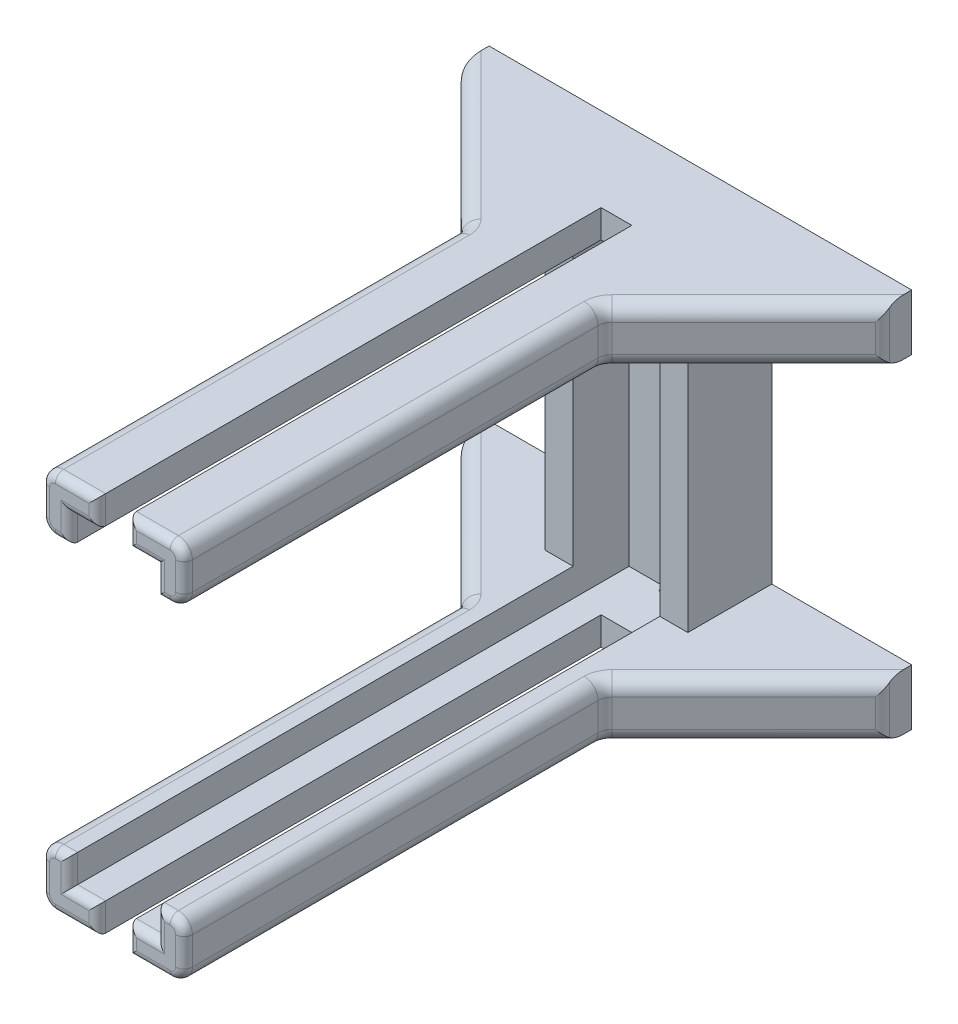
ISO-10303-21;
HEADER;
FILE_DESCRIPTION(('STEP AP214'),'2;1');
FILE_NAME('part.step','',(''),(''),'','','');
FILE_SCHEMA(('AUTOMOTIVE_DESIGN { 1 0 10303 214 1 1 1 1 }'));
ENDSEC;
DATA;
#1=APPLICATION_CONTEXT('core data for automotive mechanical design processes');
#2=APPLICATION_PROTOCOL_DEFINITION('international standard','automotive_design',2000,#1);
#3=PRODUCT_CONTEXT('',#1,'mechanical');
#4=PRODUCT('Part','Part','',(#3));
#5=PRODUCT_RELATED_PRODUCT_CATEGORY('part','',(#4));
#6=PRODUCT_DEFINITION_FORMATION('','',#4);
#7=PRODUCT_DEFINITION_CONTEXT('part definition',#1,'design');
#8=PRODUCT_DEFINITION('design','',#6,#7);
#9=PRODUCT_DEFINITION_SHAPE('','',#8);
#10=(LENGTH_UNIT() NAMED_UNIT(*) SI_UNIT(.MILLI.,.METRE.));
#11=(NAMED_UNIT(*) PLANE_ANGLE_UNIT() SI_UNIT($,.RADIAN.));
#12=(NAMED_UNIT(*) SI_UNIT($,.STERADIAN.) SOLID_ANGLE_UNIT());
#13=UNCERTAINTY_MEASURE_WITH_UNIT(LENGTH_MEASURE(1.E-05),#10,'distance_accuracy_value','');
#14=(GEOMETRIC_REPRESENTATION_CONTEXT(3) GLOBAL_UNCERTAINTY_ASSIGNED_CONTEXT((#13)) GLOBAL_UNIT_ASSIGNED_CONTEXT((#10,
#11,#12)) REPRESENTATION_CONTEXT('',''));
#15=CARTESIAN_POINT('',(0.,0.,0.));
#16=DIRECTION('',(0.,0.,1.));
#17=DIRECTION('',(1.,0.,0.));
#18=AXIS2_PLACEMENT_3D('',#15,#16,#17);
#19=CARTESIAN_POINT('',(-25.5,-68.,30.));
#20=DIRECTION('',(1.,0.,0.));
#21=DIRECTION('',(0.,0.,-1.));
#22=AXIS2_PLACEMENT_3D('',#19,#20,#21);
#23=PLANE('',#22);
#24=DIRECTION('',(0.,-1.,0.));
#25=VECTOR('',#24,1.);
#26=CARTESIAN_POINT('',(-25.5,-68.,0.));
#27=LINE('',#26,#25);
#28=CARTESIAN_POINT('',(-25.5,48.,0.));
#29=VERTEX_POINT('',#28);
#30=CARTESIAN_POINT('',(-25.5,-48.,0.));
#31=VERTEX_POINT('',#30);
#32=EDGE_CURVE('E889',#29,#31,#27,.T.);
#33=ORIENTED_EDGE('',*,*,#32,.T.);
#34=DIRECTION('',(0.,0.,1.));
#35=VECTOR('',#34,1.);
#36=CARTESIAN_POINT('',(-25.5,-48.,0.));
#37=LINE('',#36,#35);
#38=CARTESIAN_POINT('',(-25.5,-48.,30.));
#39=VERTEX_POINT('',#38);
#40=EDGE_CURVE('E687',#31,#39,#37,.T.);
#41=ORIENTED_EDGE('',*,*,#40,.T.);
#42=DIRECTION('',(0.,-1.,0.));
#43=VECTOR('',#42,1.);
#44=CARTESIAN_POINT('',(-25.5,-68.,30.));
#45=LINE('',#44,#43);
#46=CARTESIAN_POINT('',(-25.5,48.,30.));
#47=VERTEX_POINT('',#46);
#48=EDGE_CURVE('E875',#47,#39,#45,.T.);
#49=ORIENTED_EDGE('',*,*,#48,.F.);
#50=DIRECTION('',(0.,0.,-1.));
#51=VECTOR('',#50,1.);
#52=CARTESIAN_POINT('',(-25.5,48.,30.));
#53=LINE('',#52,#51);
#54=EDGE_CURVE('E714',#47,#29,#53,.T.);
#55=ORIENTED_EDGE('',*,*,#54,.T.);
#56=EDGE_LOOP('',(#33,#41,#49,#55));
#57=FACE_BOUND('',#56,.T.);
#58=ADVANCED_FACE('F49',(#57),#23,.F.);
#59=DIRECTION('',(0.,0.,-1.));
#60=VECTOR('',#59,1.);
#61=CARTESIAN_POINT('',(-25.5,53.,30.));
#62=LINE('',#61,#60);
#63=CARTESIAN_POINT('',(-25.5,53.,62.0710678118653));
#64=VERTEX_POINT('',#63);
#65=CARTESIAN_POINT('',(-25.5,53.,207.));
#66=VERTEX_POINT('',#65);
#67=EDGE_CURVE('E1259',#64,#66,#62,.F.);
#68=ORIENTED_EDGE('',*,*,#67,.T.);
#69=DIRECTION('',(0.,-1.,0.));
#70=VECTOR('',#69,1.);
#71=CARTESIAN_POINT('',(-25.5,-68.,207.));
#72=LINE('',#71,#70);
#73=CARTESIAN_POINT('',(-25.5,63.,207.));
#74=VERTEX_POINT('',#73);
#75=EDGE_CURVE('E1438',#66,#74,#72,.F.);
#76=ORIENTED_EDGE('',*,*,#75,.T.);
#77=DIRECTION('',(0.,0.,-1.));
#78=VECTOR('',#77,1.);
#79=CARTESIAN_POINT('',(-25.5,63.,30.));
#80=LINE('',#79,#78);
#81=CARTESIAN_POINT('',(-25.5,63.,62.0710678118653));
#82=VERTEX_POINT('',#81);
#83=EDGE_CURVE('E1263',#74,#82,#80,.T.);
#84=ORIENTED_EDGE('',*,*,#83,.T.);
#85=DIRECTION('',(0.,1.,0.));
#86=VECTOR('',#85,1.);
#87=CARTESIAN_POINT('',(-25.5,-68.,62.0710678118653));
#88=LINE('',#87,#86);
#89=EDGE_CURVE('E1256',#82,#64,#88,.F.);
#90=ORIENTED_EDGE('',*,*,#89,.T.);
#91=EDGE_LOOP('',(#68,#76,#84,#90));
#92=FACE_BOUND('',#91,.T.);
#93=ADVANCED_FACE('F1624',(#92),#23,.F.);
#94=CARTESIAN_POINT('',(25.5,-68.,30.));
#95=DIRECTION('',(-1.,0.,0.));
#96=DIRECTION('',(0.,0.,1.));
#97=AXIS2_PLACEMENT_3D('',#94,#95,#96);
#98=PLANE('',#97);
#99=DIRECTION('',(0.,0.,-1.));
#100=VECTOR('',#99,1.);
#101=CARTESIAN_POINT('',(25.5,-53.,30.));
#102=LINE('',#101,#100);
#103=CARTESIAN_POINT('',(25.5,-53.,62.0710678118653));
#104=VERTEX_POINT('',#103);
#105=CARTESIAN_POINT('',(25.5,-53.,207.));
#106=VERTEX_POINT('',#105);
#107=EDGE_CURVE('E932',#104,#106,#102,.F.);
#108=ORIENTED_EDGE('',*,*,#107,.T.);
#109=DIRECTION('',(0.,1.,0.));
#110=VECTOR('',#109,1.);
#111=CARTESIAN_POINT('',(25.5,-68.,207.));
#112=LINE('',#111,#110);
#113=CARTESIAN_POINT('',(25.5,-63.,207.));
#114=VERTEX_POINT('',#113);
#115=EDGE_CURVE('E1107',#106,#114,#112,.F.);
#116=ORIENTED_EDGE('',*,*,#115,.T.);
#117=DIRECTION('',(0.,0.,-1.));
#118=VECTOR('',#117,1.);
#119=CARTESIAN_POINT('',(25.5,-63.,30.));
#120=LINE('',#119,#118);
#121=CARTESIAN_POINT('',(25.5,-63.,62.0710678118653));
#122=VERTEX_POINT('',#121);
#123=EDGE_CURVE('E936',#114,#122,#120,.T.);
#124=ORIENTED_EDGE('',*,*,#123,.T.);
#125=DIRECTION('',(0.,-1.,0.));
#126=VECTOR('',#125,1.);
#127=CARTESIAN_POINT('',(25.5,-68.,62.0710678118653));
#128=LINE('',#127,#126);
#129=EDGE_CURVE('E929',#122,#104,#128,.F.);
#130=ORIENTED_EDGE('',*,*,#129,.T.);
#131=EDGE_LOOP('',(#108,#116,#124,#130));
#132=FACE_BOUND('',#131,.T.);
#133=ADVANCED_FACE('F1816',(#132),#98,.F.);
#134=DIRECTION('',(0.,0.,1.));
#135=VECTOR('',#134,1.);
#136=CARTESIAN_POINT('',(25.5,-48.,30.));
#137=LINE('',#136,#135);
#138=CARTESIAN_POINT('',(25.5,-48.,0.));
#139=VERTEX_POINT('',#138);
#140=CARTESIAN_POINT('',(25.5,-48.,30.));
#141=VERTEX_POINT('',#140);
#142=EDGE_CURVE('E726',#139,#141,#137,.T.);
#143=ORIENTED_EDGE('',*,*,#142,.F.);
#144=DIRECTION('',(0.,1.,0.));
#145=VECTOR('',#144,1.);
#146=CARTESIAN_POINT('',(25.5,-68.,0.));
#147=LINE('',#146,#145);
#148=CARTESIAN_POINT('',(25.5,48.,0.));
#149=VERTEX_POINT('',#148);
#150=EDGE_CURVE('E876',#139,#149,#147,.T.);
#151=ORIENTED_EDGE('',*,*,#150,.T.);
#152=DIRECTION('',(0.,0.,-1.));
#153=VECTOR('',#152,1.);
#154=CARTESIAN_POINT('',(25.5,48.,30.));
#155=LINE('',#154,#153);
#156=CARTESIAN_POINT('',(25.5,48.,30.));
#157=VERTEX_POINT('',#156);
#158=EDGE_CURVE('E719',#157,#149,#155,.T.);
#159=ORIENTED_EDGE('',*,*,#158,.F.);
#160=DIRECTION('',(0.,1.,0.));
#161=VECTOR('',#160,1.);
#162=CARTESIAN_POINT('',(25.5,-68.,30.));
#163=LINE('',#162,#161);
#164=EDGE_CURVE('E747',#141,#157,#163,.T.);
#165=ORIENTED_EDGE('',*,*,#164,.F.);
#166=EDGE_LOOP('',(#143,#151,#159,#165));
#167=FACE_BOUND('',#166,.T.);
#168=ADVANCED_FACE('F1837',(#167),#98,.F.);
#169=DIRECTION('',(0.,0.,-1.));
#170=VECTOR('',#169,1.);
#171=CARTESIAN_POINT('',(25.5,63.,30.));
#172=LINE('',#171,#170);
#173=CARTESIAN_POINT('',(25.5,63.,62.0710678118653));
#174=VERTEX_POINT('',#173);
#175=CARTESIAN_POINT('',(25.5,63.,207.));
#176=VERTEX_POINT('',#175);
#177=EDGE_CURVE('E914',#174,#176,#172,.F.);
#178=ORIENTED_EDGE('',*,*,#177,.T.);
#179=DIRECTION('',(0.,1.,0.));
#180=VECTOR('',#179,1.);
#181=CARTESIAN_POINT('',(25.5,53.,207.));
#182=LINE('',#181,#180);
#183=CARTESIAN_POINT('',(25.5,53.,207.));
#184=VERTEX_POINT('',#183);
#185=EDGE_CURVE('E1193',#176,#184,#182,.F.);
#186=ORIENTED_EDGE('',*,*,#185,.T.);
#187=DIRECTION('',(0.,0.,-1.));
#188=VECTOR('',#187,1.);
#189=CARTESIAN_POINT('',(25.5,53.,30.));
#190=LINE('',#189,#188);
#191=CARTESIAN_POINT('',(25.5,53.,62.0710678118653));
#192=VERTEX_POINT('',#191);
#193=EDGE_CURVE('E911',#184,#192,#190,.T.);
#194=ORIENTED_EDGE('',*,*,#193,.T.);
#195=DIRECTION('',(0.,-1.,0.));
#196=VECTOR('',#195,1.);
#197=CARTESIAN_POINT('',(25.5,-68.,62.0710678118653));
#198=LINE('',#197,#196);
#199=EDGE_CURVE('E908',#192,#174,#198,.F.);
#200=ORIENTED_EDGE('',*,*,#199,.T.);
#201=EDGE_LOOP('',(#178,#186,#194,#200));
#202=FACE_BOUND('',#201,.T.);
#203=ADVANCED_FACE('F1936',(#202),#98,.F.);
#204=CARTESIAN_POINT('',(0.,0.,30.));
#205=DIRECTION('',(0.,0.,-1.));
#206=DIRECTION('',(-1.,0.,0.));
#207=AXIS2_PLACEMENT_3D('',#204,#205,#206);
#208=PLANE('',#207);
#209=DIRECTION('',(0.,1.,0.));
#210=VECTOR('',#209,1.);
#211=CARTESIAN_POINT('',(-5.49999999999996,68.,30.));
#212=LINE('',#211,#210);
#213=CARTESIAN_POINT('',(-5.49999999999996,58.,30.));
#214=VERTEX_POINT('',#213);
#215=CARTESIAN_POINT('',(-5.49999999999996,68.,30.));
#216=VERTEX_POINT('',#215);
#217=EDGE_CURVE('E780',#214,#216,#212,.T.);
#218=ORIENTED_EDGE('',*,*,#217,.F.);
#219=DIRECTION('',(-1.,0.,0.));
#220=VECTOR('',#219,1.);
#221=CARTESIAN_POINT('',(15.5,58.,30.));
#222=LINE('',#221,#220);
#223=CARTESIAN_POINT('',(5.50000000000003,58.,30.));
#224=VERTEX_POINT('',#223);
#225=EDGE_CURVE('E841',#224,#214,#222,.T.);
#226=ORIENTED_EDGE('',*,*,#225,.F.);
#227=DIRECTION('',(0.,-1.,0.));
#228=VECTOR('',#227,1.);
#229=CARTESIAN_POINT('',(5.50000000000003,68.,30.));
#230=LINE('',#229,#228);
#231=CARTESIAN_POINT('',(5.50000000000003,68.,30.));
#232=VERTEX_POINT('',#231);
#233=EDGE_CURVE('E761',#232,#224,#230,.T.);
#234=ORIENTED_EDGE('',*,*,#233,.F.);
#235=DIRECTION('',(-1.,0.,0.));
#236=VECTOR('',#235,1.);
#237=CARTESIAN_POINT('',(25.5,68.,30.));
#238=LINE('',#237,#236);
#239=EDGE_CURVE('E871',#232,#216,#238,.T.);
#240=ORIENTED_EDGE('',*,*,#239,.T.);
#241=EDGE_LOOP('',(#218,#226,#234,#240));
#242=FACE_BOUND('',#241,.T.);
#243=ADVANCED_FACE('F1934',(#242),#208,.F.);
#244=DIRECTION('',(1.,0.,0.));
#245=VECTOR('',#244,1.);
#246=CARTESIAN_POINT('',(-25.5,48.,30.));
#247=LINE('',#246,#245);
#248=CARTESIAN_POINT('',(-15.5,48.,30.));
#249=VERTEX_POINT('',#248);
#250=EDGE_CURVE('E801',#47,#249,#247,.T.);
#251=ORIENTED_EDGE('',*,*,#250,.F.);
#252=ORIENTED_EDGE('',*,*,#48,.T.);
#253=DIRECTION('',(-1.,0.,0.));
#254=VECTOR('',#253,1.);
#255=CARTESIAN_POINT('',(-25.5,-48.,30.));
#256=LINE('',#255,#254);
#257=CARTESIAN_POINT('',(-15.5,-48.,30.));
#258=VERTEX_POINT('',#257);
#259=EDGE_CURVE('E811',#258,#39,#256,.T.);
#260=ORIENTED_EDGE('',*,*,#259,.F.);
#261=DIRECTION('',(0.,-1.,0.));
#262=VECTOR('',#261,1.);
#263=CARTESIAN_POINT('',(-15.5,-58.,30.));
#264=LINE('',#263,#262);
#265=EDGE_CURVE('E845',#249,#258,#264,.T.);
#266=ORIENTED_EDGE('',*,*,#265,.F.);
#267=EDGE_LOOP('',(#251,#252,#260,#266));
#268=FACE_BOUND('',#267,.T.);
#269=ADVANCED_FACE('F1666',(#268),#208,.F.);
#270=DIRECTION('',(1.,0.,0.));
#271=VECTOR('',#270,1.);
#272=CARTESIAN_POINT('',(25.5,48.,30.));
#273=LINE('',#272,#271);
#274=CARTESIAN_POINT('',(15.5,48.,30.));
#275=VERTEX_POINT('',#274);
#276=EDGE_CURVE('E786',#275,#157,#273,.T.);
#277=ORIENTED_EDGE('',*,*,#276,.F.);
#278=DIRECTION('',(0.,1.,0.));
#279=VECTOR('',#278,1.);
#280=CARTESIAN_POINT('',(15.5,-58.,30.));
#281=LINE('',#280,#279);
#282=CARTESIAN_POINT('',(15.5,-48.,30.));
#283=VERTEX_POINT('',#282);
#284=EDGE_CURVE('E853',#283,#275,#281,.T.);
#285=ORIENTED_EDGE('',*,*,#284,.F.);
#286=DIRECTION('',(-1.,0.,0.));
#287=VECTOR('',#286,1.);
#288=CARTESIAN_POINT('',(25.5,-48.,30.));
#289=LINE('',#288,#287);
#290=EDGE_CURVE('E767',#141,#283,#289,.T.);
#291=ORIENTED_EDGE('',*,*,#290,.F.);
#292=ORIENTED_EDGE('',*,*,#164,.T.);
#293=EDGE_LOOP('',(#277,#285,#291,#292));
#294=FACE_BOUND('',#293,.T.);
#295=ADVANCED_FACE('F1846',(#294),#208,.F.);
#296=DIRECTION('',(0.,-1.,0.));
#297=VECTOR('',#296,1.);
#298=CARTESIAN_POINT('',(5.5,-68.,30.));
#299=LINE('',#298,#297);
#300=CARTESIAN_POINT('',(5.5,-58.,30.));
#301=VERTEX_POINT('',#300);
#302=CARTESIAN_POINT('',(5.5,-68.,30.));
#303=VERTEX_POINT('',#302);
#304=EDGE_CURVE('E771',#301,#303,#299,.T.);
#305=ORIENTED_EDGE('',*,*,#304,.F.);
#306=DIRECTION('',(1.,0.,0.));
#307=VECTOR('',#306,1.);
#308=CARTESIAN_POINT('',(15.5,-58.,30.));
#309=LINE('',#308,#307);
#310=CARTESIAN_POINT('',(-5.5,-58.,30.));
#311=VERTEX_POINT('',#310);
#312=EDGE_CURVE('E849',#311,#301,#309,.T.);
#313=ORIENTED_EDGE('',*,*,#312,.F.);
#314=DIRECTION('',(0.,1.,0.));
#315=VECTOR('',#314,1.);
#316=CARTESIAN_POINT('',(-5.5,-68.,30.));
#317=LINE('',#316,#315);
#318=CARTESIAN_POINT('',(-5.5,-68.,30.));
#319=VERTEX_POINT('',#318);
#320=EDGE_CURVE('E775',#319,#311,#317,.T.);
#321=ORIENTED_EDGE('',*,*,#320,.F.);
#322=DIRECTION('',(1.,0.,0.));
#323=VECTOR('',#322,1.);
#324=CARTESIAN_POINT('',(25.5,-68.,30.));
#325=LINE('',#324,#323);
#326=EDGE_CURVE('E880',#319,#303,#325,.T.);
#327=ORIENTED_EDGE('',*,*,#326,.T.);
#328=EDGE_LOOP('',(#305,#313,#321,#327));
#329=FACE_BOUND('',#328,.T.);
#330=ADVANCED_FACE('F1938',(#329),#208,.F.);
#331=CARTESIAN_POINT('',(15.5,58.,30.));
#332=DIRECTION('',(0.,-1.,0.));
#333=DIRECTION('',(0.,0.,-1.));
#334=AXIS2_PLACEMENT_3D('',#331,#332,#333);
#335=PLANE('',#334);
#336=DIRECTION('',(0.,0.,-1.));
#337=VECTOR('',#336,1.);
#338=CARTESIAN_POINT('',(-5.49999999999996,58.,210.));
#339=LINE('',#338,#337);
#340=CARTESIAN_POINT('',(-5.49999999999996,58.,207.));
#341=VERTEX_POINT('',#340);
#342=EDGE_CURVE('E798',#341,#214,#339,.T.);
#343=ORIENTED_EDGE('',*,*,#342,.F.);
#344=DIRECTION('',(1.,0.,0.));
#345=VECTOR('',#344,1.);
#346=CARTESIAN_POINT('',(-15.5,58.,207.));
#347=LINE('',#346,#345);
#348=CARTESIAN_POINT('',(-15.5,58.,207.));
#349=VERTEX_POINT('',#348);
#350=EDGE_CURVE('E1422',#341,#349,#347,.F.);
#351=ORIENTED_EDGE('',*,*,#350,.T.);
#352=DIRECTION('',(0.,0.,-1.));
#353=VECTOR('',#352,1.);
#354=CARTESIAN_POINT('',(-15.5,58.,30.));
#355=LINE('',#354,#353);
#356=CARTESIAN_POINT('',(-15.5,58.,10.));
#357=VERTEX_POINT('',#356);
#358=EDGE_CURVE('E867',#349,#357,#355,.T.);
#359=ORIENTED_EDGE('',*,*,#358,.T.);
#360=DIRECTION('',(-1.,0.,0.));
#361=VECTOR('',#360,1.);
#362=CARTESIAN_POINT('',(15.5,58.,10.));
#363=LINE('',#362,#361);
#364=CARTESIAN_POINT('',(15.5,58.,10.));
#365=VERTEX_POINT('',#364);
#366=EDGE_CURVE('E824',#365,#357,#363,.T.);
#367=ORIENTED_EDGE('',*,*,#366,.F.);
#368=DIRECTION('',(0.,0.,-1.));
#369=VECTOR('',#368,1.);
#370=CARTESIAN_POINT('',(15.5,58.,30.));
#371=LINE('',#370,#369);
#372=CARTESIAN_POINT('',(15.5,58.,207.));
#373=VERTEX_POINT('',#372);
#374=EDGE_CURVE('E857',#373,#365,#371,.T.);
#375=ORIENTED_EDGE('',*,*,#374,.F.);
#376=DIRECTION('',(1.,0.,0.));
#377=VECTOR('',#376,1.);
#378=CARTESIAN_POINT('',(15.5,58.,207.));
#379=LINE('',#378,#377);
#380=CARTESIAN_POINT('',(5.50000000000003,58.,207.));
#381=VERTEX_POINT('',#380);
#382=EDGE_CURVE('E1181',#373,#381,#379,.F.);
#383=ORIENTED_EDGE('',*,*,#382,.T.);
#384=DIRECTION('',(0.,0.,-1.));
#385=VECTOR('',#384,1.);
#386=CARTESIAN_POINT('',(5.50000000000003,58.,210.));
#387=LINE('',#386,#385);
#388=EDGE_CURVE('E779',#381,#224,#387,.T.);
#389=ORIENTED_EDGE('',*,*,#388,.T.);
#390=ORIENTED_EDGE('',*,*,#225,.T.);
#391=EDGE_LOOP('',(#343,#351,#359,#367,#375,#383,#389,#390));
#392=FACE_BOUND('',#391,.T.);
#393=ADVANCED_FACE('F1582',(#392),#335,.T.);
#394=CARTESIAN_POINT('',(-15.5,-58.,30.));
#395=DIRECTION('',(1.,0.,0.));
#396=DIRECTION('',(0.,0.,-1.));
#397=AXIS2_PLACEMENT_3D('',#394,#395,#396);
#398=PLANE('',#397);
#399=ORIENTED_EDGE('',*,*,#358,.F.);
#400=DIRECTION('',(0.,1.,0.));
#401=VECTOR('',#400,1.);
#402=CARTESIAN_POINT('',(-15.5,48.,207.));
#403=LINE('',#402,#401);
#404=CARTESIAN_POINT('',(-15.5,48.,207.));
#405=VERTEX_POINT('',#404);
#406=EDGE_CURVE('E1429',#349,#405,#403,.F.);
#407=ORIENTED_EDGE('',*,*,#406,.T.);
#408=DIRECTION('',(0.,0.,-1.));
#409=VECTOR('',#408,1.);
#410=CARTESIAN_POINT('',(-15.5,48.,210.));
#411=LINE('',#410,#409);
#412=EDGE_CURVE('E795',#405,#249,#411,.T.);
#413=ORIENTED_EDGE('',*,*,#412,.T.);
#414=ORIENTED_EDGE('',*,*,#265,.T.);
#415=DIRECTION('',(0.,0.,-1.));
#416=VECTOR('',#415,1.);
#417=CARTESIAN_POINT('',(-15.5,-48.,210.));
#418=LINE('',#417,#416);
#419=CARTESIAN_POINT('',(-15.5,-48.,207.));
#420=VERTEX_POINT('',#419);
#421=EDGE_CURVE('E815',#420,#258,#418,.T.);
#422=ORIENTED_EDGE('',*,*,#421,.F.);
#423=DIRECTION('',(0.,1.,0.));
#424=VECTOR('',#423,1.);
#425=CARTESIAN_POINT('',(-15.5,-58.,207.));
#426=LINE('',#425,#424);
#427=CARTESIAN_POINT('',(-15.5,-58.,207.));
#428=VERTEX_POINT('',#427);
#429=EDGE_CURVE('E1425',#420,#428,#426,.F.);
#430=ORIENTED_EDGE('',*,*,#429,.T.);
#431=DIRECTION('',(0.,0.,-1.));
#432=VECTOR('',#431,1.);
#433=CARTESIAN_POINT('',(-15.5,-58.,30.));
#434=LINE('',#433,#432);
#435=CARTESIAN_POINT('',(-15.5,-58.,10.));
#436=VERTEX_POINT('',#435);
#437=EDGE_CURVE('E864',#428,#436,#434,.T.);
#438=ORIENTED_EDGE('',*,*,#437,.T.);
#439=DIRECTION('',(0.,-1.,0.));
#440=VECTOR('',#439,1.);
#441=CARTESIAN_POINT('',(-15.5,-58.,10.));
#442=LINE('',#441,#440);
#443=EDGE_CURVE('E828',#357,#436,#442,.T.);
#444=ORIENTED_EDGE('',*,*,#443,.F.);
#445=EDGE_LOOP('',(#399,#407,#413,#414,#422,#430,#438,#444));
#446=FACE_BOUND('',#445,.T.);
#447=ADVANCED_FACE('F1576',(#446),#398,.T.);
#448=CARTESIAN_POINT('',(15.5,-58.,30.));
#449=DIRECTION('',(0.,1.,0.));
#450=DIRECTION('',(0.,0.,1.));
#451=AXIS2_PLACEMENT_3D('',#448,#449,#450);
#452=PLANE('',#451);
#453=DIRECTION('',(0.,0.,-1.));
#454=VECTOR('',#453,1.);
#455=CARTESIAN_POINT('',(2.74999999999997,-58.,0.));
#456=LINE('',#455,#454);
#457=CARTESIAN_POINT('',(2.74999999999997,-58.,12.));
#458=VERTEX_POINT('',#457);
#459=CARTESIAN_POINT('',(2.74999999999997,-58.,10.));
#460=VERTEX_POINT('',#459);
#461=EDGE_CURVE('E65',#458,#460,#456,.T.);
#462=ORIENTED_EDGE('',*,*,#461,.F.);
#463=DIRECTION('',(0.857167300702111,0.,-0.515038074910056));
#464=VECTOR('',#463,1.);
#465=CARTESIAN_POINT('',(0.,-58.,13.6523667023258));
#466=LINE('',#465,#464);
#467=CARTESIAN_POINT('',(0.,-58.,13.6523667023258));
#468=VERTEX_POINT('',#467);
#469=EDGE_CURVE('E11',#468,#458,#466,.T.);
#470=ORIENTED_EDGE('',*,*,#469,.F.);
#471=DIRECTION('',(0.857167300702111,0.,0.515038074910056));
#472=VECTOR('',#471,1.);
#473=CARTESIAN_POINT('',(0.,-58.,13.6523667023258));
#474=LINE('',#473,#472);
#475=CARTESIAN_POINT('',(-2.74999999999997,-58.,12.));
#476=VERTEX_POINT('',#475);
#477=EDGE_CURVE('E58',#476,#468,#474,.T.);
#478=ORIENTED_EDGE('',*,*,#477,.F.);
#479=DIRECTION('',(0.,0.,-1.));
#480=VECTOR('',#479,1.);
#481=CARTESIAN_POINT('',(-2.74999999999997,-58.,0.));
#482=LINE('',#481,#480);
#483=CARTESIAN_POINT('',(-2.74999999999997,-58.,10.));
#484=VERTEX_POINT('',#483);
#485=EDGE_CURVE('E605',#484,#476,#482,.F.);
#486=ORIENTED_EDGE('',*,*,#485,.F.);
#487=DIRECTION('',(1.,0.,0.));
#488=VECTOR('',#487,1.);
#489=CARTESIAN_POINT('',(15.5,-58.,10.));
#490=LINE('',#489,#488);
#491=EDGE_CURVE('E833',#436,#484,#490,.T.);
#492=ORIENTED_EDGE('',*,*,#491,.F.);
#493=ORIENTED_EDGE('',*,*,#437,.F.);
#494=DIRECTION('',(-1.,0.,0.));
#495=VECTOR('',#494,1.);
#496=CARTESIAN_POINT('',(15.5,-58.,207.));
#497=LINE('',#496,#495);
#498=CARTESIAN_POINT('',(-5.5,-58.,207.));
#499=VERTEX_POINT('',#498);
#500=EDGE_CURVE('E1472',#428,#499,#497,.F.);
#501=ORIENTED_EDGE('',*,*,#500,.T.);
#502=DIRECTION('',(0.,0.,-1.));
#503=VECTOR('',#502,1.);
#504=CARTESIAN_POINT('',(-5.5,-58.,210.));
#505=LINE('',#504,#503);
#506=EDGE_CURVE('E818',#499,#311,#505,.T.);
#507=ORIENTED_EDGE('',*,*,#506,.T.);
#508=ORIENTED_EDGE('',*,*,#312,.T.);
#509=DIRECTION('',(0.,0.,-1.));
#510=VECTOR('',#509,1.);
#511=CARTESIAN_POINT('',(5.5,-58.,210.));
#512=LINE('',#511,#510);
#513=CARTESIAN_POINT('',(5.5,-58.,207.));
#514=VERTEX_POINT('',#513);
#515=EDGE_CURVE('E764',#514,#301,#512,.T.);
#516=ORIENTED_EDGE('',*,*,#515,.F.);
#517=DIRECTION('',(-1.,0.,0.));
#518=VECTOR('',#517,1.);
#519=CARTESIAN_POINT('',(15.5,-58.,207.));
#520=LINE('',#519,#518);
#521=CARTESIAN_POINT('',(15.5,-58.,207.));
#522=VERTEX_POINT('',#521);
#523=EDGE_CURVE('E1095',#514,#522,#520,.F.);
#524=ORIENTED_EDGE('',*,*,#523,.T.);
#525=DIRECTION('',(0.,0.,-1.));
#526=VECTOR('',#525,1.);
#527=CARTESIAN_POINT('',(15.5,-58.,30.));
#528=LINE('',#527,#526);
#529=CARTESIAN_POINT('',(15.5,-58.,10.));
#530=VERTEX_POINT('',#529);
#531=EDGE_CURVE('E860',#522,#530,#528,.T.);
#532=ORIENTED_EDGE('',*,*,#531,.T.);
#533=EDGE_CURVE('E832',#460,#530,#490,.T.);
#534=ORIENTED_EDGE('',*,*,#533,.F.);
#535=EDGE_LOOP('',(#462,#470,#478,#486,#492,#493,#501,#507,#508,#516,#524,#532,#534));
#536=FACE_BOUND('',#535,.T.);
#537=ADVANCED_FACE('F1559',(#536),#452,.T.);
#538=CARTESIAN_POINT('',(15.5,-58.,30.));
#539=DIRECTION('',(-1.,0.,0.));
#540=DIRECTION('',(0.,0.,1.));
#541=AXIS2_PLACEMENT_3D('',#538,#539,#540);
#542=PLANE('',#541);
#543=DIRECTION('',(0.,0.,-1.));
#544=VECTOR('',#543,1.);
#545=CARTESIAN_POINT('',(15.5,48.,210.));
#546=LINE('',#545,#544);
#547=CARTESIAN_POINT('',(15.5,48.,207.));
#548=VERTEX_POINT('',#547);
#549=EDGE_CURVE('E783',#548,#275,#546,.T.);
#550=ORIENTED_EDGE('',*,*,#549,.F.);
#551=DIRECTION('',(0.,-1.,0.));
#552=VECTOR('',#551,1.);
#553=CARTESIAN_POINT('',(15.5,-58.,207.));
#554=LINE('',#553,#552);
#555=EDGE_CURVE('E1178',#548,#373,#554,.F.);
#556=ORIENTED_EDGE('',*,*,#555,.T.);
#557=ORIENTED_EDGE('',*,*,#374,.T.);
#558=DIRECTION('',(0.,1.,0.));
#559=VECTOR('',#558,1.);
#560=CARTESIAN_POINT('',(15.5,-58.,10.));
#561=LINE('',#560,#559);
#562=EDGE_CURVE('E837',#530,#365,#561,.T.);
#563=ORIENTED_EDGE('',*,*,#562,.F.);
#564=ORIENTED_EDGE('',*,*,#531,.F.);
#565=DIRECTION('',(0.,-1.,0.));
#566=VECTOR('',#565,1.);
#567=CARTESIAN_POINT('',(15.5,-48.,207.));
#568=LINE('',#567,#566);
#569=CARTESIAN_POINT('',(15.5,-48.,207.));
#570=VERTEX_POINT('',#569);
#571=EDGE_CURVE('E1098',#522,#570,#568,.F.);
#572=ORIENTED_EDGE('',*,*,#571,.T.);
#573=DIRECTION('',(0.,0.,-1.));
#574=VECTOR('',#573,1.);
#575=CARTESIAN_POINT('',(15.5,-48.,210.));
#576=LINE('',#575,#574);
#577=EDGE_CURVE('E760',#570,#283,#576,.T.);
#578=ORIENTED_EDGE('',*,*,#577,.T.);
#579=ORIENTED_EDGE('',*,*,#284,.T.);
#580=EDGE_LOOP('',(#550,#556,#557,#563,#564,#572,#578,#579));
#581=FACE_BOUND('',#580,.T.);
#582=ADVANCED_FACE('F1788',(#581),#542,.T.);
#583=CARTESIAN_POINT('',(0.,0.,0.));
#584=DIRECTION('',(0.,0.,-1.));
#585=DIRECTION('',(-1.,0.,0.));
#586=AXIS2_PLACEMENT_3D('',#583,#584,#585);
#587=PLANE('',#586);
#588=CARTESIAN_POINT('',(-60.5,-58.,0.));
#589=DIRECTION('',(0.,0.,-1.));
#590=DIRECTION('',(-1.,0.,0.));
#591=AXIS2_PLACEMENT_3D('',#588,#589,#590);
#592=CIRCLE('',#591,5.2);
#593=CARTESIAN_POINT('',(-65.7,-58.,0.));
#594=VERTEX_POINT('',#593);
#595=EDGE_CURVE('E582',#594,#594,#592,.T.);
#596=ORIENTED_EDGE('',*,*,#595,.F.);
#597=EDGE_LOOP('',(#596));
#598=FACE_BOUND('',#597,.T.);
#599=CARTESIAN_POINT('',(-45.5,-58.,0.));
#600=DIRECTION('',(0.,0.,-1.));
#601=DIRECTION('',(-1.,0.,0.));
#602=AXIS2_PLACEMENT_3D('',#599,#600,#601);
#603=CIRCLE('',#602,5.2);
#604=CARTESIAN_POINT('',(-50.7,-58.,0.));
#605=VERTEX_POINT('',#604);
#606=EDGE_CURVE('E573',#605,#605,#603,.T.);
#607=ORIENTED_EDGE('',*,*,#606,.F.);
#608=EDGE_LOOP('',(#607));
#609=FACE_BOUND('',#608,.T.);
#610=CARTESIAN_POINT('',(0.,-58.,0.));
#611=DIRECTION('',(0.,0.,-1.));
#612=DIRECTION('',(-1.,0.,0.));
#613=AXIS2_PLACEMENT_3D('',#610,#611,#612);
#614=CIRCLE('',#613,5.2);
#615=CARTESIAN_POINT('',(-5.2,-58.,0.));
#616=VERTEX_POINT('',#615);
#617=EDGE_CURVE('E593',#616,#616,#614,.T.);
#618=ORIENTED_EDGE('',*,*,#617,.F.);
#619=EDGE_LOOP('',(#618));
#620=FACE_BOUND('',#619,.T.);
#621=CARTESIAN_POINT('',(45.5,-58.,0.));
#622=DIRECTION('',(0.,0.,-1.));
#623=DIRECTION('',(-1.,0.,0.));
#624=AXIS2_PLACEMENT_3D('',#621,#622,#623);
#625=CIRCLE('',#624,5.2);
#626=CARTESIAN_POINT('',(40.3,-58.,0.));
#627=VERTEX_POINT('',#626);
#628=EDGE_CURVE('E610',#627,#627,#625,.T.);
#629=ORIENTED_EDGE('',*,*,#628,.F.);
#630=EDGE_LOOP('',(#629));
#631=FACE_BOUND('',#630,.T.);
#632=CARTESIAN_POINT('',(60.5,-58.,0.));
#633=DIRECTION('',(0.,0.,-1.));
#634=DIRECTION('',(-1.,0.,0.));
#635=AXIS2_PLACEMENT_3D('',#632,#633,#634);
#636=CIRCLE('',#635,5.2);
#637=CARTESIAN_POINT('',(55.3,-58.,0.));
#638=VERTEX_POINT('',#637);
#639=EDGE_CURVE('E622',#638,#638,#636,.T.);
#640=ORIENTED_EDGE('',*,*,#639,.F.);
#641=EDGE_LOOP('',(#640));
#642=FACE_BOUND('',#641,.T.);
#643=CARTESIAN_POINT('',(60.5,58.,0.));
#644=DIRECTION('',(0.,0.,-1.));
#645=DIRECTION('',(-1.,0.,0.));
#646=AXIS2_PLACEMENT_3D('',#643,#644,#645);
#647=CIRCLE('',#646,5.2);
#648=CARTESIAN_POINT('',(55.3,58.,0.));
#649=VERTEX_POINT('',#648);
#650=EDGE_CURVE('E634',#649,#649,#647,.T.);
#651=ORIENTED_EDGE('',*,*,#650,.F.);
#652=EDGE_LOOP('',(#651));
#653=FACE_BOUND('',#652,.T.);
#654=CARTESIAN_POINT('',(45.5,58.,0.));
#655=DIRECTION('',(0.,0.,-1.));
#656=DIRECTION('',(-1.,0.,0.));
#657=AXIS2_PLACEMENT_3D('',#654,#655,#656);
#658=CIRCLE('',#657,5.2);
#659=CARTESIAN_POINT('',(40.3,58.,0.));
#660=VERTEX_POINT('',#659);
#661=EDGE_CURVE('E646',#660,#660,#658,.T.);
#662=ORIENTED_EDGE('',*,*,#661,.F.);
#663=EDGE_LOOP('',(#662));
#664=FACE_BOUND('',#663,.T.);
#665=CARTESIAN_POINT('',(-45.5,58.,0.));
#666=DIRECTION('',(0.,0.,-1.));
#667=DIRECTION('',(-1.,0.,0.));
#668=AXIS2_PLACEMENT_3D('',#665,#666,#667);
#669=CIRCLE('',#668,5.2);
#670=CARTESIAN_POINT('',(-50.7,58.,0.));
#671=VERTEX_POINT('',#670);
#672=EDGE_CURVE('E658',#671,#671,#669,.T.);
#673=ORIENTED_EDGE('',*,*,#672,.F.);
#674=EDGE_LOOP('',(#673));
#675=FACE_BOUND('',#674,.T.);
#676=CARTESIAN_POINT('',(-60.5,58.,0.));
#677=DIRECTION('',(0.,0.,-1.));
#678=DIRECTION('',(-1.,0.,0.));
#679=AXIS2_PLACEMENT_3D('',#676,#677,#678);
#680=CIRCLE('',#679,5.2);
#681=CARTESIAN_POINT('',(-65.7,58.,0.));
#682=VERTEX_POINT('',#681);
#683=EDGE_CURVE('E670',#682,#682,#680,.T.);
#684=ORIENTED_EDGE('',*,*,#683,.F.);
#685=EDGE_LOOP('',(#684));
#686=FACE_BOUND('',#685,.T.);
#687=DIRECTION('',(-1.,0.,0.));
#688=VECTOR('',#687,1.);
#689=CARTESIAN_POINT('',(25.5,68.,0.));
#690=LINE('',#689,#688);
#691=CARTESIAN_POINT('',(75.5,68.,0.));
#692=VERTEX_POINT('',#691);
#693=CARTESIAN_POINT('',(-75.5,68.,0.));
#694=VERTEX_POINT('',#693);
#695=EDGE_CURVE('E870',#692,#694,#690,.T.);
#696=ORIENTED_EDGE('',*,*,#695,.F.);
#697=DIRECTION('',(0.,1.,0.));
#698=VECTOR('',#697,1.);
#699=CARTESIAN_POINT('',(75.5,48.,0.));
#700=LINE('',#699,#698);
#701=CARTESIAN_POINT('',(75.5,48.,0.));
#702=VERTEX_POINT('',#701);
#703=EDGE_CURVE('E751',#702,#692,#700,.T.);
#704=ORIENTED_EDGE('',*,*,#703,.F.);
#705=DIRECTION('',(-1.,0.,0.));
#706=VECTOR('',#705,1.);
#707=CARTESIAN_POINT('',(75.5,48.,0.));
#708=LINE('',#707,#706);
#709=EDGE_CURVE('E701',#702,#149,#708,.T.);
#710=ORIENTED_EDGE('',*,*,#709,.T.);
#711=ORIENTED_EDGE('',*,*,#150,.F.);
#712=DIRECTION('',(-1.,0.,0.));
#713=VECTOR('',#712,1.);
#714=CARTESIAN_POINT('',(75.5,-48.,0.));
#715=LINE('',#714,#713);
#716=CARTESIAN_POINT('',(75.5,-48.,0.));
#717=VERTEX_POINT('',#716);
#718=EDGE_CURVE('E733',#717,#139,#715,.T.);
#719=ORIENTED_EDGE('',*,*,#718,.F.);
#720=DIRECTION('',(0.,1.,0.));
#721=VECTOR('',#720,1.);
#722=CARTESIAN_POINT('',(75.5,-68.,0.));
#723=LINE('',#722,#721);
#724=CARTESIAN_POINT('',(75.5,-68.,0.));
#725=VERTEX_POINT('',#724);
#726=EDGE_CURVE('E725',#725,#717,#723,.T.);
#727=ORIENTED_EDGE('',*,*,#726,.F.);
#728=DIRECTION('',(1.,0.,0.));
#729=VECTOR('',#728,1.);
#730=CARTESIAN_POINT('',(25.5,-68.,0.));
#731=LINE('',#730,#729);
#732=CARTESIAN_POINT('',(-75.5,-68.,0.));
#733=VERTEX_POINT('',#732);
#734=EDGE_CURVE('E893',#733,#725,#731,.T.);
#735=ORIENTED_EDGE('',*,*,#734,.F.);
#736=DIRECTION('',(0.,1.,0.));
#737=VECTOR('',#736,1.);
#738=CARTESIAN_POINT('',(-75.5,-68.,0.));
#739=LINE('',#738,#737);
#740=CARTESIAN_POINT('',(-75.5,-48.,0.));
#741=VERTEX_POINT('',#740);
#742=EDGE_CURVE('E691',#733,#741,#739,.T.);
#743=ORIENTED_EDGE('',*,*,#742,.T.);
#744=DIRECTION('',(1.,0.,0.));
#745=VECTOR('',#744,1.);
#746=CARTESIAN_POINT('',(-75.5,-48.,0.));
#747=LINE('',#746,#745);
#748=EDGE_CURVE('E695',#741,#31,#747,.T.);
#749=ORIENTED_EDGE('',*,*,#748,.T.);
#750=ORIENTED_EDGE('',*,*,#32,.F.);
#751=DIRECTION('',(1.,0.,0.));
#752=VECTOR('',#751,1.);
#753=CARTESIAN_POINT('',(-75.5,48.,0.));
#754=LINE('',#753,#752);
#755=CARTESIAN_POINT('',(-75.5,48.,0.));
#756=VERTEX_POINT('',#755);
#757=EDGE_CURVE('E698',#756,#29,#754,.T.);
#758=ORIENTED_EDGE('',*,*,#757,.F.);
#759=DIRECTION('',(0.,1.,0.));
#760=VECTOR('',#759,1.);
#761=CARTESIAN_POINT('',(-75.5,48.,0.));
#762=LINE('',#761,#760);
#763=EDGE_CURVE('E710',#756,#694,#762,.T.);
#764=ORIENTED_EDGE('',*,*,#763,.T.);
#765=EDGE_LOOP('',(#696,#704,#710,#711,#719,#727,#735,#743,#749,#750,#758,#764));
#766=FACE_BOUND('',#765,.T.);
#767=ADVANCED_FACE('F1658',(#598,#609,#620,#631,#642,#653,#664,#675,#686,#766),#587,.T.);
#768=CARTESIAN_POINT('',(25.5,68.,30.));
#769=DIRECTION('',(0.,-1.,0.));
#770=DIRECTION('',(0.,0.,-1.));
#771=AXIS2_PLACEMENT_3D('',#768,#769,#770);
#772=PLANE('',#771);
#773=DIRECTION('',(0.,0.,-1.));
#774=VECTOR('',#773,1.);
#775=CARTESIAN_POINT('',(-20.5,68.,30.));
#776=LINE('',#775,#774);
#777=CARTESIAN_POINT('',(-20.5,68.,62.0710678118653));
#778=VERTEX_POINT('',#777);
#779=CARTESIAN_POINT('',(-20.5,68.,207.));
#780=VERTEX_POINT('',#779);
#781=EDGE_CURVE('E1273',#778,#780,#776,.F.);
#782=ORIENTED_EDGE('',*,*,#781,.T.);
#783=DIRECTION('',(-1.,0.,0.));
#784=VECTOR('',#783,1.);
#785=CARTESIAN_POINT('',(25.5,68.,207.));
#786=LINE('',#785,#784);
#787=CARTESIAN_POINT('',(-5.49999999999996,68.,207.));
#788=VERTEX_POINT('',#787);
#789=EDGE_CURVE('E1444',#780,#788,#786,.F.);
#790=ORIENTED_EDGE('',*,*,#789,.T.);
#791=DIRECTION('',(0.,0.,-1.));
#792=VECTOR('',#791,1.);
#793=CARTESIAN_POINT('',(-5.49999999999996,68.,210.));
#794=LINE('',#793,#792);
#795=EDGE_CURVE('E739',#788,#216,#794,.T.);
#796=ORIENTED_EDGE('',*,*,#795,.T.);
#797=ORIENTED_EDGE('',*,*,#239,.F.);
#798=DIRECTION('',(0.,0.,-1.));
#799=VECTOR('',#798,1.);
#800=CARTESIAN_POINT('',(5.50000000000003,68.,210.));
#801=LINE('',#800,#799);
#802=CARTESIAN_POINT('',(5.50000000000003,68.,207.));
#803=VERTEX_POINT('',#802);
#804=EDGE_CURVE('E776',#803,#232,#801,.T.);
#805=ORIENTED_EDGE('',*,*,#804,.F.);
#806=DIRECTION('',(-1.,0.,0.));
#807=VECTOR('',#806,1.);
#808=CARTESIAN_POINT('',(20.5,68.,207.));
#809=LINE('',#808,#807);
#810=CARTESIAN_POINT('',(20.5,68.,207.));
#811=VERTEX_POINT('',#810);
#812=EDGE_CURVE('E1187',#803,#811,#809,.F.);
#813=ORIENTED_EDGE('',*,*,#812,.T.);
#814=DIRECTION('',(0.,0.,-1.));
#815=VECTOR('',#814,1.);
#816=CARTESIAN_POINT('',(20.5,68.,30.));
#817=LINE('',#816,#815);
#818=CARTESIAN_POINT('',(20.5,68.,62.0710678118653));
#819=VERTEX_POINT('',#818);
#820=EDGE_CURVE('E905',#811,#819,#817,.T.);
#821=ORIENTED_EDGE('',*,*,#820,.T.);
#822=CARTESIAN_POINT('',(30.5,68.,62.0710678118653));
#823=DIRECTION('',(0.,-1.,0.));
#824=DIRECTION('',(0.,0.,-1.));
#825=AXIS2_PLACEMENT_3D('',#822,#823,#824);
#826=CIRCLE('',#825,10.);
#827=CARTESIAN_POINT('',(23.4289321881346,68.,54.9999999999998));
#828=VERTEX_POINT('',#827);
#829=EDGE_CURVE('E901',#828,#819,#826,.F.);
#830=ORIENTED_EDGE('',*,*,#829,.F.);
#831=DIRECTION('',(0.707106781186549,0.,-0.707106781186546));
#832=VECTOR('',#831,1.);
#833=CARTESIAN_POINT('',(71.9644660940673,68.,6.46446609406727));
#834=LINE('',#833,#832);
#835=CARTESIAN_POINT('',(75.5,68.,2.92893218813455));
#836=VERTEX_POINT('',#835);
#837=EDGE_CURVE('E718',#828,#836,#834,.T.);
#838=ORIENTED_EDGE('',*,*,#837,.T.);
#839=DIRECTION('',(0.,0.,1.));
#840=VECTOR('',#839,1.);
#841=CARTESIAN_POINT('',(75.5,68.,0.));
#842=LINE('',#841,#840);
#843=EDGE_CURVE('E743',#692,#836,#842,.T.);
#844=ORIENTED_EDGE('',*,*,#843,.F.);
#845=ORIENTED_EDGE('',*,*,#695,.T.);
#846=DIRECTION('',(0.,0.,1.));
#847=VECTOR('',#846,1.);
#848=CARTESIAN_POINT('',(-75.5,68.,0.));
#849=LINE('',#848,#847);
#850=CARTESIAN_POINT('',(-75.5,68.,2.92893218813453));
#851=VERTEX_POINT('',#850);
#852=EDGE_CURVE('E705',#694,#851,#849,.T.);
#853=ORIENTED_EDGE('',*,*,#852,.T.);
#854=DIRECTION('',(-0.707106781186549,0.,-0.707106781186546));
#855=VECTOR('',#854,1.);
#856=CARTESIAN_POINT('',(-21.9644660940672,68.,56.4644660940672));
#857=LINE('',#856,#855);
#858=CARTESIAN_POINT('',(-23.4289321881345,68.,54.9999999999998));
#859=VERTEX_POINT('',#858);
#860=EDGE_CURVE('E1270',#851,#859,#857,.F.);
#861=ORIENTED_EDGE('',*,*,#860,.T.);
#862=CARTESIAN_POINT('',(-30.5,68.,62.0710678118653));
#863=DIRECTION('',(0.,-1.,0.));
#864=DIRECTION('',(0.,0.,-1.));
#865=AXIS2_PLACEMENT_3D('',#862,#863,#864);
#866=CIRCLE('',#865,10.);
#867=EDGE_CURVE('E1266',#778,#859,#866,.F.);
#868=ORIENTED_EDGE('',*,*,#867,.F.);
#869=EDGE_LOOP('',(#782,#790,#796,#797,#805,#813,#821,#830,#838,#844,#845,#853,#861,#868));
#870=FACE_BOUND('',#869,.T.);
#871=ADVANCED_FACE('F1885',(#870),#772,.F.);
#872=DIRECTION('',(0.,0.,-1.));
#873=VECTOR('',#872,1.);
#874=CARTESIAN_POINT('',(-25.5,-63.,30.));
#875=LINE('',#874,#873);
#876=CARTESIAN_POINT('',(-25.5,-63.,62.0710678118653));
#877=VERTEX_POINT('',#876);
#878=CARTESIAN_POINT('',(-25.5,-63.,207.));
#879=VERTEX_POINT('',#878);
#880=EDGE_CURVE('E1229',#877,#879,#875,.F.);
#881=ORIENTED_EDGE('',*,*,#880,.T.);
#882=DIRECTION('',(0.,-1.,0.));
#883=VECTOR('',#882,1.);
#884=CARTESIAN_POINT('',(-25.5,-53.,207.));
#885=LINE('',#884,#883);
#886=CARTESIAN_POINT('',(-25.5,-53.,207.));
#887=VERTEX_POINT('',#886);
#888=EDGE_CURVE('E1484',#879,#887,#885,.F.);
#889=ORIENTED_EDGE('',*,*,#888,.T.);
#890=DIRECTION('',(0.,0.,-1.));
#891=VECTOR('',#890,1.);
#892=CARTESIAN_POINT('',(-25.5,-53.,30.));
#893=LINE('',#892,#891);
#894=CARTESIAN_POINT('',(-25.5,-53.,62.0710678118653));
#895=VERTEX_POINT('',#894);
#896=EDGE_CURVE('E1233',#887,#895,#893,.T.);
#897=ORIENTED_EDGE('',*,*,#896,.T.);
#898=DIRECTION('',(0.,1.,0.));
#899=VECTOR('',#898,1.);
#900=CARTESIAN_POINT('',(-25.5,-68.,62.0710678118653));
#901=LINE('',#900,#899);
#902=EDGE_CURVE('E1196',#895,#877,#901,.F.);
#903=ORIENTED_EDGE('',*,*,#902,.T.);
#904=EDGE_LOOP('',(#881,#889,#897,#903));
#905=FACE_BOUND('',#904,.T.);
#906=ADVANCED_FACE('F1714',(#905),#23,.F.);
#907=CARTESIAN_POINT('',(25.5,-68.,30.));
#908=DIRECTION('',(0.,1.,0.));
#909=DIRECTION('',(0.,0.,1.));
#910=AXIS2_PLACEMENT_3D('',#907,#908,#909);
#911=PLANE('',#910);
#912=DIRECTION('',(0.,0.,-1.));
#913=VECTOR('',#912,1.);
#914=CARTESIAN_POINT('',(-5.5,-68.,210.));
#915=LINE('',#914,#913);
#916=CARTESIAN_POINT('',(-5.5,-68.,207.));
#917=VERTEX_POINT('',#916);
#918=EDGE_CURVE('E821',#917,#319,#915,.T.);
#919=ORIENTED_EDGE('',*,*,#918,.F.);
#920=DIRECTION('',(1.,0.,0.));
#921=VECTOR('',#920,1.);
#922=CARTESIAN_POINT('',(-20.5,-68.,207.));
#923=LINE('',#922,#921);
#924=CARTESIAN_POINT('',(-20.5,-68.,207.));
#925=VERTEX_POINT('',#924);
#926=EDGE_CURVE('E1478',#917,#925,#923,.F.);
#927=ORIENTED_EDGE('',*,*,#926,.T.);
#928=DIRECTION('',(0.,0.,-1.));
#929=VECTOR('',#928,1.);
#930=CARTESIAN_POINT('',(-20.5,-68.,30.));
#931=LINE('',#930,#929);
#932=CARTESIAN_POINT('',(-20.5,-68.,62.0710678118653));
#933=VERTEX_POINT('',#932);
#934=EDGE_CURVE('E1253',#925,#933,#931,.T.);
#935=ORIENTED_EDGE('',*,*,#934,.T.);
#936=CARTESIAN_POINT('',(-30.5,-68.,62.0710678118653));
#937=DIRECTION('',(0.,1.,0.));
#938=DIRECTION('',(0.,0.,1.));
#939=AXIS2_PLACEMENT_3D('',#936,#937,#938);
#940=CIRCLE('',#939,10.);
#941=CARTESIAN_POINT('',(-23.4289321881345,-68.,54.9999999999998));
#942=VERTEX_POINT('',#941);
#943=EDGE_CURVE('E1249',#942,#933,#940,.F.);
#944=ORIENTED_EDGE('',*,*,#943,.F.);
#945=DIRECTION('',(0.707106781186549,0.,0.707106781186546));
#946=VECTOR('',#945,1.);
#947=CARTESIAN_POINT('',(-71.9644660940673,-68.,6.46446609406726));
#948=LINE('',#947,#946);
#949=CARTESIAN_POINT('',(-75.5,-68.,2.92893218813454));
#950=VERTEX_POINT('',#949);
#951=EDGE_CURVE('E1246',#942,#950,#948,.F.);
#952=ORIENTED_EDGE('',*,*,#951,.T.);
#953=DIRECTION('',(0.,0.,-1.));
#954=VECTOR('',#953,1.);
#955=CARTESIAN_POINT('',(-75.5,-68.,60.));
#956=LINE('',#955,#954);
#957=EDGE_CURVE('E683',#950,#733,#956,.T.);
#958=ORIENTED_EDGE('',*,*,#957,.T.);
#959=ORIENTED_EDGE('',*,*,#734,.T.);
#960=DIRECTION('',(0.,0.,-1.));
#961=VECTOR('',#960,1.);
#962=CARTESIAN_POINT('',(75.5,-68.,60.));
#963=LINE('',#962,#961);
#964=CARTESIAN_POINT('',(75.5,-68.,2.92893218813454));
#965=VERTEX_POINT('',#964);
#966=EDGE_CURVE('E722',#965,#725,#963,.T.);
#967=ORIENTED_EDGE('',*,*,#966,.F.);
#968=DIRECTION('',(-0.707106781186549,0.,0.707106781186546));
#969=VECTOR('',#968,1.);
#970=CARTESIAN_POINT('',(21.9644660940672,-68.,56.4644660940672));
#971=LINE('',#970,#969);
#972=CARTESIAN_POINT('',(23.4289321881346,-68.,54.9999999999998));
#973=VERTEX_POINT('',#972);
#974=EDGE_CURVE('E943',#965,#973,#971,.T.);
#975=ORIENTED_EDGE('',*,*,#974,.T.);
#976=CARTESIAN_POINT('',(30.5,-68.,62.0710678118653));
#977=DIRECTION('',(0.,1.,0.));
#978=DIRECTION('',(0.,0.,1.));
#979=AXIS2_PLACEMENT_3D('',#976,#977,#978);
#980=CIRCLE('',#979,10.);
#981=CARTESIAN_POINT('',(20.5,-68.,62.0710678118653));
#982=VERTEX_POINT('',#981);
#983=EDGE_CURVE('E939',#982,#973,#980,.F.);
#984=ORIENTED_EDGE('',*,*,#983,.F.);
#985=DIRECTION('',(0.,0.,-1.));
#986=VECTOR('',#985,1.);
#987=CARTESIAN_POINT('',(20.5,-68.,30.));
#988=LINE('',#987,#986);
#989=CARTESIAN_POINT('',(20.5,-68.,207.));
#990=VERTEX_POINT('',#989);
#991=EDGE_CURVE('E946',#982,#990,#988,.F.);
#992=ORIENTED_EDGE('',*,*,#991,.T.);
#993=DIRECTION('',(1.,0.,0.));
#994=VECTOR('',#993,1.);
#995=CARTESIAN_POINT('',(25.5,-68.,207.));
#996=LINE('',#995,#994);
#997=CARTESIAN_POINT('',(5.5,-68.,207.));
#998=VERTEX_POINT('',#997);
#999=EDGE_CURVE('E1113',#990,#998,#996,.F.);
#1000=ORIENTED_EDGE('',*,*,#999,.T.);
#1001=DIRECTION('',(0.,0.,-1.));
#1002=VECTOR('',#1001,1.);
#1003=CARTESIAN_POINT('',(5.5,-68.,210.));
#1004=LINE('',#1003,#1002);
#1005=EDGE_CURVE('E757',#998,#303,#1004,.T.);
#1006=ORIENTED_EDGE('',*,*,#1005,.T.);
#1007=ORIENTED_EDGE('',*,*,#326,.F.);
#1008=EDGE_LOOP('',(#919,#927,#935,#944,#952,#958,#959,#967,#975,#984,#992,#1000,#1006,#1007));
#1009=FACE_BOUND('',#1008,.T.);
#1010=ADVANCED_FACE('F1698',(#1009),#911,.F.);
#1011=CARTESIAN_POINT('',(0.,0.,10.));
#1012=DIRECTION('',(0.,0.,-1.));
#1013=DIRECTION('',(-1.,0.,0.));
#1014=AXIS2_PLACEMENT_3D('',#1011,#1012,#1013);
#1015=PLANE('',#1014);
#1016=ORIENTED_EDGE('',*,*,#491,.T.);
#1017=CARTESIAN_POINT('',(0.,-58.,10.));
#1018=DIRECTION('',(0.,0.,-1.));
#1019=DIRECTION('',(-1.,0.,0.));
#1020=AXIS2_PLACEMENT_3D('',#1017,#1018,#1019);
#1021=CIRCLE('',#1020,2.74999999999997);
#1022=EDGE_CURVE('E1492',#484,#460,#1021,.T.);
#1023=ORIENTED_EDGE('',*,*,#1022,.T.);
#1024=ORIENTED_EDGE('',*,*,#533,.T.);
#1025=ORIENTED_EDGE('',*,*,#562,.T.);
#1026=ORIENTED_EDGE('',*,*,#366,.T.);
#1027=ORIENTED_EDGE('',*,*,#443,.T.);
#1028=EDGE_LOOP('',(#1016,#1023,#1024,#1025,#1026,#1027));
#1029=FACE_BOUND('',#1028,.T.);
#1030=ADVANCED_FACE('F1565',(#1029),#1015,.F.);
#1031=CARTESIAN_POINT('',(-5.5,-68.,210.));
#1032=DIRECTION('',(-1.,0.,0.));
#1033=DIRECTION('',(0.,0.,1.));
#1034=AXIS2_PLACEMENT_3D('',#1031,#1032,#1033);
#1035=PLANE('',#1034);
#1036=ORIENTED_EDGE('',*,*,#506,.F.);
#1037=DIRECTION('',(0.,1.,0.));
#1038=VECTOR('',#1037,1.);
#1039=CARTESIAN_POINT('',(-5.5,-68.,207.));
#1040=LINE('',#1039,#1038);
#1041=EDGE_CURVE('E1475',#499,#917,#1040,.F.);
#1042=ORIENTED_EDGE('',*,*,#1041,.T.);
#1043=ORIENTED_EDGE('',*,*,#918,.T.);
#1044=ORIENTED_EDGE('',*,*,#320,.T.);
#1045=EDGE_LOOP('',(#1036,#1042,#1043,#1044));
#1046=FACE_BOUND('',#1045,.T.);
#1047=ADVANCED_FACE('F1693',(#1046),#1035,.F.);
#1048=CARTESIAN_POINT('',(-25.5,-48.,210.));
#1049=DIRECTION('',(0.,-1.,0.));
#1050=DIRECTION('',(1.,0.,0.));
#1051=AXIS2_PLACEMENT_3D('',#1048,#1049,#1050);
#1052=PLANE('',#1051);
#1053=DIRECTION('',(0.,0.,-1.));
#1054=VECTOR('',#1053,1.);
#1055=CARTESIAN_POINT('',(-20.5,-48.,210.));
#1056=LINE('',#1055,#1054);
#1057=CARTESIAN_POINT('',(-20.5,-48.,62.0710678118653));
#1058=VERTEX_POINT('',#1057);
#1059=CARTESIAN_POINT('',(-20.5,-48.,207.));
#1060=VERTEX_POINT('',#1059);
#1061=EDGE_CURVE('E1243',#1058,#1060,#1056,.F.);
#1062=ORIENTED_EDGE('',*,*,#1061,.T.);
#1063=DIRECTION('',(-1.,0.,0.));
#1064=VECTOR('',#1063,1.);
#1065=CARTESIAN_POINT('',(-15.5,-48.,207.));
#1066=LINE('',#1065,#1064);
#1067=EDGE_CURVE('E1489',#1060,#420,#1066,.F.);
#1068=ORIENTED_EDGE('',*,*,#1067,.T.);
#1069=ORIENTED_EDGE('',*,*,#421,.T.);
#1070=ORIENTED_EDGE('',*,*,#259,.T.);
#1071=ORIENTED_EDGE('',*,*,#40,.F.);
#1072=ORIENTED_EDGE('',*,*,#748,.F.);
#1073=DIRECTION('',(0.,0.,1.));
#1074=VECTOR('',#1073,1.);
#1075=CARTESIAN_POINT('',(-75.5,-48.,30.));
#1076=LINE('',#1075,#1074);
#1077=CARTESIAN_POINT('',(-75.5,-48.,2.92893218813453));
#1078=VERTEX_POINT('',#1077);
#1079=EDGE_CURVE('E686',#741,#1078,#1076,.T.);
#1080=ORIENTED_EDGE('',*,*,#1079,.T.);
#1081=DIRECTION('',(-0.707106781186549,0.,-0.707106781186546));
#1082=VECTOR('',#1081,1.);
#1083=CARTESIAN_POINT('',(-21.9644660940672,-48.,56.4644660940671));
#1084=LINE('',#1083,#1082);
#1085=CARTESIAN_POINT('',(-23.4289321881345,-48.,54.9999999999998));
#1086=VERTEX_POINT('',#1085);
#1087=EDGE_CURVE('E1240',#1078,#1086,#1084,.F.);
#1088=ORIENTED_EDGE('',*,*,#1087,.T.);
#1089=CARTESIAN_POINT('',(-30.5,-48.,62.0710678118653));
#1090=DIRECTION('',(0.,-1.,0.));
#1091=DIRECTION('',(1.,0.,0.));
#1092=AXIS2_PLACEMENT_3D('',#1089,#1090,#1091);
#1093=CIRCLE('',#1092,10.);
#1094=EDGE_CURVE('E1236',#1058,#1086,#1093,.F.);
#1095=ORIENTED_EDGE('',*,*,#1094,.F.);
#1096=EDGE_LOOP('',(#1062,#1068,#1069,#1070,#1071,#1072,#1080,#1088,#1095));
#1097=FACE_BOUND('',#1096,.T.);
#1098=ADVANCED_FACE('F2248',(#1097),#1052,.F.);
#1099=CARTESIAN_POINT('',(0.,0.,210.));
#1100=DIRECTION('',(0.,0.,1.));
#1101=DIRECTION('',(1.,0.,0.));
#1102=AXIS2_PLACEMENT_3D('',#1099,#1100,#1101);
#1103=PLANE('',#1102);
#1104=DIRECTION('',(-1.,0.,0.));
#1105=VECTOR('',#1104,1.);
#1106=CARTESIAN_POINT('',(0.,-61.,210.));
#1107=LINE('',#1106,#1105);
#1108=CARTESIAN_POINT('',(-8.5,-61.,210.));
#1109=VERTEX_POINT('',#1108);
#1110=CARTESIAN_POINT('',(-18.5,-61.,210.));
#1111=VERTEX_POINT('',#1110);
#1112=EDGE_CURVE('E1465',#1109,#1111,#1107,.T.);
#1113=ORIENTED_EDGE('',*,*,#1112,.T.);
#1114=DIRECTION('',(0.,1.,0.));
#1115=VECTOR('',#1114,1.);
#1116=CARTESIAN_POINT('',(-18.5,0.,210.));
#1117=LINE('',#1116,#1115);
#1118=CARTESIAN_POINT('',(-18.5,-51.,210.));
#1119=VERTEX_POINT('',#1118);
#1120=EDGE_CURVE('E1468',#1111,#1119,#1117,.T.);
#1121=ORIENTED_EDGE('',*,*,#1120,.T.);
#1122=DIRECTION('',(-1.,0.,0.));
#1123=VECTOR('',#1122,1.);
#1124=CARTESIAN_POINT('',(-20.5,-51.,210.));
#1125=LINE('',#1124,#1123);
#1126=CARTESIAN_POINT('',(-20.5,-51.,210.));
#1127=VERTEX_POINT('',#1126);
#1128=EDGE_CURVE('E1447',#1119,#1127,#1125,.T.);
#1129=ORIENTED_EDGE('',*,*,#1128,.T.);
#1130=CARTESIAN_POINT('',(-20.5,-53.,210.));
#1131=DIRECTION('',(0.,0.,1.));
#1132=DIRECTION('',(1.,0.,0.));
#1133=AXIS2_PLACEMENT_3D('',#1130,#1131,#1132);
#1134=CIRCLE('',#1133,2.);
#1135=CARTESIAN_POINT('',(-22.5,-53.,210.));
#1136=VERTEX_POINT('',#1135);
#1137=EDGE_CURVE('E1450',#1127,#1136,#1134,.T.);
#1138=ORIENTED_EDGE('',*,*,#1137,.T.);
#1139=DIRECTION('',(0.,-1.,0.));
#1140=VECTOR('',#1139,1.);
#1141=CARTESIAN_POINT('',(-22.5,-63.,210.));
#1142=LINE('',#1141,#1140);
#1143=CARTESIAN_POINT('',(-22.5,-63.,210.));
#1144=VERTEX_POINT('',#1143);
#1145=EDGE_CURVE('E1453',#1136,#1144,#1142,.T.);
#1146=ORIENTED_EDGE('',*,*,#1145,.T.);
#1147=CARTESIAN_POINT('',(-20.5,-63.,210.));
#1148=DIRECTION('',(0.,0.,1.));
#1149=DIRECTION('',(1.,0.,0.));
#1150=AXIS2_PLACEMENT_3D('',#1147,#1148,#1149);
#1151=CIRCLE('',#1150,2.);
#1152=CARTESIAN_POINT('',(-20.5,-65.,210.));
#1153=VERTEX_POINT('',#1152);
#1154=EDGE_CURVE('E1456',#1144,#1153,#1151,.T.);
#1155=ORIENTED_EDGE('',*,*,#1154,.T.);
#1156=DIRECTION('',(1.,0.,0.));
#1157=VECTOR('',#1156,1.);
#1158=CARTESIAN_POINT('',(-5.5,-65.,210.));
#1159=LINE('',#1158,#1157);
#1160=CARTESIAN_POINT('',(-8.5,-65.,210.));
#1161=VERTEX_POINT('',#1160);
#1162=EDGE_CURVE('E1459',#1153,#1161,#1159,.T.);
#1163=ORIENTED_EDGE('',*,*,#1162,.T.);
#1164=DIRECTION('',(0.,1.,0.));
#1165=VECTOR('',#1164,1.);
#1166=CARTESIAN_POINT('',(-8.5,-58.,210.));
#1167=LINE('',#1166,#1165);
#1168=EDGE_CURVE('E1462',#1161,#1109,#1167,.T.);
#1169=ORIENTED_EDGE('',*,*,#1168,.T.);
#1170=EDGE_LOOP('',(#1113,#1121,#1129,#1138,#1146,#1155,#1163,#1169));
#1171=FACE_BOUND('',#1170,.T.);
#1172=ADVANCED_FACE('F1681',(#1171),#1103,.T.);
#1173=CARTESIAN_POINT('',(5.5,-68.,210.));
#1174=DIRECTION('',(1.,0.,0.));
#1175=DIRECTION('',(0.,0.,-1.));
#1176=AXIS2_PLACEMENT_3D('',#1173,#1174,#1175);
#1177=PLANE('',#1176);
#1178=ORIENTED_EDGE('',*,*,#1005,.F.);
#1179=DIRECTION('',(0.,-1.,0.));
#1180=VECTOR('',#1179,1.);
#1181=CARTESIAN_POINT('',(5.5,-68.,207.));
#1182=LINE('',#1181,#1180);
#1183=EDGE_CURVE('E1091',#998,#514,#1182,.F.);
#1184=ORIENTED_EDGE('',*,*,#1183,.T.);
#1185=ORIENTED_EDGE('',*,*,#515,.T.);
#1186=ORIENTED_EDGE('',*,*,#304,.T.);
#1187=EDGE_LOOP('',(#1178,#1184,#1185,#1186));
#1188=FACE_BOUND('',#1187,.T.);
#1189=ADVANCED_FACE('F1773',(#1188),#1177,.F.);
#1190=CARTESIAN_POINT('',(25.5,-48.,210.));
#1191=DIRECTION('',(0.,-1.,0.));
#1192=DIRECTION('',(1.,0.,0.));
#1193=AXIS2_PLACEMENT_3D('',#1190,#1191,#1192);
#1194=PLANE('',#1193);
#1195=ORIENTED_EDGE('',*,*,#577,.F.);
#1196=DIRECTION('',(-1.,0.,0.));
#1197=VECTOR('',#1196,1.);
#1198=CARTESIAN_POINT('',(25.5,-48.,207.));
#1199=LINE('',#1198,#1197);
#1200=CARTESIAN_POINT('',(20.5,-48.,207.));
#1201=VERTEX_POINT('',#1200);
#1202=EDGE_CURVE('E1101',#570,#1201,#1199,.F.);
#1203=ORIENTED_EDGE('',*,*,#1202,.T.);
#1204=DIRECTION('',(0.,0.,-1.));
#1205=VECTOR('',#1204,1.);
#1206=CARTESIAN_POINT('',(20.5,-48.,210.));
#1207=LINE('',#1206,#1205);
#1208=CARTESIAN_POINT('',(20.5,-48.,62.0710678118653));
#1209=VERTEX_POINT('',#1208);
#1210=EDGE_CURVE('E957',#1201,#1209,#1207,.T.);
#1211=ORIENTED_EDGE('',*,*,#1210,.T.);
#1212=CARTESIAN_POINT('',(30.5,-48.,62.0710678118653));
#1213=DIRECTION('',(0.,-1.,0.));
#1214=DIRECTION('',(1.,0.,0.));
#1215=AXIS2_PLACEMENT_3D('',#1212,#1213,#1214);
#1216=CIRCLE('',#1215,10.);
#1217=CARTESIAN_POINT('',(23.4289321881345,-48.,54.9999999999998));
#1218=VERTEX_POINT('',#1217);
#1219=EDGE_CURVE('E953',#1218,#1209,#1216,.F.);
#1220=ORIENTED_EDGE('',*,*,#1219,.F.);
#1221=DIRECTION('',(0.707106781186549,0.,-0.707106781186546));
#1222=VECTOR('',#1221,1.);
#1223=CARTESIAN_POINT('',(71.9644660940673,-48.,6.46446609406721));
#1224=LINE('',#1223,#1222);
#1225=CARTESIAN_POINT('',(75.5,-48.,2.92893218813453));
#1226=VERTEX_POINT('',#1225);
#1227=EDGE_CURVE('E950',#1218,#1226,#1224,.T.);
#1228=ORIENTED_EDGE('',*,*,#1227,.T.);
#1229=DIRECTION('',(0.,0.,1.));
#1230=VECTOR('',#1229,1.);
#1231=CARTESIAN_POINT('',(75.5,-48.,0.));
#1232=LINE('',#1231,#1230);
#1233=EDGE_CURVE('E729',#717,#1226,#1232,.T.);
#1234=ORIENTED_EDGE('',*,*,#1233,.F.);
#1235=ORIENTED_EDGE('',*,*,#718,.T.);
#1236=ORIENTED_EDGE('',*,*,#142,.T.);
#1237=ORIENTED_EDGE('',*,*,#290,.T.);
#1238=EDGE_LOOP('',(#1195,#1203,#1211,#1220,#1228,#1234,#1235,#1236,#1237));
#1239=FACE_BOUND('',#1238,.T.);
#1240=ADVANCED_FACE('F1801',(#1239),#1194,.F.);
#1241=CARTESIAN_POINT('',(0.,0.,210.));
#1242=DIRECTION('',(0.,0.,-1.));
#1243=DIRECTION('',(-1.,0.,0.));
#1244=AXIS2_PLACEMENT_3D('',#1241,#1242,#1243);
#1245=PLANE('',#1244);
#1246=DIRECTION('',(-1.,0.,0.));
#1247=VECTOR('',#1246,1.);
#1248=CARTESIAN_POINT('',(5.5,-61.,210.));
#1249=LINE('',#1248,#1247);
#1250=CARTESIAN_POINT('',(18.5,-61.,210.));
#1251=VERTEX_POINT('',#1250);
#1252=CARTESIAN_POINT('',(8.5,-61.,210.));
#1253=VERTEX_POINT('',#1252);
#1254=EDGE_CURVE('E1084',#1251,#1253,#1249,.T.);
#1255=ORIENTED_EDGE('',*,*,#1254,.T.);
#1256=DIRECTION('',(0.,-1.,0.));
#1257=VECTOR('',#1256,1.);
#1258=CARTESIAN_POINT('',(8.5,0.,210.));
#1259=LINE('',#1258,#1257);
#1260=CARTESIAN_POINT('',(8.5,-65.,210.));
#1261=VERTEX_POINT('',#1260);
#1262=EDGE_CURVE('E1087',#1253,#1261,#1259,.T.);
#1263=ORIENTED_EDGE('',*,*,#1262,.T.);
#1264=DIRECTION('',(1.,0.,0.));
#1265=VECTOR('',#1264,1.);
#1266=CARTESIAN_POINT('',(0.,-65.,210.));
#1267=LINE('',#1266,#1265);
#1268=CARTESIAN_POINT('',(20.5,-65.,210.));
#1269=VERTEX_POINT('',#1268);
#1270=EDGE_CURVE('E1004',#1261,#1269,#1267,.T.);
#1271=ORIENTED_EDGE('',*,*,#1270,.T.);
#1272=CARTESIAN_POINT('',(20.5,-63.,210.));
#1273=DIRECTION('',(0.,0.,-1.));
#1274=DIRECTION('',(-1.,0.,0.));
#1275=AXIS2_PLACEMENT_3D('',#1272,#1273,#1274);
#1276=CIRCLE('',#1275,2.);
#1277=CARTESIAN_POINT('',(22.5,-63.,210.));
#1278=VERTEX_POINT('',#1277);
#1279=EDGE_CURVE('E1069',#1269,#1278,#1276,.F.);
#1280=ORIENTED_EDGE('',*,*,#1279,.T.);
#1281=DIRECTION('',(0.,1.,0.));
#1282=VECTOR('',#1281,1.);
#1283=CARTESIAN_POINT('',(22.5,0.,210.));
#1284=LINE('',#1283,#1282);
#1285=CARTESIAN_POINT('',(22.5,-53.,210.));
#1286=VERTEX_POINT('',#1285);
#1287=EDGE_CURVE('E1072',#1278,#1286,#1284,.T.);
#1288=ORIENTED_EDGE('',*,*,#1287,.T.);
#1289=CARTESIAN_POINT('',(20.5,-53.,210.));
#1290=DIRECTION('',(0.,0.,-1.));
#1291=DIRECTION('',(-1.,0.,0.));
#1292=AXIS2_PLACEMENT_3D('',#1289,#1290,#1291);
#1293=CIRCLE('',#1292,2.);
#1294=CARTESIAN_POINT('',(20.5,-51.,210.));
#1295=VERTEX_POINT('',#1294);
#1296=EDGE_CURVE('E1075',#1286,#1295,#1293,.F.);
#1297=ORIENTED_EDGE('',*,*,#1296,.T.);
#1298=DIRECTION('',(-1.,0.,0.));
#1299=VECTOR('',#1298,1.);
#1300=CARTESIAN_POINT('',(0.,-51.,210.));
#1301=LINE('',#1300,#1299);
#1302=CARTESIAN_POINT('',(18.5,-51.,210.));
#1303=VERTEX_POINT('',#1302);
#1304=EDGE_CURVE('E1078',#1295,#1303,#1301,.T.);
#1305=ORIENTED_EDGE('',*,*,#1304,.T.);
#1306=DIRECTION('',(0.,-1.,0.));
#1307=VECTOR('',#1306,1.);
#1308=CARTESIAN_POINT('',(18.5,-58.,210.));
#1309=LINE('',#1308,#1307);
#1310=EDGE_CURVE('E1081',#1303,#1251,#1309,.T.);
#1311=ORIENTED_EDGE('',*,*,#1310,.T.);
#1312=EDGE_LOOP('',(#1255,#1263,#1271,#1280,#1288,#1297,#1305,#1311));
#1313=FACE_BOUND('',#1312,.T.);
#1314=ADVANCED_FACE('F2301',(#1313),#1245,.F.);
#1315=CARTESIAN_POINT('',(5.50000000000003,68.,210.));
#1316=DIRECTION('',(1.,0.,0.));
#1317=DIRECTION('',(0.,0.,-1.));
#1318=AXIS2_PLACEMENT_3D('',#1315,#1316,#1317);
#1319=PLANE('',#1318);
#1320=ORIENTED_EDGE('',*,*,#388,.F.);
#1321=DIRECTION('',(0.,-1.,0.));
#1322=VECTOR('',#1321,1.);
#1323=CARTESIAN_POINT('',(5.50000000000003,68.,207.));
#1324=LINE('',#1323,#1322);
#1325=EDGE_CURVE('E1184',#381,#803,#1324,.F.);
#1326=ORIENTED_EDGE('',*,*,#1325,.T.);
#1327=ORIENTED_EDGE('',*,*,#804,.T.);
#1328=ORIENTED_EDGE('',*,*,#233,.T.);
#1329=EDGE_LOOP('',(#1320,#1326,#1327,#1328));
#1330=FACE_BOUND('',#1329,.T.);
#1331=ADVANCED_FACE('F1871',(#1330),#1319,.F.);
#1332=CARTESIAN_POINT('',(25.5,48.,210.));
#1333=DIRECTION('',(0.,1.,0.));
#1334=DIRECTION('',(-1.,0.,0.));
#1335=AXIS2_PLACEMENT_3D('',#1332,#1333,#1334);
#1336=PLANE('',#1335);
#1337=DIRECTION('',(0.,0.,-1.));
#1338=VECTOR('',#1337,1.);
#1339=CARTESIAN_POINT('',(20.5,48.,210.));
#1340=LINE('',#1339,#1338);
#1341=CARTESIAN_POINT('',(20.5,48.,62.0710678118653));
#1342=VERTEX_POINT('',#1341);
#1343=CARTESIAN_POINT('',(20.5,48.,207.));
#1344=VERTEX_POINT('',#1343);
#1345=EDGE_CURVE('E925',#1342,#1344,#1340,.F.);
#1346=ORIENTED_EDGE('',*,*,#1345,.T.);
#1347=DIRECTION('',(1.,0.,0.));
#1348=VECTOR('',#1347,1.);
#1349=CARTESIAN_POINT('',(15.5,48.,207.));
#1350=LINE('',#1349,#1348);
#1351=EDGE_CURVE('E1175',#1344,#548,#1350,.F.);
#1352=ORIENTED_EDGE('',*,*,#1351,.T.);
#1353=ORIENTED_EDGE('',*,*,#549,.T.);
#1354=ORIENTED_EDGE('',*,*,#276,.T.);
#1355=ORIENTED_EDGE('',*,*,#158,.T.);
#1356=ORIENTED_EDGE('',*,*,#709,.F.);
#1357=DIRECTION('',(0.,0.,-1.));
#1358=VECTOR('',#1357,1.);
#1359=CARTESIAN_POINT('',(75.5,48.,60.));
#1360=LINE('',#1359,#1358);
#1361=CARTESIAN_POINT('',(75.5,48.,2.92893218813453));
#1362=VERTEX_POINT('',#1361);
#1363=EDGE_CURVE('E736',#1362,#702,#1360,.T.);
#1364=ORIENTED_EDGE('',*,*,#1363,.F.);
#1365=DIRECTION('',(-0.707106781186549,0.,0.707106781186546));
#1366=VECTOR('',#1365,1.);
#1367=CARTESIAN_POINT('',(21.9644660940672,48.,56.4644660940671));
#1368=LINE('',#1367,#1366);
#1369=CARTESIAN_POINT('',(23.4289321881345,48.,54.9999999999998));
#1370=VERTEX_POINT('',#1369);
#1371=EDGE_CURVE('E922',#1362,#1370,#1368,.T.);
#1372=ORIENTED_EDGE('',*,*,#1371,.T.);
#1373=CARTESIAN_POINT('',(30.5,48.,62.0710678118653));
#1374=DIRECTION('',(0.,1.,0.));
#1375=DIRECTION('',(-1.,0.,0.));
#1376=AXIS2_PLACEMENT_3D('',#1373,#1374,#1375);
#1377=CIRCLE('',#1376,10.);
#1378=EDGE_CURVE('E918',#1342,#1370,#1377,.F.);
#1379=ORIENTED_EDGE('',*,*,#1378,.F.);
#1380=EDGE_LOOP('',(#1346,#1352,#1353,#1354,#1355,#1356,#1364,#1372,#1379));
#1381=FACE_BOUND('',#1380,.T.);
#1382=ADVANCED_FACE('F1842',(#1381),#1336,.F.);
#1383=CARTESIAN_POINT('',(0.,0.,210.));
#1384=DIRECTION('',(0.,0.,1.));
#1385=DIRECTION('',(1.,0.,0.));
#1386=AXIS2_PLACEMENT_3D('',#1383,#1384,#1385);
#1387=PLANE('',#1386);
#1388=DIRECTION('',(1.,0.,0.));
#1389=VECTOR('',#1388,1.);
#1390=CARTESIAN_POINT('',(20.5,51.,210.));
#1391=LINE('',#1390,#1389);
#1392=CARTESIAN_POINT('',(18.5,51.,210.));
#1393=VERTEX_POINT('',#1392);
#1394=CARTESIAN_POINT('',(20.5,51.,210.));
#1395=VERTEX_POINT('',#1394);
#1396=EDGE_CURVE('E1164',#1393,#1395,#1391,.T.);
#1397=ORIENTED_EDGE('',*,*,#1396,.T.);
#1398=CARTESIAN_POINT('',(20.5,53.,210.));
#1399=DIRECTION('',(0.,0.,1.));
#1400=DIRECTION('',(1.,0.,0.));
#1401=AXIS2_PLACEMENT_3D('',#1398,#1399,#1400);
#1402=CIRCLE('',#1401,2.);
#1403=CARTESIAN_POINT('',(22.5,53.,210.));
#1404=VERTEX_POINT('',#1403);
#1405=EDGE_CURVE('E1167',#1395,#1404,#1402,.T.);
#1406=ORIENTED_EDGE('',*,*,#1405,.T.);
#1407=DIRECTION('',(0.,1.,0.));
#1408=VECTOR('',#1407,1.);
#1409=CARTESIAN_POINT('',(22.5,63.,210.));
#1410=LINE('',#1409,#1408);
#1411=CARTESIAN_POINT('',(22.5,63.,210.));
#1412=VERTEX_POINT('',#1411);
#1413=EDGE_CURVE('E1116',#1404,#1412,#1410,.T.);
#1414=ORIENTED_EDGE('',*,*,#1413,.T.);
#1415=CARTESIAN_POINT('',(20.5,63.,210.));
#1416=DIRECTION('',(0.,0.,1.));
#1417=DIRECTION('',(1.,0.,0.));
#1418=AXIS2_PLACEMENT_3D('',#1415,#1416,#1417);
#1419=CIRCLE('',#1418,2.);
#1420=CARTESIAN_POINT('',(20.5,65.,210.));
#1421=VERTEX_POINT('',#1420);
#1422=EDGE_CURVE('E1149',#1412,#1421,#1419,.T.);
#1423=ORIENTED_EDGE('',*,*,#1422,.T.);
#1424=DIRECTION('',(-1.,0.,0.));
#1425=VECTOR('',#1424,1.);
#1426=CARTESIAN_POINT('',(5.50000000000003,65.,210.));
#1427=LINE('',#1426,#1425);
#1428=CARTESIAN_POINT('',(8.50000000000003,65.,210.));
#1429=VERTEX_POINT('',#1428);
#1430=EDGE_CURVE('E1152',#1421,#1429,#1427,.T.);
#1431=ORIENTED_EDGE('',*,*,#1430,.T.);
#1432=DIRECTION('',(0.,-1.,0.));
#1433=VECTOR('',#1432,1.);
#1434=CARTESIAN_POINT('',(8.50000000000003,58.,210.));
#1435=LINE('',#1434,#1433);
#1436=CARTESIAN_POINT('',(8.50000000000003,61.,210.));
#1437=VERTEX_POINT('',#1436);
#1438=EDGE_CURVE('E1155',#1429,#1437,#1435,.T.);
#1439=ORIENTED_EDGE('',*,*,#1438,.T.);
#1440=DIRECTION('',(1.,0.,0.));
#1441=VECTOR('',#1440,1.);
#1442=CARTESIAN_POINT('',(0.,61.,210.));
#1443=LINE('',#1442,#1441);
#1444=CARTESIAN_POINT('',(18.5,61.,210.));
#1445=VERTEX_POINT('',#1444);
#1446=EDGE_CURVE('E1158',#1437,#1445,#1443,.T.);
#1447=ORIENTED_EDGE('',*,*,#1446,.T.);
#1448=DIRECTION('',(0.,-1.,0.));
#1449=VECTOR('',#1448,1.);
#1450=CARTESIAN_POINT('',(18.5,0.,210.));
#1451=LINE('',#1450,#1449);
#1452=EDGE_CURVE('E1161',#1445,#1393,#1451,.T.);
#1453=ORIENTED_EDGE('',*,*,#1452,.T.);
#1454=EDGE_LOOP('',(#1397,#1406,#1414,#1423,#1431,#1439,#1447,#1453));
#1455=FACE_BOUND('',#1454,.T.);
#1456=ADVANCED_FACE('F1861',(#1455),#1387,.T.);
#1457=CARTESIAN_POINT('',(-5.49999999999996,68.,210.));
#1458=DIRECTION('',(-1.,0.,0.));
#1459=DIRECTION('',(0.,0.,1.));
#1460=AXIS2_PLACEMENT_3D('',#1457,#1458,#1459);
#1461=PLANE('',#1460);
#1462=ORIENTED_EDGE('',*,*,#795,.F.);
#1463=DIRECTION('',(0.,1.,0.));
#1464=VECTOR('',#1463,1.);
#1465=CARTESIAN_POINT('',(-5.49999999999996,68.,207.));
#1466=LINE('',#1465,#1464);
#1467=EDGE_CURVE('E1418',#788,#341,#1466,.F.);
#1468=ORIENTED_EDGE('',*,*,#1467,.T.);
#1469=ORIENTED_EDGE('',*,*,#342,.T.);
#1470=ORIENTED_EDGE('',*,*,#217,.T.);
#1471=EDGE_LOOP('',(#1462,#1468,#1469,#1470));
#1472=FACE_BOUND('',#1471,.T.);
#1473=ADVANCED_FACE('F1931',(#1472),#1461,.F.);
#1474=CARTESIAN_POINT('',(-25.5,48.,210.));
#1475=DIRECTION('',(0.,1.,0.));
#1476=DIRECTION('',(-1.,0.,0.));
#1477=AXIS2_PLACEMENT_3D('',#1474,#1475,#1476);
#1478=PLANE('',#1477);
#1479=ORIENTED_EDGE('',*,*,#412,.F.);
#1480=DIRECTION('',(1.,0.,0.));
#1481=VECTOR('',#1480,1.);
#1482=CARTESIAN_POINT('',(-25.5,48.,207.));
#1483=LINE('',#1482,#1481);
#1484=CARTESIAN_POINT('',(-20.5,48.,207.));
#1485=VERTEX_POINT('',#1484);
#1486=EDGE_CURVE('E1432',#405,#1485,#1483,.F.);
#1487=ORIENTED_EDGE('',*,*,#1486,.T.);
#1488=DIRECTION('',(0.,0.,-1.));
#1489=VECTOR('',#1488,1.);
#1490=CARTESIAN_POINT('',(-20.5,48.,210.));
#1491=LINE('',#1490,#1489);
#1492=CARTESIAN_POINT('',(-20.5,48.,62.0710678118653));
#1493=VERTEX_POINT('',#1492);
#1494=EDGE_CURVE('E1284',#1485,#1493,#1491,.T.);
#1495=ORIENTED_EDGE('',*,*,#1494,.T.);
#1496=CARTESIAN_POINT('',(-30.5,48.,62.0710678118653));
#1497=DIRECTION('',(0.,1.,0.));
#1498=DIRECTION('',(-1.,0.,0.));
#1499=AXIS2_PLACEMENT_3D('',#1496,#1497,#1498);
#1500=CIRCLE('',#1499,10.);
#1501=CARTESIAN_POINT('',(-23.4289321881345,48.,54.9999999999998));
#1502=VERTEX_POINT('',#1501);
#1503=EDGE_CURVE('E1280',#1502,#1493,#1500,.F.);
#1504=ORIENTED_EDGE('',*,*,#1503,.F.);
#1505=DIRECTION('',(0.707106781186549,0.,0.707106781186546));
#1506=VECTOR('',#1505,1.);
#1507=CARTESIAN_POINT('',(-71.9644660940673,48.,6.46446609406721));
#1508=LINE('',#1507,#1506);
#1509=CARTESIAN_POINT('',(-75.5,48.,2.92893218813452));
#1510=VERTEX_POINT('',#1509);
#1511=EDGE_CURVE('E1277',#1502,#1510,#1508,.F.);
#1512=ORIENTED_EDGE('',*,*,#1511,.T.);
#1513=DIRECTION('',(0.,0.,-1.));
#1514=VECTOR('',#1513,1.);
#1515=CARTESIAN_POINT('',(-75.5,48.,60.));
#1516=LINE('',#1515,#1514);
#1517=EDGE_CURVE('E702',#1510,#756,#1516,.T.);
#1518=ORIENTED_EDGE('',*,*,#1517,.T.);
#1519=ORIENTED_EDGE('',*,*,#757,.T.);
#1520=ORIENTED_EDGE('',*,*,#54,.F.);
#1521=ORIENTED_EDGE('',*,*,#250,.T.);
#1522=EDGE_LOOP('',(#1479,#1487,#1495,#1504,#1512,#1518,#1519,#1520,#1521));
#1523=FACE_BOUND('',#1522,.T.);
#1524=ADVANCED_FACE('F1607',(#1523),#1478,.F.);
#1525=CARTESIAN_POINT('',(0.,0.,210.));
#1526=DIRECTION('',(0.,0.,-1.));
#1527=DIRECTION('',(-1.,0.,0.));
#1528=AXIS2_PLACEMENT_3D('',#1525,#1526,#1527);
#1529=PLANE('',#1528);
#1530=DIRECTION('',(1.,0.,0.));
#1531=VECTOR('',#1530,1.);
#1532=CARTESIAN_POINT('',(-5.49999999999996,61.,210.));
#1533=LINE('',#1532,#1531);
#1534=CARTESIAN_POINT('',(-18.5,61.,210.));
#1535=VERTEX_POINT('',#1534);
#1536=CARTESIAN_POINT('',(-8.49999999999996,61.,210.));
#1537=VERTEX_POINT('',#1536);
#1538=EDGE_CURVE('E1411',#1535,#1537,#1533,.T.);
#1539=ORIENTED_EDGE('',*,*,#1538,.T.);
#1540=DIRECTION('',(0.,1.,0.));
#1541=VECTOR('',#1540,1.);
#1542=CARTESIAN_POINT('',(-8.49999999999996,0.,210.));
#1543=LINE('',#1542,#1541);
#1544=CARTESIAN_POINT('',(-8.49999999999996,65.,210.));
#1545=VERTEX_POINT('',#1544);
#1546=EDGE_CURVE('E1414',#1537,#1545,#1543,.T.);
#1547=ORIENTED_EDGE('',*,*,#1546,.T.);
#1548=DIRECTION('',(-1.,0.,0.));
#1549=VECTOR('',#1548,1.);
#1550=CARTESIAN_POINT('',(0.,65.,210.));
#1551=LINE('',#1550,#1549);
#1552=CARTESIAN_POINT('',(-20.5,65.,210.));
#1553=VERTEX_POINT('',#1552);
#1554=EDGE_CURVE('E1331',#1545,#1553,#1551,.T.);
#1555=ORIENTED_EDGE('',*,*,#1554,.T.);
#1556=CARTESIAN_POINT('',(-20.5,63.,210.));
#1557=DIRECTION('',(0.,0.,-1.));
#1558=DIRECTION('',(-1.,0.,0.));
#1559=AXIS2_PLACEMENT_3D('',#1556,#1557,#1558);
#1560=CIRCLE('',#1559,2.);
#1561=CARTESIAN_POINT('',(-22.5,63.,210.));
#1562=VERTEX_POINT('',#1561);
#1563=EDGE_CURVE('E1396',#1553,#1562,#1560,.F.);
#1564=ORIENTED_EDGE('',*,*,#1563,.T.);
#1565=DIRECTION('',(0.,-1.,0.));
#1566=VECTOR('',#1565,1.);
#1567=CARTESIAN_POINT('',(-22.5,0.,210.));
#1568=LINE('',#1567,#1566);
#1569=CARTESIAN_POINT('',(-22.5,53.,210.));
#1570=VERTEX_POINT('',#1569);
#1571=EDGE_CURVE('E1399',#1562,#1570,#1568,.T.);
#1572=ORIENTED_EDGE('',*,*,#1571,.T.);
#1573=CARTESIAN_POINT('',(-20.5,53.,210.));
#1574=DIRECTION('',(0.,0.,-1.));
#1575=DIRECTION('',(-1.,0.,0.));
#1576=AXIS2_PLACEMENT_3D('',#1573,#1574,#1575);
#1577=CIRCLE('',#1576,2.);
#1578=CARTESIAN_POINT('',(-20.5,51.,210.));
#1579=VERTEX_POINT('',#1578);
#1580=EDGE_CURVE('E1402',#1570,#1579,#1577,.F.);
#1581=ORIENTED_EDGE('',*,*,#1580,.T.);
#1582=DIRECTION('',(1.,0.,0.));
#1583=VECTOR('',#1582,1.);
#1584=CARTESIAN_POINT('',(0.,51.,210.));
#1585=LINE('',#1584,#1583);
#1586=CARTESIAN_POINT('',(-18.5,51.,210.));
#1587=VERTEX_POINT('',#1586);
#1588=EDGE_CURVE('E1405',#1579,#1587,#1585,.T.);
#1589=ORIENTED_EDGE('',*,*,#1588,.T.);
#1590=DIRECTION('',(0.,1.,0.));
#1591=VECTOR('',#1590,1.);
#1592=CARTESIAN_POINT('',(-18.5,58.,210.));
#1593=LINE('',#1592,#1591);
#1594=EDGE_CURVE('E1408',#1587,#1535,#1593,.T.);
#1595=ORIENTED_EDGE('',*,*,#1594,.T.);
#1596=EDGE_LOOP('',(#1539,#1547,#1555,#1564,#1572,#1581,#1589,#1595));
#1597=FACE_BOUND('',#1596,.T.);
#1598=ADVANCED_FACE('F1598',(#1597),#1529,.F.);
#1599=CARTESIAN_POINT('',(75.5,0.,0.));
#1600=DIRECTION('',(1.,0.,0.));
#1601=DIRECTION('',(0.,0.,-1.));
#1602=AXIS2_PLACEMENT_3D('',#1599,#1600,#1601);
#1603=PLANE('',#1602);
#1604=ORIENTED_EDGE('',*,*,#843,.T.);
#1605=CARTESIAN_POINT('',(75.5,63.,2.92893218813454));
#1606=DIRECTION('',(1.,0.,0.));
#1607=DIRECTION('',(0.,0.,1.));
#1608=AXIS2_PLACEMENT_3D('',#1605,#1606,#1607);
#1609=ELLIPSE('',#1608,7.07106781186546,5.);
#1610=CARTESIAN_POINT('',(75.5,66.5355339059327,7.92893218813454));
#1611=VERTEX_POINT('',#1610);
#1612=EDGE_CURVE('E979',#836,#1611,#1609,.T.);
#1613=ORIENTED_EDGE('',*,*,#1612,.T.);
#1614=DIRECTION('',(0.,-1.,0.));
#1615=VECTOR('',#1614,1.);
#1616=CARTESIAN_POINT('',(75.5,0.,7.92893218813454));
#1617=LINE('',#1616,#1615);
#1618=CARTESIAN_POINT('',(75.5,49.4644660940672,7.92893218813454));
#1619=VERTEX_POINT('',#1618);
#1620=EDGE_CURVE('E973',#1611,#1619,#1617,.T.);
#1621=ORIENTED_EDGE('',*,*,#1620,.T.);
#1622=CARTESIAN_POINT('',(75.5,53.,2.9289321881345));
#1623=DIRECTION('',(1.,0.,0.));
#1624=DIRECTION('',(0.,0.,-1.));
#1625=AXIS2_PLACEMENT_3D('',#1622,#1623,#1624);
#1626=ELLIPSE('',#1625,7.07106781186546,5.);
#1627=EDGE_CURVE('E976',#1619,#1362,#1626,.T.);
#1628=ORIENTED_EDGE('',*,*,#1627,.T.);
#1629=ORIENTED_EDGE('',*,*,#1363,.T.);
#1630=ORIENTED_EDGE('',*,*,#703,.T.);
#1631=EDGE_LOOP('',(#1604,#1613,#1621,#1628,#1629,#1630));
#1632=FACE_BOUND('',#1631,.T.);
#1633=ADVANCED_FACE('F1903',(#1632),#1603,.T.);
#1634=CARTESIAN_POINT('',(75.5,0.,0.));
#1635=DIRECTION('',(1.,0.,0.));
#1636=DIRECTION('',(0.,0.,-1.));
#1637=AXIS2_PLACEMENT_3D('',#1634,#1635,#1636);
#1638=PLANE('',#1637);
#1639=DIRECTION('',(0.,-1.,0.));
#1640=VECTOR('',#1639,1.);
#1641=CARTESIAN_POINT('',(75.5,0.,7.92893218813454));
#1642=LINE('',#1641,#1640);
#1643=CARTESIAN_POINT('',(75.5,-49.4644660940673,7.92893218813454));
#1644=VERTEX_POINT('',#1643);
#1645=CARTESIAN_POINT('',(75.5,-66.5355339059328,7.92893218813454));
#1646=VERTEX_POINT('',#1645);
#1647=EDGE_CURVE('E985',#1644,#1646,#1642,.T.);
#1648=ORIENTED_EDGE('',*,*,#1647,.T.);
#1649=CARTESIAN_POINT('',(75.5,-63.,2.92893218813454));
#1650=DIRECTION('',(1.,0.,0.));
#1651=DIRECTION('',(0.,0.,-1.));
#1652=AXIS2_PLACEMENT_3D('',#1649,#1650,#1651);
#1653=ELLIPSE('',#1652,7.07106781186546,5.);
#1654=EDGE_CURVE('E988',#1646,#965,#1653,.T.);
#1655=ORIENTED_EDGE('',*,*,#1654,.T.);
#1656=ORIENTED_EDGE('',*,*,#966,.T.);
#1657=ORIENTED_EDGE('',*,*,#726,.T.);
#1658=ORIENTED_EDGE('',*,*,#1233,.T.);
#1659=CARTESIAN_POINT('',(75.5,-53.,2.92893218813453));
#1660=DIRECTION('',(1.,0.,0.));
#1661=DIRECTION('',(0.,0.,1.));
#1662=AXIS2_PLACEMENT_3D('',#1659,#1660,#1661);
#1663=ELLIPSE('',#1662,7.07106781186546,5.);
#1664=EDGE_CURVE('E982',#1226,#1644,#1663,.T.);
#1665=ORIENTED_EDGE('',*,*,#1664,.T.);
#1666=EDGE_LOOP('',(#1648,#1655,#1656,#1657,#1658,#1665));
#1667=FACE_BOUND('',#1666,.T.);
#1668=ADVANCED_FACE('F1743',(#1667),#1638,.T.);
#1669=CARTESIAN_POINT('',(75.5,0.,10.));
#1670=DIRECTION('',(0.707106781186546,0.,0.707106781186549));
#1671=DIRECTION('',(0.,1.,0.));
#1672=AXIS2_PLACEMENT_3D('',#1669,#1670,#1671);
#1673=PLANE('',#1672);
#1674=DIRECTION('',(0.707106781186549,0.,-0.707106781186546));
#1675=VECTOR('',#1674,1.);
#1676=CARTESIAN_POINT('',(25.4999999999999,63.,59.9999999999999));
#1677=LINE('',#1676,#1675);
#1678=CARTESIAN_POINT('',(74.0355339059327,63.,11.4644660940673));
#1679=VERTEX_POINT('',#1678);
#1680=CARTESIAN_POINT('',(26.9644660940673,63.,58.5355339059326));
#1681=VERTEX_POINT('',#1680);
#1682=EDGE_CURVE('E966',#1679,#1681,#1677,.F.);
#1683=ORIENTED_EDGE('',*,*,#1682,.T.);
#1684=DIRECTION('',(0.,-1.,0.));
#1685=VECTOR('',#1684,1.);
#1686=CARTESIAN_POINT('',(26.9644660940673,0.,58.5355339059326));
#1687=LINE('',#1686,#1685);
#1688=CARTESIAN_POINT('',(26.9644660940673,53.,58.5355339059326));
#1689=VERTEX_POINT('',#1688);
#1690=EDGE_CURVE('E969',#1681,#1689,#1687,.T.);
#1691=ORIENTED_EDGE('',*,*,#1690,.T.);
#1692=DIRECTION('',(-0.707106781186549,0.,0.707106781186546));
#1693=VECTOR('',#1692,1.);
#1694=CARTESIAN_POINT('',(75.5,53.,9.99999999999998));
#1695=LINE('',#1694,#1693);
#1696=CARTESIAN_POINT('',(74.0355339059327,53.,11.4644660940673));
#1697=VERTEX_POINT('',#1696);
#1698=EDGE_CURVE('E963',#1689,#1697,#1695,.F.);
#1699=ORIENTED_EDGE('',*,*,#1698,.T.);
#1700=DIRECTION('',(0.,-1.,0.));
#1701=VECTOR('',#1700,1.);
#1702=CARTESIAN_POINT('',(74.0355339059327,0.,11.4644660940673));
#1703=LINE('',#1702,#1701);
#1704=EDGE_CURVE('E960',#1697,#1679,#1703,.F.);
#1705=ORIENTED_EDGE('',*,*,#1704,.T.);
#1706=EDGE_LOOP('',(#1683,#1691,#1699,#1705));
#1707=FACE_BOUND('',#1706,.T.);
#1708=ADVANCED_FACE('F1969',(#1707),#1673,.T.);
#1709=CARTESIAN_POINT('',(75.5,0.,10.));
#1710=DIRECTION('',(0.707106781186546,0.,0.707106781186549));
#1711=DIRECTION('',(0.,1.,0.));
#1712=AXIS2_PLACEMENT_3D('',#1709,#1710,#1711);
#1713=PLANE('',#1712);
#1714=DIRECTION('',(-0.707106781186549,0.,0.707106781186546));
#1715=VECTOR('',#1714,1.);
#1716=CARTESIAN_POINT('',(75.5,-63.,10.));
#1717=LINE('',#1716,#1715);
#1718=CARTESIAN_POINT('',(26.9644660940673,-63.,58.5355339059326));
#1719=VERTEX_POINT('',#1718);
#1720=CARTESIAN_POINT('',(74.0355339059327,-63.,11.4644660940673));
#1721=VERTEX_POINT('',#1720);
#1722=EDGE_CURVE('E997',#1719,#1721,#1717,.F.);
#1723=ORIENTED_EDGE('',*,*,#1722,.T.);
#1724=DIRECTION('',(0.,-1.,0.));
#1725=VECTOR('',#1724,1.);
#1726=CARTESIAN_POINT('',(74.0355339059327,0.,11.4644660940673));
#1727=LINE('',#1726,#1725);
#1728=CARTESIAN_POINT('',(74.0355339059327,-53.,11.4644660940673));
#1729=VERTEX_POINT('',#1728);
#1730=EDGE_CURVE('E1000',#1721,#1729,#1727,.F.);
#1731=ORIENTED_EDGE('',*,*,#1730,.T.);
#1732=DIRECTION('',(0.707106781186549,0.,-0.707106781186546));
#1733=VECTOR('',#1732,1.);
#1734=CARTESIAN_POINT('',(25.5,-53.,59.9999999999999));
#1735=LINE('',#1734,#1733);
#1736=CARTESIAN_POINT('',(26.9644660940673,-53.,58.5355339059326));
#1737=VERTEX_POINT('',#1736);
#1738=EDGE_CURVE('E991',#1729,#1737,#1735,.F.);
#1739=ORIENTED_EDGE('',*,*,#1738,.T.);
#1740=DIRECTION('',(0.,-1.,0.));
#1741=VECTOR('',#1740,1.);
#1742=CARTESIAN_POINT('',(26.9644660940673,0.,58.5355339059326));
#1743=LINE('',#1742,#1741);
#1744=EDGE_CURVE('E994',#1737,#1719,#1743,.T.);
#1745=ORIENTED_EDGE('',*,*,#1744,.T.);
#1746=EDGE_LOOP('',(#1723,#1731,#1739,#1745));
#1747=FACE_BOUND('',#1746,.T.);
#1748=ADVANCED_FACE('F1825',(#1747),#1713,.T.);
#1749=CARTESIAN_POINT('',(-75.5,0.,0.));
#1750=DIRECTION('',(-1.,0.,0.));
#1751=DIRECTION('',(0.,0.,-1.));
#1752=AXIS2_PLACEMENT_3D('',#1749,#1750,#1751);
#1753=PLANE('',#1752);
#1754=DIRECTION('',(0.,-1.,0.));
#1755=VECTOR('',#1754,1.);
#1756=CARTESIAN_POINT('',(-75.5,0.,7.92893218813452));
#1757=LINE('',#1756,#1755);
#1758=CARTESIAN_POINT('',(-75.5,49.4644660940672,7.92893218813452));
#1759=VERTEX_POINT('',#1758);
#1760=CARTESIAN_POINT('',(-75.5,66.5355339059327,7.92893218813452));
#1761=VERTEX_POINT('',#1760);
#1762=EDGE_CURVE('E1322',#1759,#1761,#1757,.F.);
#1763=ORIENTED_EDGE('',*,*,#1762,.T.);
#1764=CARTESIAN_POINT('',(-75.5,63.,2.92893218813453));
#1765=DIRECTION('',(-1.,0.,0.));
#1766=DIRECTION('',(0.,0.,1.));
#1767=AXIS2_PLACEMENT_3D('',#1764,#1765,#1766);
#1768=ELLIPSE('',#1767,7.07106781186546,5.);
#1769=EDGE_CURVE('E1328',#1761,#851,#1768,.T.);
#1770=ORIENTED_EDGE('',*,*,#1769,.T.);
#1771=ORIENTED_EDGE('',*,*,#852,.F.);
#1772=ORIENTED_EDGE('',*,*,#763,.F.);
#1773=ORIENTED_EDGE('',*,*,#1517,.F.);
#1774=CARTESIAN_POINT('',(-75.5,53.,2.92893218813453));
#1775=DIRECTION('',(-1.,0.,0.));
#1776=DIRECTION('',(0.,0.,-1.));
#1777=AXIS2_PLACEMENT_3D('',#1774,#1775,#1776);
#1778=ELLIPSE('',#1777,7.07106781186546,5.);
#1779=EDGE_CURVE('E1325',#1510,#1759,#1778,.T.);
#1780=ORIENTED_EDGE('',*,*,#1779,.T.);
#1781=EDGE_LOOP('',(#1763,#1770,#1771,#1772,#1773,#1780));
#1782=FACE_BOUND('',#1781,.T.);
#1783=ADVANCED_FACE('F1651',(#1782),#1753,.T.);
#1784=CARTESIAN_POINT('',(-75.5,0.,0.));
#1785=DIRECTION('',(-1.,0.,0.));
#1786=DIRECTION('',(0.,0.,-1.));
#1787=AXIS2_PLACEMENT_3D('',#1784,#1785,#1786);
#1788=PLANE('',#1787);
#1789=DIRECTION('',(0.,-1.,0.));
#1790=VECTOR('',#1789,1.);
#1791=CARTESIAN_POINT('',(-75.5,0.,7.92893218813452));
#1792=LINE('',#1791,#1790);
#1793=CARTESIAN_POINT('',(-75.5,-66.5355339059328,7.92893218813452));
#1794=VERTEX_POINT('',#1793);
#1795=CARTESIAN_POINT('',(-75.5,-49.4644660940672,7.92893218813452));
#1796=VERTEX_POINT('',#1795);
#1797=EDGE_CURVE('E1290',#1794,#1796,#1792,.F.);
#1798=ORIENTED_EDGE('',*,*,#1797,.T.);
#1799=CARTESIAN_POINT('',(-75.5,-53.,2.92893218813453));
#1800=DIRECTION('',(-1.,0.,0.));
#1801=DIRECTION('',(0.,0.,1.));
#1802=AXIS2_PLACEMENT_3D('',#1799,#1800,#1801);
#1803=ELLIPSE('',#1802,7.07106781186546,5.);
#1804=EDGE_CURVE('E1293',#1796,#1078,#1803,.T.);
#1805=ORIENTED_EDGE('',*,*,#1804,.T.);
#1806=ORIENTED_EDGE('',*,*,#1079,.F.);
#1807=ORIENTED_EDGE('',*,*,#742,.F.);
#1808=ORIENTED_EDGE('',*,*,#957,.F.);
#1809=CARTESIAN_POINT('',(-75.5,-63.,2.92893218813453));
#1810=DIRECTION('',(-1.,0.,0.));
#1811=DIRECTION('',(0.,0.,-1.));
#1812=AXIS2_PLACEMENT_3D('',#1809,#1810,#1811);
#1813=ELLIPSE('',#1812,7.07106781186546,5.);
#1814=EDGE_CURVE('E1287',#950,#1794,#1813,.T.);
#1815=ORIENTED_EDGE('',*,*,#1814,.T.);
#1816=EDGE_LOOP('',(#1798,#1805,#1806,#1807,#1808,#1815));
#1817=FACE_BOUND('',#1816,.T.);
#1818=ADVANCED_FACE('F1733',(#1817),#1788,.T.);
#1819=CARTESIAN_POINT('',(-25.4999999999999,48.,60.));
#1820=DIRECTION('',(0.707106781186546,0.,-0.707106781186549));
#1821=DIRECTION('',(0.,-1.,0.));
#1822=AXIS2_PLACEMENT_3D('',#1819,#1820,#1821);
#1823=PLANE('',#1822);
#1824=DIRECTION('',(-0.707106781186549,0.,-0.707106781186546));
#1825=VECTOR('',#1824,1.);
#1826=CARTESIAN_POINT('',(-25.5,53.,59.9999999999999));
#1827=LINE('',#1826,#1825);
#1828=CARTESIAN_POINT('',(-74.0355339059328,53.,11.4644660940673));
#1829=VERTEX_POINT('',#1828);
#1830=CARTESIAN_POINT('',(-26.9644660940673,53.,58.5355339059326));
#1831=VERTEX_POINT('',#1830);
#1832=EDGE_CURVE('E1312',#1829,#1831,#1827,.F.);
#1833=ORIENTED_EDGE('',*,*,#1832,.T.);
#1834=DIRECTION('',(0.,-1.,0.));
#1835=VECTOR('',#1834,1.);
#1836=CARTESIAN_POINT('',(-26.9644660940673,48.,58.5355339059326));
#1837=LINE('',#1836,#1835);
#1838=CARTESIAN_POINT('',(-26.9644660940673,63.,58.5355339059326));
#1839=VERTEX_POINT('',#1838);
#1840=EDGE_CURVE('E1318',#1831,#1839,#1837,.F.);
#1841=ORIENTED_EDGE('',*,*,#1840,.T.);
#1842=DIRECTION('',(0.707106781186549,0.,0.707106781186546));
#1843=VECTOR('',#1842,1.);
#1844=CARTESIAN_POINT('',(-75.5,63.,10.));
#1845=LINE('',#1844,#1843);
#1846=CARTESIAN_POINT('',(-74.0355339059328,63.,11.4644660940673));
#1847=VERTEX_POINT('',#1846);
#1848=EDGE_CURVE('E1315',#1839,#1847,#1845,.F.);
#1849=ORIENTED_EDGE('',*,*,#1848,.T.);
#1850=DIRECTION('',(0.,1.,0.));
#1851=VECTOR('',#1850,1.);
#1852=CARTESIAN_POINT('',(-74.0355339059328,48.,11.4644660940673));
#1853=LINE('',#1852,#1851);
#1854=EDGE_CURVE('E1309',#1847,#1829,#1853,.F.);
#1855=ORIENTED_EDGE('',*,*,#1854,.T.);
#1856=EDGE_LOOP('',(#1833,#1841,#1849,#1855));
#1857=FACE_BOUND('',#1856,.T.);
#1858=ADVANCED_FACE('F1981',(#1857),#1823,.F.);
#1859=CARTESIAN_POINT('',(-25.4999999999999,-68.,60.));
#1860=DIRECTION('',(0.707106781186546,0.,-0.707106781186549));
#1861=DIRECTION('',(0.,-1.,0.));
#1862=AXIS2_PLACEMENT_3D('',#1859,#1860,#1861);
#1863=PLANE('',#1862);
#1864=DIRECTION('',(0.707106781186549,0.,0.707106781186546));
#1865=VECTOR('',#1864,1.);
#1866=CARTESIAN_POINT('',(-75.5000000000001,-53.,9.99999999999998));
#1867=LINE('',#1866,#1865);
#1868=CARTESIAN_POINT('',(-26.9644660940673,-53.,58.5355339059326));
#1869=VERTEX_POINT('',#1868);
#1870=CARTESIAN_POINT('',(-74.0355339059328,-53.,11.4644660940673));
#1871=VERTEX_POINT('',#1870);
#1872=EDGE_CURVE('E1302',#1869,#1871,#1867,.F.);
#1873=ORIENTED_EDGE('',*,*,#1872,.T.);
#1874=DIRECTION('',(0.,1.,0.));
#1875=VECTOR('',#1874,1.);
#1876=CARTESIAN_POINT('',(-74.0355339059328,-68.,11.4644660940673));
#1877=LINE('',#1876,#1875);
#1878=CARTESIAN_POINT('',(-74.0355339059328,-63.,11.4644660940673));
#1879=VERTEX_POINT('',#1878);
#1880=EDGE_CURVE('E1305',#1871,#1879,#1877,.F.);
#1881=ORIENTED_EDGE('',*,*,#1880,.T.);
#1882=DIRECTION('',(-0.707106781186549,0.,-0.707106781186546));
#1883=VECTOR('',#1882,1.);
#1884=CARTESIAN_POINT('',(-25.4999999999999,-63.,59.9999999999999));
#1885=LINE('',#1884,#1883);
#1886=CARTESIAN_POINT('',(-26.9644660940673,-63.,58.5355339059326));
#1887=VERTEX_POINT('',#1886);
#1888=EDGE_CURVE('E1299',#1879,#1887,#1885,.F.);
#1889=ORIENTED_EDGE('',*,*,#1888,.T.);
#1890=DIRECTION('',(0.,-1.,0.));
#1891=VECTOR('',#1890,1.);
#1892=CARTESIAN_POINT('',(-26.9644660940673,-68.,58.5355339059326));
#1893=LINE('',#1892,#1891);
#1894=EDGE_CURVE('E1296',#1887,#1869,#1893,.F.);
#1895=ORIENTED_EDGE('',*,*,#1894,.T.);
#1896=EDGE_LOOP('',(#1873,#1881,#1889,#1895));
#1897=FACE_BOUND('',#1896,.T.);
#1898=ADVANCED_FACE('F1987',(#1897),#1863,.F.);
#1899=CARTESIAN_POINT('',(-53.0355339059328,53.,131.464466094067));
#1900=DIRECTION('',(0.707106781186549,0.,-0.707106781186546));
#1901=DIRECTION('',(-0.707106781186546,0.,-0.707106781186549));
#1902=AXIS2_PLACEMENT_3D('',#1899,#1900,#1901);
#1903=CYLINDRICAL_SURFACE('',#1902,5.);
#1904=ORIENTED_EDGE('',*,*,#1371,.F.);
#1905=ORIENTED_EDGE('',*,*,#1627,.F.);
#1906=CARTESIAN_POINT('',(70.5,53.,7.92893218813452));
#1907=DIRECTION('',(-0.500000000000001,-0.707106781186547,0.499999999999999));
#1908=DIRECTION('',(0.500000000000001,-0.707106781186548,-0.499999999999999));
#1909=AXIS2_PLACEMENT_3D('',#1906,#1907,#1908);
#1910=ELLIPSE('',#1909,7.07106781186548,5.);
#1911=EDGE_CURVE('E706',#1697,#1619,#1910,.F.);
#1912=ORIENTED_EDGE('',*,*,#1911,.F.);
#1913=ORIENTED_EDGE('',*,*,#1698,.F.);
#1914=CARTESIAN_POINT('',(23.4289321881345,53.,54.9999999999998));
#1915=DIRECTION('',(-0.707106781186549,0.,0.707106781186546));
#1916=DIRECTION('',(0.707106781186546,0.,0.707106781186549));
#1917=AXIS2_PLACEMENT_3D('',#1914,#1915,#1916);
#1918=CIRCLE('',#1917,5.);
#1919=EDGE_CURVE('E1029',#1370,#1689,#1918,.T.);
#1920=ORIENTED_EDGE('',*,*,#1919,.F.);
#1921=EDGE_LOOP('',(#1904,#1905,#1912,#1913,#1920));
#1922=FACE_BOUND('',#1921,.T.);
#1923=ADVANCED_FACE('F1911',(#1922),#1903,.T.);
#1924=CARTESIAN_POINT('',(20.5,53.,30.));
#1925=DIRECTION('',(0.,0.,-1.));
#1926=DIRECTION('',(-1.,0.,0.));
#1927=AXIS2_PLACEMENT_3D('',#1924,#1925,#1926);
#1928=CYLINDRICAL_SURFACE('',#1927,5.);
#1929=ORIENTED_EDGE('',*,*,#193,.F.);
#1930=CARTESIAN_POINT('',(20.5,53.,207.));
#1931=DIRECTION('',(0.,0.,1.));
#1932=DIRECTION('',(1.,0.,0.));
#1933=AXIS2_PLACEMENT_3D('',#1930,#1931,#1932);
#1934=CIRCLE('',#1933,5.);
#1935=EDGE_CURVE('E1171',#184,#1344,#1934,.F.);
#1936=ORIENTED_EDGE('',*,*,#1935,.T.);
#1937=ORIENTED_EDGE('',*,*,#1345,.F.);
#1938=CARTESIAN_POINT('',(20.5,53.,62.0710678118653));
#1939=DIRECTION('',(0.,0.,-1.));
#1940=DIRECTION('',(-1.,0.,0.));
#1941=AXIS2_PLACEMENT_3D('',#1938,#1939,#1940);
#1942=CIRCLE('',#1941,5.);
#1943=EDGE_CURVE('E1025',#192,#1342,#1942,.T.);
#1944=ORIENTED_EDGE('',*,*,#1943,.F.);
#1945=EDGE_LOOP('',(#1929,#1936,#1937,#1944));
#1946=FACE_BOUND('',#1945,.T.);
#1947=ADVANCED_FACE('F2010',(#1946),#1928,.T.);
#1948=CARTESIAN_POINT('',(70.5,0.,7.92893218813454));
#1949=DIRECTION('',(0.,-1.,0.));
#1950=DIRECTION('',(0.,0.,-1.));
#1951=AXIS2_PLACEMENT_3D('',#1948,#1949,#1950);
#1952=CYLINDRICAL_SURFACE('',#1951,5.);
#1953=ORIENTED_EDGE('',*,*,#1911,.T.);
#1954=ORIENTED_EDGE('',*,*,#1620,.F.);
#1955=CARTESIAN_POINT('',(70.5,63.,7.92893218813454));
#1956=DIRECTION('',(0.500000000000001,-0.707106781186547,-0.499999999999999));
#1957=DIRECTION('',(-0.500000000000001,-0.707106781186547,0.499999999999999));
#1958=AXIS2_PLACEMENT_3D('',#1955,#1956,#1957);
#1959=ELLIPSE('',#1958,7.07106781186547,5.);
#1960=EDGE_CURVE('E1021',#1679,#1611,#1959,.F.);
#1961=ORIENTED_EDGE('',*,*,#1960,.F.);
#1962=ORIENTED_EDGE('',*,*,#1704,.F.);
#1963=EDGE_LOOP('',(#1953,#1954,#1961,#1962));
#1964=FACE_BOUND('',#1963,.T.);
#1965=ADVANCED_FACE('F1906',(#1964),#1952,.T.);
#1966=CARTESIAN_POINT('',(30.5,53.,62.0710678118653));
#1967=DIRECTION('',(0.,1.,0.));
#1968=DIRECTION('',(-1.,0.,0.));
#1969=AXIS2_PLACEMENT_3D('',#1966,#1967,#1968);
#1970=TOROIDAL_SURFACE('',#1969,10.,5.);
#1971=ORIENTED_EDGE('',*,*,#1378,.T.);
#1972=ORIENTED_EDGE('',*,*,#1919,.T.);
#1973=CARTESIAN_POINT('',(30.5,53.,62.0710678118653));
#1974=DIRECTION('',(0.,1.,0.));
#1975=DIRECTION('',(-1.,0.,0.));
#1976=AXIS2_PLACEMENT_3D('',#1973,#1974,#1975);
#1977=CIRCLE('',#1976,5.);
#1978=EDGE_CURVE('E1018',#192,#1689,#1977,.F.);
#1979=ORIENTED_EDGE('',*,*,#1978,.F.);
#1980=ORIENTED_EDGE('',*,*,#1943,.T.);
#1981=EDGE_LOOP('',(#1971,#1972,#1979,#1980));
#1982=FACE_BOUND('',#1981,.T.);
#1983=ADVANCED_FACE('F2004',(#1982),#1970,.T.);
#1984=CARTESIAN_POINT('',(36.9644660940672,63.,41.4644660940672));
#1985=DIRECTION('',(-0.707106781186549,0.,0.707106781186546));
#1986=DIRECTION('',(0.707106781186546,0.,0.707106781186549));
#1987=AXIS2_PLACEMENT_3D('',#1984,#1985,#1986);
#1988=CYLINDRICAL_SURFACE('',#1987,5.);
#1989=ORIENTED_EDGE('',*,*,#1612,.F.);
#1990=ORIENTED_EDGE('',*,*,#837,.F.);
#1991=CARTESIAN_POINT('',(23.4289321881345,63.,54.9999999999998));
#1992=DIRECTION('',(-0.707106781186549,0.,0.707106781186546));
#1993=DIRECTION('',(0.707106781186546,0.,0.707106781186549));
#1994=AXIS2_PLACEMENT_3D('',#1991,#1992,#1993);
#1995=CIRCLE('',#1994,5.);
#1996=EDGE_CURVE('E1014',#1681,#828,#1995,.T.);
#1997=ORIENTED_EDGE('',*,*,#1996,.F.);
#1998=ORIENTED_EDGE('',*,*,#1682,.F.);
#1999=ORIENTED_EDGE('',*,*,#1960,.T.);
#2000=EDGE_LOOP('',(#1989,#1990,#1997,#1998,#1999));
#2001=FACE_BOUND('',#2000,.T.);
#2002=ADVANCED_FACE('F1898',(#2001),#1988,.T.);
#2003=CARTESIAN_POINT('',(30.5,0.,62.0710678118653));
#2004=DIRECTION('',(0.,-1.,0.));
#2005=DIRECTION('',(0.,0.,-1.));
#2006=AXIS2_PLACEMENT_3D('',#2003,#2004,#2005);
#2007=CYLINDRICAL_SURFACE('',#2006,5.);
#2008=ORIENTED_EDGE('',*,*,#1978,.T.);
#2009=ORIENTED_EDGE('',*,*,#1690,.F.);
#2010=CARTESIAN_POINT('',(30.5,63.,62.0710678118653));
#2011=DIRECTION('',(0.,-1.,0.));
#2012=DIRECTION('',(0.,0.,-1.));
#2013=AXIS2_PLACEMENT_3D('',#2010,#2011,#2012);
#2014=CIRCLE('',#2013,5.);
#2015=EDGE_CURVE('E1009',#174,#1681,#2014,.T.);
#2016=ORIENTED_EDGE('',*,*,#2015,.F.);
#2017=ORIENTED_EDGE('',*,*,#199,.F.);
#2018=EDGE_LOOP('',(#2008,#2009,#2016,#2017));
#2019=FACE_BOUND('',#2018,.T.);
#2020=ADVANCED_FACE('F1998',(#2019),#2007,.F.);
#2021=CARTESIAN_POINT('',(30.5,63.,62.0710678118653));
#2022=DIRECTION('',(0.,-1.,0.));
#2023=DIRECTION('',(0.,0.,-1.));
#2024=AXIS2_PLACEMENT_3D('',#2021,#2022,#2023);
#2025=TOROIDAL_SURFACE('',#2024,10.,5.);
#2026=ORIENTED_EDGE('',*,*,#1996,.T.);
#2027=ORIENTED_EDGE('',*,*,#829,.T.);
#2028=CARTESIAN_POINT('',(20.5,63.,62.0710678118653));
#2029=DIRECTION('',(0.,0.,-1.));
#2030=DIRECTION('',(-1.,0.,0.));
#2031=AXIS2_PLACEMENT_3D('',#2028,#2029,#2030);
#2032=CIRCLE('',#2031,5.);
#2033=EDGE_CURVE('E1005',#174,#819,#2032,.F.);
#2034=ORIENTED_EDGE('',*,*,#2033,.F.);
#2035=ORIENTED_EDGE('',*,*,#2015,.T.);
#2036=EDGE_LOOP('',(#2026,#2027,#2034,#2035));
#2037=FACE_BOUND('',#2036,.T.);
#2038=ADVANCED_FACE('F1892',(#2037),#2025,.T.);
#2039=CARTESIAN_POINT('',(20.5,63.,30.));
#2040=DIRECTION('',(0.,0.,-1.));
#2041=DIRECTION('',(-1.,0.,0.));
#2042=AXIS2_PLACEMENT_3D('',#2039,#2040,#2041);
#2043=CYLINDRICAL_SURFACE('',#2042,5.);
#2044=ORIENTED_EDGE('',*,*,#820,.F.);
#2045=CARTESIAN_POINT('',(20.5,63.,207.));
#2046=DIRECTION('',(0.,0.,1.));
#2047=DIRECTION('',(1.,0.,0.));
#2048=AXIS2_PLACEMENT_3D('',#2045,#2046,#2047);
#2049=CIRCLE('',#2048,5.);
#2050=EDGE_CURVE('E1190',#811,#176,#2049,.F.);
#2051=ORIENTED_EDGE('',*,*,#2050,.T.);
#2052=ORIENTED_EDGE('',*,*,#177,.F.);
#2053=ORIENTED_EDGE('',*,*,#2033,.T.);
#2054=EDGE_LOOP('',(#2044,#2051,#2052,#2053));
#2055=FACE_BOUND('',#2054,.T.);
#2056=ADVANCED_FACE('F1888',(#2055),#2043,.T.);
#2057=CARTESIAN_POINT('',(20.5,-53.,210.));
#2058=DIRECTION('',(0.,0.,-1.));
#2059=DIRECTION('',(-1.,0.,0.));
#2060=AXIS2_PLACEMENT_3D('',#2057,#2058,#2059);
#2061=CYLINDRICAL_SURFACE('',#2060,5.);
#2062=ORIENTED_EDGE('',*,*,#1210,.F.);
#2063=CARTESIAN_POINT('',(20.5,-53.,207.));
#2064=DIRECTION('',(0.,0.,-1.));
#2065=DIRECTION('',(-1.,0.,0.));
#2066=AXIS2_PLACEMENT_3D('',#2063,#2064,#2065);
#2067=CIRCLE('',#2066,5.);
#2068=EDGE_CURVE('E1104',#1201,#106,#2067,.T.);
#2069=ORIENTED_EDGE('',*,*,#2068,.T.);
#2070=ORIENTED_EDGE('',*,*,#107,.F.);
#2071=CARTESIAN_POINT('',(20.5,-53.,62.0710678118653));
#2072=DIRECTION('',(0.,0.,-1.));
#2073=DIRECTION('',(-1.,0.,0.));
#2074=AXIS2_PLACEMENT_3D('',#2071,#2072,#2073);
#2075=CIRCLE('',#2074,5.);
#2076=EDGE_CURVE('E1010',#1209,#104,#2075,.T.);
#2077=ORIENTED_EDGE('',*,*,#2076,.F.);
#2078=EDGE_LOOP('',(#2062,#2069,#2070,#2077));
#2079=FACE_BOUND('',#2078,.T.);
#2080=ADVANCED_FACE('F1805',(#2079),#2061,.T.);
#2081=CARTESIAN_POINT('',(-53.0355339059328,-53.0000000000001,131.464466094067));
#2082=DIRECTION('',(-0.707106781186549,0.,0.707106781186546));
#2083=DIRECTION('',(0.707106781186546,0.,0.707106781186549));
#2084=AXIS2_PLACEMENT_3D('',#2081,#2082,#2083);
#2085=CYLINDRICAL_SURFACE('',#2084,5.);
#2086=ORIENTED_EDGE('',*,*,#1664,.F.);
#2087=ORIENTED_EDGE('',*,*,#1227,.F.);
#2088=CARTESIAN_POINT('',(23.4289321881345,-53.,54.9999999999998));
#2089=DIRECTION('',(-0.707106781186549,0.,0.707106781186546));
#2090=DIRECTION('',(0.707106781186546,0.,0.707106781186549));
#2091=AXIS2_PLACEMENT_3D('',#2088,#2089,#2090);
#2092=CIRCLE('',#2091,5.);
#2093=EDGE_CURVE('E1060',#1737,#1218,#2092,.T.);
#2094=ORIENTED_EDGE('',*,*,#2093,.F.);
#2095=ORIENTED_EDGE('',*,*,#1738,.F.);
#2096=CARTESIAN_POINT('',(70.5,-53.,7.92893218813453));
#2097=DIRECTION('',(-0.500000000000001,0.707106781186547,0.499999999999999));
#2098=DIRECTION('',(-0.500000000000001,-0.707106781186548,0.499999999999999));
#2099=AXIS2_PLACEMENT_3D('',#2096,#2097,#2098);
#2100=ELLIPSE('',#2099,7.07106781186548,5.);
#2101=EDGE_CURVE('E1057',#1644,#1729,#2100,.F.);
#2102=ORIENTED_EDGE('',*,*,#2101,.F.);
#2103=EDGE_LOOP('',(#2086,#2087,#2094,#2095,#2102));
#2104=FACE_BOUND('',#2103,.T.);
#2105=ADVANCED_FACE('F1832',(#2104),#2085,.T.);
#2106=CARTESIAN_POINT('',(30.5,-53.,62.0710678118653));
#2107=DIRECTION('',(0.,-1.,0.));
#2108=DIRECTION('',(1.,0.,0.));
#2109=AXIS2_PLACEMENT_3D('',#2106,#2107,#2108);
#2110=TOROIDAL_SURFACE('',#2109,10.,5.);
#2111=ORIENTED_EDGE('',*,*,#1219,.T.);
#2112=ORIENTED_EDGE('',*,*,#2076,.T.);
#2113=CARTESIAN_POINT('',(30.5,-53.,62.0710678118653));
#2114=DIRECTION('',(0.,-1.,0.));
#2115=DIRECTION('',(1.,0.,0.));
#2116=AXIS2_PLACEMENT_3D('',#2113,#2114,#2115);
#2117=CIRCLE('',#2116,5.);
#2118=EDGE_CURVE('E1053',#1737,#104,#2117,.F.);
#2119=ORIENTED_EDGE('',*,*,#2118,.F.);
#2120=ORIENTED_EDGE('',*,*,#2093,.T.);
#2121=EDGE_LOOP('',(#2111,#2112,#2119,#2120));
#2122=FACE_BOUND('',#2121,.T.);
#2123=ADVANCED_FACE('F1820',(#2122),#2110,.T.);
#2124=CARTESIAN_POINT('',(70.5,0.,7.92893218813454));
#2125=DIRECTION('',(0.,-1.,0.));
#2126=DIRECTION('',(0.,0.,-1.));
#2127=AXIS2_PLACEMENT_3D('',#2124,#2125,#2126);
#2128=CYLINDRICAL_SURFACE('',#2127,5.);
#2129=ORIENTED_EDGE('',*,*,#2101,.T.);
#2130=ORIENTED_EDGE('',*,*,#1730,.F.);
#2131=CARTESIAN_POINT('',(70.5,-63.,7.92893218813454));
#2132=DIRECTION('',(0.500000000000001,0.707106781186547,-0.499999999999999));
#2133=DIRECTION('',(0.500000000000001,-0.707106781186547,-0.499999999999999));
#2134=AXIS2_PLACEMENT_3D('',#2131,#2132,#2133);
#2135=ELLIPSE('',#2134,7.07106781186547,5.);
#2136=EDGE_CURVE('E1049',#1646,#1721,#2135,.F.);
#2137=ORIENTED_EDGE('',*,*,#2136,.F.);
#2138=ORIENTED_EDGE('',*,*,#1647,.F.);
#2139=EDGE_LOOP('',(#2129,#2130,#2137,#2138));
#2140=FACE_BOUND('',#2139,.T.);
#2141=ADVANCED_FACE('F2024',(#2140),#2128,.T.);
#2142=CARTESIAN_POINT('',(30.5,0.,62.0710678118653));
#2143=DIRECTION('',(0.,-1.,0.));
#2144=DIRECTION('',(0.,0.,-1.));
#2145=AXIS2_PLACEMENT_3D('',#2142,#2143,#2144);
#2146=CYLINDRICAL_SURFACE('',#2145,5.);
#2147=ORIENTED_EDGE('',*,*,#2118,.T.);
#2148=ORIENTED_EDGE('',*,*,#129,.F.);
#2149=CARTESIAN_POINT('',(30.5,-63.,62.0710678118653));
#2150=DIRECTION('',(0.,1.,0.));
#2151=DIRECTION('',(0.,0.,1.));
#2152=AXIS2_PLACEMENT_3D('',#2149,#2150,#2151);
#2153=CIRCLE('',#2152,5.);
#2154=EDGE_CURVE('E1045',#1719,#122,#2153,.T.);
#2155=ORIENTED_EDGE('',*,*,#2154,.F.);
#2156=ORIENTED_EDGE('',*,*,#1744,.F.);
#2157=EDGE_LOOP('',(#2147,#2148,#2155,#2156));
#2158=FACE_BOUND('',#2157,.T.);
#2159=ADVANCED_FACE('F1823',(#2158),#2146,.F.);
#2160=CARTESIAN_POINT('',(36.9644660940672,-63.,41.4644660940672));
#2161=DIRECTION('',(0.707106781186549,0.,-0.707106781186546));
#2162=DIRECTION('',(-0.707106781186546,0.,-0.707106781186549));
#2163=AXIS2_PLACEMENT_3D('',#2160,#2161,#2162);
#2164=CYLINDRICAL_SURFACE('',#2163,5.);
#2165=ORIENTED_EDGE('',*,*,#2136,.T.);
#2166=ORIENTED_EDGE('',*,*,#1722,.F.);
#2167=CARTESIAN_POINT('',(23.4289321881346,-63.,54.9999999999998));
#2168=DIRECTION('',(-0.707106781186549,0.,0.707106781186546));
#2169=DIRECTION('',(0.707106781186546,0.,0.707106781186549));
#2170=AXIS2_PLACEMENT_3D('',#2167,#2168,#2169);
#2171=CIRCLE('',#2170,5.);
#2172=EDGE_CURVE('E1040',#973,#1719,#2171,.T.);
#2173=ORIENTED_EDGE('',*,*,#2172,.F.);
#2174=ORIENTED_EDGE('',*,*,#974,.F.);
#2175=ORIENTED_EDGE('',*,*,#1654,.F.);
#2176=EDGE_LOOP('',(#2165,#2166,#2173,#2174,#2175));
#2177=FACE_BOUND('',#2176,.T.);
#2178=ADVANCED_FACE('F1749',(#2177),#2164,.T.);
#2179=CARTESIAN_POINT('',(30.5,-63.,62.0710678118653));
#2180=DIRECTION('',(0.,1.,0.));
#2181=DIRECTION('',(0.,0.,1.));
#2182=AXIS2_PLACEMENT_3D('',#2179,#2180,#2181);
#2183=TOROIDAL_SURFACE('',#2182,10.,5.);
#2184=ORIENTED_EDGE('',*,*,#2172,.T.);
#2185=ORIENTED_EDGE('',*,*,#2154,.T.);
#2186=CARTESIAN_POINT('',(20.5,-63.,62.0710678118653));
#2187=DIRECTION('',(0.,0.,-1.));
#2188=DIRECTION('',(-1.,0.,0.));
#2189=AXIS2_PLACEMENT_3D('',#2186,#2187,#2188);
#2190=CIRCLE('',#2189,5.);
#2191=EDGE_CURVE('E1036',#982,#122,#2190,.F.);
#2192=ORIENTED_EDGE('',*,*,#2191,.F.);
#2193=ORIENTED_EDGE('',*,*,#983,.T.);
#2194=EDGE_LOOP('',(#2184,#2185,#2192,#2193));
#2195=FACE_BOUND('',#2194,.T.);
#2196=ADVANCED_FACE('F1754',(#2195),#2183,.T.);
#2197=CARTESIAN_POINT('',(20.5,-63.,30.));
#2198=DIRECTION('',(0.,0.,-1.));
#2199=DIRECTION('',(-1.,0.,0.));
#2200=AXIS2_PLACEMENT_3D('',#2197,#2198,#2199);
#2201=CYLINDRICAL_SURFACE('',#2200,5.);
#2202=ORIENTED_EDGE('',*,*,#123,.F.);
#2203=CARTESIAN_POINT('',(20.5,-63.,207.));
#2204=DIRECTION('',(0.,0.,-1.));
#2205=DIRECTION('',(-1.,0.,0.));
#2206=AXIS2_PLACEMENT_3D('',#2203,#2204,#2205);
#2207=CIRCLE('',#2206,5.);
#2208=EDGE_CURVE('E1110',#114,#990,#2207,.T.);
#2209=ORIENTED_EDGE('',*,*,#2208,.T.);
#2210=ORIENTED_EDGE('',*,*,#991,.F.);
#2211=ORIENTED_EDGE('',*,*,#2191,.T.);
#2212=EDGE_LOOP('',(#2202,#2209,#2210,#2211));
#2213=FACE_BOUND('',#2212,.T.);
#2214=ADVANCED_FACE('F1759',(#2213),#2201,.T.);
#2215=CARTESIAN_POINT('',(20.5,-53.,207.));
#2216=DIRECTION('',(0.,0.,-1.));
#2217=DIRECTION('',(-1.,0.,0.));
#2218=AXIS2_PLACEMENT_3D('',#2215,#2216,#2217);
#2219=DEGENERATE_TOROIDAL_SURFACE('',#2218,2.,3.,.T.);
#2220=CARTESIAN_POINT('',(22.5,-53.,207.));
#2221=DIRECTION('',(0.,-1.,0.));
#2222=DIRECTION('',(0.,0.,-1.));
#2223=AXIS2_PLACEMENT_3D('',#2220,#2221,#2222);
#2224=CIRCLE('',#2223,3.);
#2225=EDGE_CURVE('E1140',#106,#1286,#2224,.T.);
#2226=ORIENTED_EDGE('',*,*,#2225,.F.);
#2227=ORIENTED_EDGE('',*,*,#2068,.F.);
#2228=CARTESIAN_POINT('',(20.5,-51.,207.));
#2229=DIRECTION('',(-1.,0.,0.));
#2230=DIRECTION('',(0.,-1.,0.));
#2231=AXIS2_PLACEMENT_3D('',#2228,#2229,#2230);
#2232=CIRCLE('',#2231,3.);
#2233=EDGE_CURVE('E1041',#1295,#1201,#2232,.T.);
#2234=ORIENTED_EDGE('',*,*,#2233,.F.);
#2235=ORIENTED_EDGE('',*,*,#1296,.F.);
#2236=EDGE_LOOP('',(#2226,#2227,#2234,#2235));
#2237=FACE_BOUND('',#2236,.T.);
#2238=ADVANCED_FACE('F1809',(#2237),#2219,.T.);
#2239=CARTESIAN_POINT('',(0.,-51.,207.));
#2240=DIRECTION('',(-1.,0.,0.));
#2241=DIRECTION('',(0.,-1.,0.));
#2242=AXIS2_PLACEMENT_3D('',#2239,#2240,#2241);
#2243=CYLINDRICAL_SURFACE('',#2242,3.);
#2244=ORIENTED_EDGE('',*,*,#2233,.T.);
#2245=ORIENTED_EDGE('',*,*,#1202,.F.);
#2246=CARTESIAN_POINT('',(18.5,-51.,207.));
#2247=DIRECTION('',(-0.707106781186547,-0.707106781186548,0.));
#2248=DIRECTION('',(-0.707106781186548,0.707106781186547,0.));
#2249=AXIS2_PLACEMENT_3D('',#2246,#2247,#2248);
#2250=ELLIPSE('',#2249,4.24264068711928,3.);
#2251=EDGE_CURVE('E1136',#1303,#570,#2250,.T.);
#2252=ORIENTED_EDGE('',*,*,#2251,.F.);
#2253=ORIENTED_EDGE('',*,*,#1304,.F.);
#2254=EDGE_LOOP('',(#2244,#2245,#2252,#2253));
#2255=FACE_BOUND('',#2254,.T.);
#2256=ADVANCED_FACE('F1797',(#2255),#2243,.T.);
#2257=CARTESIAN_POINT('',(22.5,0.,207.));
#2258=DIRECTION('',(0.,1.,0.));
#2259=DIRECTION('',(0.,0.,1.));
#2260=AXIS2_PLACEMENT_3D('',#2257,#2258,#2259);
#2261=CYLINDRICAL_SURFACE('',#2260,3.);
#2262=ORIENTED_EDGE('',*,*,#2225,.T.);
#2263=ORIENTED_EDGE('',*,*,#1287,.F.);
#2264=CARTESIAN_POINT('',(22.5,-63.,207.));
#2265=DIRECTION('',(0.,-1.,0.));
#2266=DIRECTION('',(0.,0.,-1.));
#2267=AXIS2_PLACEMENT_3D('',#2264,#2265,#2266);
#2268=CIRCLE('',#2267,3.);
#2269=EDGE_CURVE('E1132',#114,#1278,#2268,.T.);
#2270=ORIENTED_EDGE('',*,*,#2269,.F.);
#2271=ORIENTED_EDGE('',*,*,#115,.F.);
#2272=EDGE_LOOP('',(#2262,#2263,#2270,#2271));
#2273=FACE_BOUND('',#2272,.T.);
#2274=ADVANCED_FACE('F1814',(#2273),#2261,.T.);
#2275=CARTESIAN_POINT('',(18.5,0.,207.));
#2276=DIRECTION('',(0.,1.,0.));
#2277=DIRECTION('',(0.,0.,1.));
#2278=AXIS2_PLACEMENT_3D('',#2275,#2276,#2277);
#2279=CYLINDRICAL_SURFACE('',#2278,3.);
#2280=ORIENTED_EDGE('',*,*,#2251,.T.);
#2281=ORIENTED_EDGE('',*,*,#571,.F.);
#2282=CARTESIAN_POINT('',(18.5,-61.,207.));
#2283=DIRECTION('',(0.707106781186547,0.707106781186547,0.));
#2284=DIRECTION('',(0.707106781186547,-0.707106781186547,0.));
#2285=AXIS2_PLACEMENT_3D('',#2282,#2283,#2284);
#2286=ELLIPSE('',#2285,4.24264068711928,3.);
#2287=EDGE_CURVE('E1128',#1251,#522,#2286,.F.);
#2288=ORIENTED_EDGE('',*,*,#2287,.F.);
#2289=ORIENTED_EDGE('',*,*,#1310,.F.);
#2290=EDGE_LOOP('',(#2280,#2281,#2288,#2289));
#2291=FACE_BOUND('',#2290,.T.);
#2292=ADVANCED_FACE('F1791',(#2291),#2279,.T.);
#2293=CARTESIAN_POINT('',(20.5,-63.,207.));
#2294=DIRECTION('',(0.,0.,-1.));
#2295=DIRECTION('',(-1.,0.,0.));
#2296=AXIS2_PLACEMENT_3D('',#2293,#2294,#2295);
#2297=DEGENERATE_TOROIDAL_SURFACE('',#2296,2.,3.,.T.);
#2298=ORIENTED_EDGE('',*,*,#2269,.T.);
#2299=ORIENTED_EDGE('',*,*,#1279,.F.);
#2300=CARTESIAN_POINT('',(20.5,-65.,207.));
#2301=DIRECTION('',(-1.,0.,0.));
#2302=DIRECTION('',(0.,0.,1.));
#2303=AXIS2_PLACEMENT_3D('',#2300,#2301,#2302);
#2304=CIRCLE('',#2303,3.);
#2305=EDGE_CURVE('E1124',#990,#1269,#2304,.T.);
#2306=ORIENTED_EDGE('',*,*,#2305,.F.);
#2307=ORIENTED_EDGE('',*,*,#2208,.F.);
#2308=EDGE_LOOP('',(#2298,#2299,#2306,#2307));
#2309=FACE_BOUND('',#2308,.T.);
#2310=ADVANCED_FACE('F1763',(#2309),#2297,.T.);
#2311=CARTESIAN_POINT('',(0.,-61.,207.));
#2312=DIRECTION('',(1.,0.,0.));
#2313=DIRECTION('',(0.,0.,-1.));
#2314=AXIS2_PLACEMENT_3D('',#2311,#2312,#2313);
#2315=CYLINDRICAL_SURFACE('',#2314,3.);
#2316=ORIENTED_EDGE('',*,*,#2287,.T.);
#2317=ORIENTED_EDGE('',*,*,#523,.F.);
#2318=CARTESIAN_POINT('',(8.5,-61.,207.));
#2319=DIRECTION('',(0.707106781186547,0.707106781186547,0.));
#2320=DIRECTION('',(0.707106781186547,-0.707106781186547,0.));
#2321=AXIS2_PLACEMENT_3D('',#2318,#2319,#2320);
#2322=ELLIPSE('',#2321,4.24264068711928,3.);
#2323=EDGE_CURVE('E1120',#1253,#514,#2322,.F.);
#2324=ORIENTED_EDGE('',*,*,#2323,.F.);
#2325=ORIENTED_EDGE('',*,*,#1254,.F.);
#2326=EDGE_LOOP('',(#2316,#2317,#2324,#2325));
#2327=FACE_BOUND('',#2326,.T.);
#2328=ADVANCED_FACE('F1783',(#2327),#2315,.T.);
#2329=CARTESIAN_POINT('',(0.,-65.,207.));
#2330=DIRECTION('',(1.,0.,0.));
#2331=DIRECTION('',(0.,0.,-1.));
#2332=AXIS2_PLACEMENT_3D('',#2329,#2330,#2331);
#2333=CYLINDRICAL_SURFACE('',#2332,3.);
#2334=ORIENTED_EDGE('',*,*,#2305,.T.);
#2335=ORIENTED_EDGE('',*,*,#1270,.F.);
#2336=CARTESIAN_POINT('',(8.5,-65.,207.));
#2337=DIRECTION('',(0.707106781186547,-0.707106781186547,0.));
#2338=DIRECTION('',(0.707106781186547,0.707106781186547,0.));
#2339=AXIS2_PLACEMENT_3D('',#2336,#2337,#2338);
#2340=ELLIPSE('',#2339,4.24264068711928,3.);
#2341=EDGE_CURVE('E1117',#998,#1261,#2340,.F.);
#2342=ORIENTED_EDGE('',*,*,#2341,.F.);
#2343=ORIENTED_EDGE('',*,*,#999,.F.);
#2344=EDGE_LOOP('',(#2334,#2335,#2342,#2343));
#2345=FACE_BOUND('',#2344,.T.);
#2346=ADVANCED_FACE('F1769',(#2345),#2333,.T.);
#2347=CARTESIAN_POINT('',(8.5,0.,207.));
#2348=DIRECTION('',(0.,-1.,0.));
#2349=DIRECTION('',(0.,0.,-1.));
#2350=AXIS2_PLACEMENT_3D('',#2347,#2348,#2349);
#2351=CYLINDRICAL_SURFACE('',#2350,3.);
#2352=ORIENTED_EDGE('',*,*,#2323,.T.);
#2353=ORIENTED_EDGE('',*,*,#1183,.F.);
#2354=ORIENTED_EDGE('',*,*,#2341,.T.);
#2355=ORIENTED_EDGE('',*,*,#1262,.F.);
#2356=EDGE_LOOP('',(#2352,#2353,#2354,#2355));
#2357=FACE_BOUND('',#2356,.T.);
#2358=ADVANCED_FACE('F1777',(#2357),#2351,.T.);
#2359=CARTESIAN_POINT('',(8.50000000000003,0.,207.));
#2360=DIRECTION('',(0.,1.,0.));
#2361=DIRECTION('',(0.,0.,1.));
#2362=AXIS2_PLACEMENT_3D('',#2359,#2360,#2361);
#2363=CYLINDRICAL_SURFACE('',#2362,3.);
#2364=CARTESIAN_POINT('',(8.50000000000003,65.,207.));
#2365=DIRECTION('',(0.707106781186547,0.707106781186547,0.));
#2366=DIRECTION('',(0.707106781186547,-0.707106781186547,0.));
#2367=AXIS2_PLACEMENT_3D('',#2364,#2365,#2366);
#2368=ELLIPSE('',#2367,4.24264068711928,3.);
#2369=EDGE_CURVE('E1220',#803,#1429,#2368,.T.);
#2370=ORIENTED_EDGE('',*,*,#2369,.F.);
#2371=ORIENTED_EDGE('',*,*,#1325,.F.);
#2372=CARTESIAN_POINT('',(8.50000000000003,61.,207.));
#2373=DIRECTION('',(-0.707106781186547,0.707106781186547,0.));
#2374=DIRECTION('',(0.707106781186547,0.707106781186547,0.));
#2375=AXIS2_PLACEMENT_3D('',#2372,#2373,#2374);
#2376=ELLIPSE('',#2375,4.24264068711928,3.);
#2377=EDGE_CURVE('E1121',#1437,#381,#2376,.F.);
#2378=ORIENTED_EDGE('',*,*,#2377,.F.);
#2379=ORIENTED_EDGE('',*,*,#1438,.F.);
#2380=EDGE_LOOP('',(#2370,#2371,#2378,#2379));
#2381=FACE_BOUND('',#2380,.T.);
#2382=ADVANCED_FACE('F1876',(#2381),#2363,.T.);
#2383=CARTESIAN_POINT('',(0.,61.,207.));
#2384=DIRECTION('',(1.,0.,0.));
#2385=DIRECTION('',(0.,0.,-1.));
#2386=AXIS2_PLACEMENT_3D('',#2383,#2384,#2385);
#2387=CYLINDRICAL_SURFACE('',#2386,3.);
#2388=ORIENTED_EDGE('',*,*,#2377,.T.);
#2389=ORIENTED_EDGE('',*,*,#382,.F.);
#2390=CARTESIAN_POINT('',(18.5,61.,207.));
#2391=DIRECTION('',(0.707106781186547,-0.707106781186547,0.));
#2392=DIRECTION('',(-0.707106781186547,-0.707106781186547,0.));
#2393=AXIS2_PLACEMENT_3D('',#2390,#2391,#2392);
#2394=ELLIPSE('',#2393,4.24264068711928,3.);
#2395=EDGE_CURVE('E1216',#1445,#373,#2394,.T.);
#2396=ORIENTED_EDGE('',*,*,#2395,.F.);
#2397=ORIENTED_EDGE('',*,*,#1446,.F.);
#2398=EDGE_LOOP('',(#2388,#2389,#2396,#2397));
#2399=FACE_BOUND('',#2398,.T.);
#2400=ADVANCED_FACE('F1866',(#2399),#2387,.T.);
#2401=CARTESIAN_POINT('',(0.,65.,207.));
#2402=DIRECTION('',(1.,0.,0.));
#2403=DIRECTION('',(0.,0.,-1.));
#2404=AXIS2_PLACEMENT_3D('',#2401,#2402,#2403);
#2405=CYLINDRICAL_SURFACE('',#2404,3.);
#2406=ORIENTED_EDGE('',*,*,#2369,.T.);
#2407=ORIENTED_EDGE('',*,*,#1430,.F.);
#2408=CARTESIAN_POINT('',(20.5,65.,207.));
#2409=DIRECTION('',(1.,0.,0.));
#2410=DIRECTION('',(0.,0.,-1.));
#2411=AXIS2_PLACEMENT_3D('',#2408,#2409,#2410);
#2412=CIRCLE('',#2411,3.);
#2413=EDGE_CURVE('E1212',#811,#1421,#2412,.T.);
#2414=ORIENTED_EDGE('',*,*,#2413,.F.);
#2415=ORIENTED_EDGE('',*,*,#812,.F.);
#2416=EDGE_LOOP('',(#2406,#2407,#2414,#2415));
#2417=FACE_BOUND('',#2416,.T.);
#2418=ADVANCED_FACE('F1881',(#2417),#2405,.T.);
#2419=CARTESIAN_POINT('',(18.5,0.,207.));
#2420=DIRECTION('',(0.,-1.,0.));
#2421=DIRECTION('',(0.,0.,-1.));
#2422=AXIS2_PLACEMENT_3D('',#2419,#2420,#2421);
#2423=CYLINDRICAL_SURFACE('',#2422,3.);
#2424=ORIENTED_EDGE('',*,*,#2395,.T.);
#2425=ORIENTED_EDGE('',*,*,#555,.F.);
#2426=CARTESIAN_POINT('',(18.5,51.,207.));
#2427=DIRECTION('',(0.707106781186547,-0.707106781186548,0.));
#2428=DIRECTION('',(-0.707106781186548,-0.707106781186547,0.));
#2429=AXIS2_PLACEMENT_3D('',#2426,#2427,#2428);
#2430=ELLIPSE('',#2429,4.24264068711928,3.);
#2431=EDGE_CURVE('E1208',#1393,#548,#2430,.T.);
#2432=ORIENTED_EDGE('',*,*,#2431,.F.);
#2433=ORIENTED_EDGE('',*,*,#1452,.F.);
#2434=EDGE_LOOP('',(#2424,#2425,#2432,#2433));
#2435=FACE_BOUND('',#2434,.T.);
#2436=ADVANCED_FACE('F1851',(#2435),#2423,.T.);
#2437=CARTESIAN_POINT('',(20.5,63.,207.));
#2438=DIRECTION('',(0.,0.,1.));
#2439=DIRECTION('',(1.,0.,0.));
#2440=AXIS2_PLACEMENT_3D('',#2437,#2438,#2439);
#2441=DEGENERATE_TOROIDAL_SURFACE('',#2440,2.,3.,.T.);
#2442=ORIENTED_EDGE('',*,*,#2413,.T.);
#2443=ORIENTED_EDGE('',*,*,#1422,.F.);
#2444=CARTESIAN_POINT('',(22.5,63.,207.));
#2445=DIRECTION('',(0.,-1.,0.));
#2446=DIRECTION('',(1.,0.,0.));
#2447=AXIS2_PLACEMENT_3D('',#2444,#2445,#2446);
#2448=CIRCLE('',#2447,3.);
#2449=EDGE_CURVE('E1204',#176,#1412,#2448,.T.);
#2450=ORIENTED_EDGE('',*,*,#2449,.F.);
#2451=ORIENTED_EDGE('',*,*,#2050,.F.);
#2452=EDGE_LOOP('',(#2442,#2443,#2450,#2451));
#2453=FACE_BOUND('',#2452,.T.);
#2454=ADVANCED_FACE('F2060',(#2453),#2441,.T.);
#2455=CARTESIAN_POINT('',(0.,51.,207.));
#2456=DIRECTION('',(-1.,0.,0.));
#2457=DIRECTION('',(0.,-1.,0.));
#2458=AXIS2_PLACEMENT_3D('',#2455,#2456,#2457);
#2459=CYLINDRICAL_SURFACE('',#2458,3.);
#2460=ORIENTED_EDGE('',*,*,#2431,.T.);
#2461=ORIENTED_EDGE('',*,*,#1351,.F.);
#2462=CARTESIAN_POINT('',(20.5,51.,207.));
#2463=DIRECTION('',(1.,0.,0.));
#2464=DIRECTION('',(0.,1.,0.));
#2465=AXIS2_PLACEMENT_3D('',#2462,#2463,#2464);
#2466=CIRCLE('',#2465,3.);
#2467=EDGE_CURVE('E1200',#1395,#1344,#2466,.T.);
#2468=ORIENTED_EDGE('',*,*,#2467,.F.);
#2469=ORIENTED_EDGE('',*,*,#1396,.F.);
#2470=EDGE_LOOP('',(#2460,#2461,#2468,#2469));
#2471=FACE_BOUND('',#2470,.T.);
#2472=ADVANCED_FACE('F1857',(#2471),#2459,.T.);
#2473=CARTESIAN_POINT('',(22.5,0.,207.));
#2474=DIRECTION('',(0.,-1.,0.));
#2475=DIRECTION('',(0.,0.,-1.));
#2476=AXIS2_PLACEMENT_3D('',#2473,#2474,#2475);
#2477=CYLINDRICAL_SURFACE('',#2476,3.);
#2478=ORIENTED_EDGE('',*,*,#2449,.T.);
#2479=ORIENTED_EDGE('',*,*,#1413,.F.);
#2480=CARTESIAN_POINT('',(22.5,53.,207.));
#2481=DIRECTION('',(0.,-1.,0.));
#2482=DIRECTION('',(0.,0.,-1.));
#2483=AXIS2_PLACEMENT_3D('',#2480,#2481,#2482);
#2484=CIRCLE('',#2483,3.);
#2485=EDGE_CURVE('E1197',#184,#1404,#2484,.T.);
#2486=ORIENTED_EDGE('',*,*,#2485,.F.);
#2487=ORIENTED_EDGE('',*,*,#185,.F.);
#2488=EDGE_LOOP('',(#2478,#2479,#2486,#2487));
#2489=FACE_BOUND('',#2488,.T.);
#2490=ADVANCED_FACE('F2053',(#2489),#2477,.T.);
#2491=CARTESIAN_POINT('',(20.5,53.,207.));
#2492=DIRECTION('',(0.,0.,1.));
#2493=DIRECTION('',(1.,0.,0.));
#2494=AXIS2_PLACEMENT_3D('',#2491,#2492,#2493);
#2495=DEGENERATE_TOROIDAL_SURFACE('',#2494,2.,3.,.T.);
#2496=ORIENTED_EDGE('',*,*,#2467,.T.);
#2497=ORIENTED_EDGE('',*,*,#1935,.F.);
#2498=ORIENTED_EDGE('',*,*,#2485,.T.);
#2499=ORIENTED_EDGE('',*,*,#1405,.F.);
#2500=EDGE_LOOP('',(#2496,#2497,#2498,#2499));
#2501=FACE_BOUND('',#2500,.T.);
#2502=ADVANCED_FACE('F2050',(#2501),#2495,.T.);
#2503=CARTESIAN_POINT('',(-20.5,-63.,30.));
#2504=DIRECTION('',(0.,0.,-1.));
#2505=DIRECTION('',(-1.,0.,0.));
#2506=AXIS2_PLACEMENT_3D('',#2503,#2504,#2505);
#2507=CYLINDRICAL_SURFACE('',#2506,5.);
#2508=ORIENTED_EDGE('',*,*,#934,.F.);
#2509=CARTESIAN_POINT('',(-20.5,-63.,207.));
#2510=DIRECTION('',(0.,0.,1.));
#2511=DIRECTION('',(1.,0.,0.));
#2512=AXIS2_PLACEMENT_3D('',#2509,#2510,#2511);
#2513=CIRCLE('',#2512,5.);
#2514=EDGE_CURVE('E1481',#925,#879,#2513,.F.);
#2515=ORIENTED_EDGE('',*,*,#2514,.T.);
#2516=ORIENTED_EDGE('',*,*,#880,.F.);
#2517=CARTESIAN_POINT('',(-20.5,-63.,62.0710678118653));
#2518=DIRECTION('',(0.,0.,-1.));
#2519=DIRECTION('',(-1.,0.,0.));
#2520=AXIS2_PLACEMENT_3D('',#2517,#2518,#2519);
#2521=CIRCLE('',#2520,5.);
#2522=EDGE_CURVE('E1201',#933,#877,#2521,.T.);
#2523=ORIENTED_EDGE('',*,*,#2522,.F.);
#2524=EDGE_LOOP('',(#2508,#2515,#2516,#2523));
#2525=FACE_BOUND('',#2524,.T.);
#2526=ADVANCED_FACE('F1711',(#2525),#2507,.T.);
#2527=CARTESIAN_POINT('',(-11.4644660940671,-63.,66.9644660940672));
#2528=DIRECTION('',(-0.707106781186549,0.,-0.707106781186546));
#2529=DIRECTION('',(-0.707106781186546,0.,0.707106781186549));
#2530=AXIS2_PLACEMENT_3D('',#2527,#2528,#2529);
#2531=CYLINDRICAL_SURFACE('',#2530,5.);
#2532=ORIENTED_EDGE('',*,*,#1814,.F.);
#2533=ORIENTED_EDGE('',*,*,#951,.F.);
#2534=CARTESIAN_POINT('',(-23.4289321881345,-63.,54.9999999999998));
#2535=DIRECTION('',(0.707106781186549,0.,0.707106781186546));
#2536=DIRECTION('',(0.707106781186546,0.,-0.707106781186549));
#2537=AXIS2_PLACEMENT_3D('',#2534,#2535,#2536);
#2538=CIRCLE('',#2537,5.);
#2539=EDGE_CURVE('E1356',#1887,#942,#2538,.T.);
#2540=ORIENTED_EDGE('',*,*,#2539,.F.);
#2541=ORIENTED_EDGE('',*,*,#1888,.F.);
#2542=CARTESIAN_POINT('',(-70.5,-63.,7.92893218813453));
#2543=DIRECTION('',(-0.500000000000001,0.707106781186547,-0.499999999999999));
#2544=DIRECTION('',(-0.500000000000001,-0.707106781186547,-0.499999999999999));
#2545=AXIS2_PLACEMENT_3D('',#2542,#2543,#2544);
#2546=ELLIPSE('',#2545,7.07106781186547,5.);
#2547=EDGE_CURVE('E1353',#1794,#1879,#2546,.T.);
#2548=ORIENTED_EDGE('',*,*,#2547,.F.);
#2549=EDGE_LOOP('',(#2532,#2533,#2540,#2541,#2548));
#2550=FACE_BOUND('',#2549,.T.);
#2551=ADVANCED_FACE('F1728',(#2550),#2531,.T.);
#2552=CARTESIAN_POINT('',(-30.5,-63.,62.0710678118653));
#2553=DIRECTION('',(0.,1.,0.));
#2554=DIRECTION('',(0.,0.,1.));
#2555=AXIS2_PLACEMENT_3D('',#2552,#2553,#2554);
#2556=TOROIDAL_SURFACE('',#2555,10.,5.);
#2557=ORIENTED_EDGE('',*,*,#943,.T.);
#2558=ORIENTED_EDGE('',*,*,#2522,.T.);
#2559=CARTESIAN_POINT('',(-30.5,-63.,62.0710678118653));
#2560=DIRECTION('',(0.,1.,0.));
#2561=DIRECTION('',(0.,0.,1.));
#2562=AXIS2_PLACEMENT_3D('',#2559,#2560,#2561);
#2563=CIRCLE('',#2562,5.);
#2564=EDGE_CURVE('E1349',#1887,#877,#2563,.F.);
#2565=ORIENTED_EDGE('',*,*,#2564,.F.);
#2566=ORIENTED_EDGE('',*,*,#2539,.T.);
#2567=EDGE_LOOP('',(#2557,#2558,#2565,#2566));
#2568=FACE_BOUND('',#2567,.T.);
#2569=ADVANCED_FACE('F1722',(#2568),#2556,.T.);
#2570=CARTESIAN_POINT('',(-70.5,0.,7.92893218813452));
#2571=DIRECTION('',(0.,-1.,0.));
#2572=DIRECTION('',(0.,0.,-1.));
#2573=AXIS2_PLACEMENT_3D('',#2570,#2571,#2572);
#2574=CYLINDRICAL_SURFACE('',#2573,5.);
#2575=ORIENTED_EDGE('',*,*,#2547,.T.);
#2576=ORIENTED_EDGE('',*,*,#1880,.F.);
#2577=CARTESIAN_POINT('',(-70.5,-53.,7.92893218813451));
#2578=DIRECTION('',(0.500000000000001,0.707106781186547,0.499999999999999));
#2579=DIRECTION('',(0.500000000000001,-0.707106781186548,0.499999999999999));
#2580=AXIS2_PLACEMENT_3D('',#2577,#2578,#2579);
#2581=ELLIPSE('',#2580,7.07106781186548,5.);
#2582=EDGE_CURVE('E1345',#1796,#1871,#2581,.T.);
#2583=ORIENTED_EDGE('',*,*,#2582,.F.);
#2584=ORIENTED_EDGE('',*,*,#1797,.F.);
#2585=EDGE_LOOP('',(#2575,#2576,#2583,#2584));
#2586=FACE_BOUND('',#2585,.T.);
#2587=ADVANCED_FACE('F2085',(#2586),#2574,.T.);
#2588=CARTESIAN_POINT('',(-30.5,-68.,62.0710678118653));
#2589=DIRECTION('',(0.,1.,0.));
#2590=DIRECTION('',(0.,0.,1.));
#2591=AXIS2_PLACEMENT_3D('',#2588,#2589,#2590);
#2592=CYLINDRICAL_SURFACE('',#2591,5.);
#2593=ORIENTED_EDGE('',*,*,#2564,.T.);
#2594=ORIENTED_EDGE('',*,*,#902,.F.);
#2595=CARTESIAN_POINT('',(-30.5,-53.,62.0710678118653));
#2596=DIRECTION('',(0.,-1.,0.));
#2597=DIRECTION('',(1.,0.,0.));
#2598=AXIS2_PLACEMENT_3D('',#2595,#2596,#2597);
#2599=CIRCLE('',#2598,5.);
#2600=EDGE_CURVE('E1341',#1869,#895,#2599,.T.);
#2601=ORIENTED_EDGE('',*,*,#2600,.F.);
#2602=ORIENTED_EDGE('',*,*,#1894,.F.);
#2603=EDGE_LOOP('',(#2593,#2594,#2601,#2602));
#2604=FACE_BOUND('',#2603,.T.);
#2605=ADVANCED_FACE('F1718',(#2604),#2592,.F.);
#2606=CARTESIAN_POINT('',(53.0355339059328,-53.0000000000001,131.464466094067));
#2607=DIRECTION('',(0.707106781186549,0.,0.707106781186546));
#2608=DIRECTION('',(0.707106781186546,0.,-0.707106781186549));
#2609=AXIS2_PLACEMENT_3D('',#2606,#2607,#2608);
#2610=CYLINDRICAL_SURFACE('',#2609,5.);
#2611=ORIENTED_EDGE('',*,*,#2582,.T.);
#2612=ORIENTED_EDGE('',*,*,#1872,.F.);
#2613=CARTESIAN_POINT('',(-23.4289321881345,-53.,54.9999999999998));
#2614=DIRECTION('',(0.707106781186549,0.,0.707106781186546));
#2615=DIRECTION('',(0.707106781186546,0.,-0.707106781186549));
#2616=AXIS2_PLACEMENT_3D('',#2613,#2614,#2615);
#2617=CIRCLE('',#2616,5.);
#2618=EDGE_CURVE('E1336',#1086,#1869,#2617,.T.);
#2619=ORIENTED_EDGE('',*,*,#2618,.F.);
#2620=ORIENTED_EDGE('',*,*,#1087,.F.);
#2621=ORIENTED_EDGE('',*,*,#1804,.F.);
#2622=EDGE_LOOP('',(#2611,#2612,#2619,#2620,#2621));
#2623=FACE_BOUND('',#2622,.T.);
#2624=ADVANCED_FACE('F2078',(#2623),#2610,.T.);
#2625=CARTESIAN_POINT('',(-30.5,-53.,62.0710678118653));
#2626=DIRECTION('',(0.,-1.,0.));
#2627=DIRECTION('',(1.,0.,0.));
#2628=AXIS2_PLACEMENT_3D('',#2625,#2626,#2627);
#2629=TOROIDAL_SURFACE('',#2628,10.,5.);
#2630=ORIENTED_EDGE('',*,*,#2618,.T.);
#2631=ORIENTED_EDGE('',*,*,#2600,.T.);
#2632=CARTESIAN_POINT('',(-20.5,-53.,62.0710678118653));
#2633=DIRECTION('',(0.,0.,-1.));
#2634=DIRECTION('',(-1.,0.,0.));
#2635=AXIS2_PLACEMENT_3D('',#2632,#2633,#2634);
#2636=CIRCLE('',#2635,5.);
#2637=EDGE_CURVE('E1332',#1058,#895,#2636,.F.);
#2638=ORIENTED_EDGE('',*,*,#2637,.F.);
#2639=ORIENTED_EDGE('',*,*,#1094,.T.);
#2640=EDGE_LOOP('',(#2630,#2631,#2638,#2639));
#2641=FACE_BOUND('',#2640,.T.);
#2642=ADVANCED_FACE('F2075',(#2641),#2629,.T.);
#2643=CARTESIAN_POINT('',(-20.5,-53.,30.));
#2644=DIRECTION('',(0.,0.,-1.));
#2645=DIRECTION('',(-1.,0.,0.));
#2646=AXIS2_PLACEMENT_3D('',#2643,#2644,#2645);
#2647=CYLINDRICAL_SURFACE('',#2646,5.);
#2648=ORIENTED_EDGE('',*,*,#896,.F.);
#2649=CARTESIAN_POINT('',(-20.5,-53.,207.));
#2650=DIRECTION('',(0.,0.,1.));
#2651=DIRECTION('',(1.,0.,0.));
#2652=AXIS2_PLACEMENT_3D('',#2649,#2650,#2651);
#2653=CIRCLE('',#2652,5.);
#2654=EDGE_CURVE('E73',#887,#1060,#2653,.F.);
#2655=ORIENTED_EDGE('',*,*,#2654,.T.);
#2656=ORIENTED_EDGE('',*,*,#1061,.F.);
#2657=ORIENTED_EDGE('',*,*,#2637,.T.);
#2658=EDGE_LOOP('',(#2648,#2655,#2656,#2657));
#2659=FACE_BOUND('',#2658,.T.);
#2660=ADVANCED_FACE('F2072',(#2659),#2647,.T.);
#2661=CARTESIAN_POINT('',(-20.5,53.,210.));
#2662=DIRECTION('',(0.,0.,-1.));
#2663=DIRECTION('',(-1.,0.,0.));
#2664=AXIS2_PLACEMENT_3D('',#2661,#2662,#2663);
#2665=CYLINDRICAL_SURFACE('',#2664,5.);
#2666=ORIENTED_EDGE('',*,*,#1494,.F.);
#2667=CARTESIAN_POINT('',(-20.5,53.,207.));
#2668=DIRECTION('',(0.,0.,-1.));
#2669=DIRECTION('',(-1.,0.,0.));
#2670=AXIS2_PLACEMENT_3D('',#2667,#2668,#2669);
#2671=CIRCLE('',#2670,5.);
#2672=EDGE_CURVE('E1435',#1485,#66,#2671,.T.);
#2673=ORIENTED_EDGE('',*,*,#2672,.T.);
#2674=ORIENTED_EDGE('',*,*,#67,.F.);
#2675=CARTESIAN_POINT('',(-20.5,53.,62.0710678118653));
#2676=DIRECTION('',(0.,0.,-1.));
#2677=DIRECTION('',(-1.,0.,0.));
#2678=AXIS2_PLACEMENT_3D('',#2675,#2676,#2677);
#2679=CIRCLE('',#2678,5.);
#2680=EDGE_CURVE('E1337',#1493,#64,#2679,.T.);
#2681=ORIENTED_EDGE('',*,*,#2680,.F.);
#2682=EDGE_LOOP('',(#2666,#2673,#2674,#2681));
#2683=FACE_BOUND('',#2682,.T.);
#2684=ADVANCED_FACE('F1611',(#2683),#2665,.T.);
#2685=CARTESIAN_POINT('',(53.0355339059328,53.0000000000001,131.464466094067));
#2686=DIRECTION('',(-0.707106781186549,0.,-0.707106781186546));
#2687=DIRECTION('',(-0.707106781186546,0.,0.707106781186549));
#2688=AXIS2_PLACEMENT_3D('',#2685,#2686,#2687);
#2689=CYLINDRICAL_SURFACE('',#2688,5.);
#2690=ORIENTED_EDGE('',*,*,#1779,.F.);
#2691=ORIENTED_EDGE('',*,*,#1511,.F.);
#2692=CARTESIAN_POINT('',(-23.4289321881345,53.,54.9999999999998));
#2693=DIRECTION('',(0.707106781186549,0.,0.707106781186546));
#2694=DIRECTION('',(0.707106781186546,0.,-0.707106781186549));
#2695=AXIS2_PLACEMENT_3D('',#2692,#2693,#2694);
#2696=CIRCLE('',#2695,5.);
#2697=EDGE_CURVE('E1387',#1831,#1502,#2696,.T.);
#2698=ORIENTED_EDGE('',*,*,#2697,.F.);
#2699=ORIENTED_EDGE('',*,*,#1832,.F.);
#2700=CARTESIAN_POINT('',(-70.5,53.,7.9289321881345));
#2701=DIRECTION('',(0.500000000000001,-0.707106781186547,0.499999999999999));
#2702=DIRECTION('',(-0.500000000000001,-0.707106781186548,-0.499999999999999));
#2703=AXIS2_PLACEMENT_3D('',#2700,#2701,#2702);
#2704=ELLIPSE('',#2703,7.07106781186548,5.);
#2705=EDGE_CURVE('E1383',#1759,#1829,#2704,.F.);
#2706=ORIENTED_EDGE('',*,*,#2705,.F.);
#2707=EDGE_LOOP('',(#2690,#2691,#2698,#2699,#2706));
#2708=FACE_BOUND('',#2707,.T.);
#2709=ADVANCED_FACE('F1646',(#2708),#2689,.T.);
#2710=CARTESIAN_POINT('',(-30.5,53.,62.0710678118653));
#2711=DIRECTION('',(0.,1.,0.));
#2712=DIRECTION('',(-1.,0.,0.));
#2713=AXIS2_PLACEMENT_3D('',#2710,#2711,#2712);
#2714=TOROIDAL_SURFACE('',#2713,10.,5.);
#2715=ORIENTED_EDGE('',*,*,#1503,.T.);
#2716=ORIENTED_EDGE('',*,*,#2680,.T.);
#2717=CARTESIAN_POINT('',(-30.5,53.,62.0710678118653));
#2718=DIRECTION('',(0.,1.,0.));
#2719=DIRECTION('',(-1.,0.,0.));
#2720=AXIS2_PLACEMENT_3D('',#2717,#2718,#2719);
#2721=CIRCLE('',#2720,5.);
#2722=EDGE_CURVE('E1379',#1831,#64,#2721,.F.);
#2723=ORIENTED_EDGE('',*,*,#2722,.F.);
#2724=ORIENTED_EDGE('',*,*,#2697,.T.);
#2725=EDGE_LOOP('',(#2715,#2716,#2723,#2724));
#2726=FACE_BOUND('',#2725,.T.);
#2727=ADVANCED_FACE('F1640',(#2726),#2714,.T.);
#2728=CARTESIAN_POINT('',(-70.5,0.,7.92893218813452));
#2729=DIRECTION('',(0.,-1.,0.));
#2730=DIRECTION('',(0.,0.,-1.));
#2731=AXIS2_PLACEMENT_3D('',#2728,#2729,#2730);
#2732=CYLINDRICAL_SURFACE('',#2731,5.);
#2733=ORIENTED_EDGE('',*,*,#2705,.T.);
#2734=ORIENTED_EDGE('',*,*,#1854,.F.);
#2735=CARTESIAN_POINT('',(-70.5,63.,7.92893218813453));
#2736=DIRECTION('',(-0.500000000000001,-0.707106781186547,-0.499999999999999));
#2737=DIRECTION('',(0.500000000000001,-0.707106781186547,0.499999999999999));
#2738=AXIS2_PLACEMENT_3D('',#2735,#2736,#2737);
#2739=ELLIPSE('',#2738,7.07106781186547,5.);
#2740=EDGE_CURVE('E1375',#1761,#1847,#2739,.F.);
#2741=ORIENTED_EDGE('',*,*,#2740,.F.);
#2742=ORIENTED_EDGE('',*,*,#1762,.F.);
#2743=EDGE_LOOP('',(#2733,#2734,#2741,#2742));
#2744=FACE_BOUND('',#2743,.T.);
#2745=ADVANCED_FACE('F2103',(#2744),#2732,.T.);
#2746=CARTESIAN_POINT('',(-30.5,-68.,62.0710678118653));
#2747=DIRECTION('',(0.,1.,0.));
#2748=DIRECTION('',(0.,0.,1.));
#2749=AXIS2_PLACEMENT_3D('',#2746,#2747,#2748);
#2750=CYLINDRICAL_SURFACE('',#2749,5.);
#2751=ORIENTED_EDGE('',*,*,#2722,.T.);
#2752=ORIENTED_EDGE('',*,*,#89,.F.);
#2753=CARTESIAN_POINT('',(-30.5,63.,62.0710678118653));
#2754=DIRECTION('',(0.,-1.,0.));
#2755=DIRECTION('',(0.,0.,-1.));
#2756=AXIS2_PLACEMENT_3D('',#2753,#2754,#2755);
#2757=CIRCLE('',#2756,5.);
#2758=EDGE_CURVE('E1371',#1839,#82,#2757,.T.);
#2759=ORIENTED_EDGE('',*,*,#2758,.F.);
#2760=ORIENTED_EDGE('',*,*,#1840,.F.);
#2761=EDGE_LOOP('',(#2751,#2752,#2759,#2760));
#2762=FACE_BOUND('',#2761,.T.);
#2763=ADVANCED_FACE('F1637',(#2762),#2750,.F.);
#2764=CARTESIAN_POINT('',(-11.4644660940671,63.,66.9644660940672));
#2765=DIRECTION('',(0.707106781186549,0.,0.707106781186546));
#2766=DIRECTION('',(0.707106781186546,0.,-0.707106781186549));
#2767=AXIS2_PLACEMENT_3D('',#2764,#2765,#2766);
#2768=CYLINDRICAL_SURFACE('',#2767,5.);
#2769=ORIENTED_EDGE('',*,*,#2740,.T.);
#2770=ORIENTED_EDGE('',*,*,#1848,.F.);
#2771=CARTESIAN_POINT('',(-23.4289321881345,63.,54.9999999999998));
#2772=DIRECTION('',(0.707106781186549,0.,0.707106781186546));
#2773=DIRECTION('',(0.707106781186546,0.,-0.707106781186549));
#2774=AXIS2_PLACEMENT_3D('',#2771,#2772,#2773);
#2775=CIRCLE('',#2774,5.);
#2776=EDGE_CURVE('E1367',#859,#1839,#2775,.T.);
#2777=ORIENTED_EDGE('',*,*,#2776,.F.);
#2778=ORIENTED_EDGE('',*,*,#860,.F.);
#2779=ORIENTED_EDGE('',*,*,#1769,.F.);
#2780=EDGE_LOOP('',(#2769,#2770,#2777,#2778,#2779));
#2781=FACE_BOUND('',#2780,.T.);
#2782=ADVANCED_FACE('F1916',(#2781),#2768,.T.);
#2783=CARTESIAN_POINT('',(-30.5,63.,62.0710678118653));
#2784=DIRECTION('',(0.,-1.,0.));
#2785=DIRECTION('',(0.,0.,-1.));
#2786=AXIS2_PLACEMENT_3D('',#2783,#2784,#2785);
#2787=TOROIDAL_SURFACE('',#2786,10.,5.);
#2788=ORIENTED_EDGE('',*,*,#2776,.T.);
#2789=ORIENTED_EDGE('',*,*,#2758,.T.);
#2790=CARTESIAN_POINT('',(-20.5,63.,62.0710678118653));
#2791=DIRECTION('',(0.,0.,-1.));
#2792=DIRECTION('',(-1.,0.,0.));
#2793=AXIS2_PLACEMENT_3D('',#2790,#2791,#2792);
#2794=CIRCLE('',#2793,5.);
#2795=EDGE_CURVE('E1363',#778,#82,#2794,.F.);
#2796=ORIENTED_EDGE('',*,*,#2795,.F.);
#2797=ORIENTED_EDGE('',*,*,#867,.T.);
#2798=EDGE_LOOP('',(#2788,#2789,#2796,#2797));
#2799=FACE_BOUND('',#2798,.T.);
#2800=ADVANCED_FACE('F1632',(#2799),#2787,.T.);
#2801=CARTESIAN_POINT('',(-20.5,63.,30.));
#2802=DIRECTION('',(0.,0.,-1.));
#2803=DIRECTION('',(-1.,0.,0.));
#2804=AXIS2_PLACEMENT_3D('',#2801,#2802,#2803);
#2805=CYLINDRICAL_SURFACE('',#2804,5.);
#2806=ORIENTED_EDGE('',*,*,#83,.F.);
#2807=CARTESIAN_POINT('',(-20.5,63.,207.));
#2808=DIRECTION('',(0.,0.,-1.));
#2809=DIRECTION('',(-1.,0.,0.));
#2810=AXIS2_PLACEMENT_3D('',#2807,#2808,#2809);
#2811=CIRCLE('',#2810,5.);
#2812=EDGE_CURVE('E1441',#74,#780,#2811,.T.);
#2813=ORIENTED_EDGE('',*,*,#2812,.T.);
#2814=ORIENTED_EDGE('',*,*,#781,.F.);
#2815=ORIENTED_EDGE('',*,*,#2795,.T.);
#2816=EDGE_LOOP('',(#2806,#2813,#2814,#2815));
#2817=FACE_BOUND('',#2816,.T.);
#2818=ADVANCED_FACE('F1626',(#2817),#2805,.T.);
#2819=CARTESIAN_POINT('',(-20.5,53.,207.));
#2820=DIRECTION('',(0.,0.,-1.));
#2821=DIRECTION('',(-1.,0.,0.));
#2822=AXIS2_PLACEMENT_3D('',#2819,#2820,#2821);
#2823=DEGENERATE_TOROIDAL_SURFACE('',#2822,2.,3.,.T.);
#2824=CARTESIAN_POINT('',(-22.5,53.,207.));
#2825=DIRECTION('',(0.,1.,0.));
#2826=DIRECTION('',(-1.,0.,0.));
#2827=AXIS2_PLACEMENT_3D('',#2824,#2825,#2826);
#2828=CIRCLE('',#2827,3.);
#2829=EDGE_CURVE('E1516',#66,#1570,#2828,.T.);
#2830=ORIENTED_EDGE('',*,*,#2829,.F.);
#2831=ORIENTED_EDGE('',*,*,#2672,.F.);
#2832=CARTESIAN_POINT('',(-20.5,51.,207.));
#2833=DIRECTION('',(1.,0.,0.));
#2834=DIRECTION('',(0.,1.,0.));
#2835=AXIS2_PLACEMENT_3D('',#2832,#2833,#2834);
#2836=CIRCLE('',#2835,3.);
#2837=EDGE_CURVE('E1368',#1579,#1485,#2836,.T.);
#2838=ORIENTED_EDGE('',*,*,#2837,.F.);
#2839=ORIENTED_EDGE('',*,*,#1580,.F.);
#2840=EDGE_LOOP('',(#2830,#2831,#2838,#2839));
#2841=FACE_BOUND('',#2840,.T.);
#2842=ADVANCED_FACE('F1615',(#2841),#2823,.T.);
#2843=CARTESIAN_POINT('',(0.,51.,207.));
#2844=DIRECTION('',(1.,0.,0.));
#2845=DIRECTION('',(0.,1.,0.));
#2846=AXIS2_PLACEMENT_3D('',#2843,#2844,#2845);
#2847=CYLINDRICAL_SURFACE('',#2846,3.);
#2848=ORIENTED_EDGE('',*,*,#2837,.T.);
#2849=ORIENTED_EDGE('',*,*,#1486,.F.);
#2850=CARTESIAN_POINT('',(-18.5,51.,207.));
#2851=DIRECTION('',(0.707106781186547,0.707106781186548,0.));
#2852=DIRECTION('',(0.707106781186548,-0.707106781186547,0.));
#2853=AXIS2_PLACEMENT_3D('',#2850,#2851,#2852);
#2854=ELLIPSE('',#2853,4.24264068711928,3.);
#2855=EDGE_CURVE('E1512',#1587,#405,#2854,.T.);
#2856=ORIENTED_EDGE('',*,*,#2855,.F.);
#2857=ORIENTED_EDGE('',*,*,#1588,.F.);
#2858=EDGE_LOOP('',(#2848,#2849,#2856,#2857));
#2859=FACE_BOUND('',#2858,.T.);
#2860=ADVANCED_FACE('F1604',(#2859),#2847,.T.);
#2861=CARTESIAN_POINT('',(-22.5,0.,207.));
#2862=DIRECTION('',(0.,-1.,0.));
#2863=DIRECTION('',(0.,0.,-1.));
#2864=AXIS2_PLACEMENT_3D('',#2861,#2862,#2863);
#2865=CYLINDRICAL_SURFACE('',#2864,3.);
#2866=ORIENTED_EDGE('',*,*,#2829,.T.);
#2867=ORIENTED_EDGE('',*,*,#1571,.F.);
#2868=CARTESIAN_POINT('',(-22.5,63.,207.));
#2869=DIRECTION('',(0.,1.,0.));
#2870=DIRECTION('',(0.,0.,1.));
#2871=AXIS2_PLACEMENT_3D('',#2868,#2869,#2870);
#2872=CIRCLE('',#2871,3.);
#2873=EDGE_CURVE('E1508',#74,#1562,#2872,.T.);
#2874=ORIENTED_EDGE('',*,*,#2873,.F.);
#2875=ORIENTED_EDGE('',*,*,#75,.F.);
#2876=EDGE_LOOP('',(#2866,#2867,#2874,#2875));
#2877=FACE_BOUND('',#2876,.T.);
#2878=ADVANCED_FACE('F1620',(#2877),#2865,.T.);
#2879=CARTESIAN_POINT('',(-18.5,0.,207.));
#2880=DIRECTION('',(0.,-1.,0.));
#2881=DIRECTION('',(0.,0.,-1.));
#2882=AXIS2_PLACEMENT_3D('',#2879,#2880,#2881);
#2883=CYLINDRICAL_SURFACE('',#2882,3.);
#2884=ORIENTED_EDGE('',*,*,#2855,.T.);
#2885=ORIENTED_EDGE('',*,*,#406,.F.);
#2886=CARTESIAN_POINT('',(-18.5,61.,207.));
#2887=DIRECTION('',(-0.707106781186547,-0.707106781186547,0.));
#2888=DIRECTION('',(-0.707106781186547,0.707106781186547,0.));
#2889=AXIS2_PLACEMENT_3D('',#2886,#2887,#2888);
#2890=ELLIPSE('',#2889,4.24264068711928,3.);
#2891=EDGE_CURVE('E1504',#1535,#349,#2890,.F.);
#2892=ORIENTED_EDGE('',*,*,#2891,.F.);
#2893=ORIENTED_EDGE('',*,*,#1594,.F.);
#2894=EDGE_LOOP('',(#2884,#2885,#2892,#2893));
#2895=FACE_BOUND('',#2894,.T.);
#2896=ADVANCED_FACE('F1589',(#2895),#2883,.T.);
#2897=CARTESIAN_POINT('',(-20.5,63.,207.));
#2898=DIRECTION('',(0.,0.,-1.));
#2899=DIRECTION('',(-1.,0.,0.));
#2900=AXIS2_PLACEMENT_3D('',#2897,#2898,#2899);
#2901=DEGENERATE_TOROIDAL_SURFACE('',#2900,2.,3.,.T.);
#2902=ORIENTED_EDGE('',*,*,#2873,.T.);
#2903=ORIENTED_EDGE('',*,*,#1563,.F.);
#2904=CARTESIAN_POINT('',(-20.5,65.,207.));
#2905=DIRECTION('',(1.,0.,0.));
#2906=DIRECTION('',(0.,0.,-1.));
#2907=AXIS2_PLACEMENT_3D('',#2904,#2905,#2906);
#2908=CIRCLE('',#2907,3.);
#2909=EDGE_CURVE('E1500',#780,#1553,#2908,.T.);
#2910=ORIENTED_EDGE('',*,*,#2909,.F.);
#2911=ORIENTED_EDGE('',*,*,#2812,.F.);
#2912=EDGE_LOOP('',(#2902,#2903,#2910,#2911));
#2913=FACE_BOUND('',#2912,.T.);
#2914=ADVANCED_FACE('F1922',(#2913),#2901,.T.);
#2915=CARTESIAN_POINT('',(0.,61.,207.));
#2916=DIRECTION('',(-1.,0.,0.));
#2917=DIRECTION('',(0.,0.,1.));
#2918=AXIS2_PLACEMENT_3D('',#2915,#2916,#2917);
#2919=CYLINDRICAL_SURFACE('',#2918,3.);
#2920=ORIENTED_EDGE('',*,*,#2891,.T.);
#2921=ORIENTED_EDGE('',*,*,#350,.F.);
#2922=CARTESIAN_POINT('',(-8.49999999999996,61.,207.));
#2923=DIRECTION('',(-0.707106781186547,-0.707106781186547,0.));
#2924=DIRECTION('',(-0.707106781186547,0.707106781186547,0.));
#2925=AXIS2_PLACEMENT_3D('',#2922,#2923,#2924);
#2926=ELLIPSE('',#2925,4.24264068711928,3.);
#2927=EDGE_CURVE('E1496',#1537,#341,#2926,.F.);
#2928=ORIENTED_EDGE('',*,*,#2927,.F.);
#2929=ORIENTED_EDGE('',*,*,#1538,.F.);
#2930=EDGE_LOOP('',(#2920,#2921,#2928,#2929));
#2931=FACE_BOUND('',#2930,.T.);
#2932=ADVANCED_FACE('F1594',(#2931),#2919,.T.);
#2933=CARTESIAN_POINT('',(0.,65.,207.));
#2934=DIRECTION('',(-1.,0.,0.));
#2935=DIRECTION('',(0.,0.,1.));
#2936=AXIS2_PLACEMENT_3D('',#2933,#2934,#2935);
#2937=CYLINDRICAL_SURFACE('',#2936,3.);
#2938=ORIENTED_EDGE('',*,*,#2909,.T.);
#2939=ORIENTED_EDGE('',*,*,#1554,.F.);
#2940=CARTESIAN_POINT('',(-8.49999999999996,65.,207.));
#2941=DIRECTION('',(-0.707106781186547,0.707106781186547,0.));
#2942=DIRECTION('',(-0.707106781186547,-0.707106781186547,0.));
#2943=AXIS2_PLACEMENT_3D('',#2940,#2941,#2942);
#2944=ELLIPSE('',#2943,4.24264068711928,3.);
#2945=EDGE_CURVE('E1493',#788,#1545,#2944,.F.);
#2946=ORIENTED_EDGE('',*,*,#2945,.F.);
#2947=ORIENTED_EDGE('',*,*,#789,.F.);
#2948=EDGE_LOOP('',(#2938,#2939,#2946,#2947));
#2949=FACE_BOUND('',#2948,.T.);
#2950=ADVANCED_FACE('F1926',(#2949),#2937,.T.);
#2951=CARTESIAN_POINT('',(-8.49999999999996,0.,207.));
#2952=DIRECTION('',(0.,1.,0.));
#2953=DIRECTION('',(0.,0.,1.));
#2954=AXIS2_PLACEMENT_3D('',#2951,#2952,#2953);
#2955=CYLINDRICAL_SURFACE('',#2954,3.);
#2956=ORIENTED_EDGE('',*,*,#2927,.T.);
#2957=ORIENTED_EDGE('',*,*,#1467,.F.);
#2958=ORIENTED_EDGE('',*,*,#2945,.T.);
#2959=ORIENTED_EDGE('',*,*,#1546,.F.);
#2960=EDGE_LOOP('',(#2956,#2957,#2958,#2959));
#2961=FACE_BOUND('',#2960,.T.);
#2962=ADVANCED_FACE('F1929',(#2961),#2955,.T.);
#2963=CARTESIAN_POINT('',(-20.5,-63.,207.));
#2964=DIRECTION('',(0.,0.,1.));
#2965=DIRECTION('',(1.,0.,0.));
#2966=AXIS2_PLACEMENT_3D('',#2963,#2964,#2965);
#2967=DEGENERATE_TOROIDAL_SURFACE('',#2966,2.,3.,.T.);
#2968=CARTESIAN_POINT('',(-22.5,-63.,207.));
#2969=DIRECTION('',(0.,1.,0.));
#2970=DIRECTION('',(0.,0.,1.));
#2971=AXIS2_PLACEMENT_3D('',#2968,#2969,#2970);
#2972=CIRCLE('',#2971,3.);
#2973=EDGE_CURVE('E1544',#879,#1144,#2972,.T.);
#2974=ORIENTED_EDGE('',*,*,#2973,.F.);
#2975=ORIENTED_EDGE('',*,*,#2514,.F.);
#2976=CARTESIAN_POINT('',(-20.5,-65.,207.));
#2977=DIRECTION('',(1.,0.,0.));
#2978=DIRECTION('',(0.,0.,-1.));
#2979=AXIS2_PLACEMENT_3D('',#2976,#2977,#2978);
#2980=CIRCLE('',#2979,3.);
#2981=EDGE_CURVE('E1497',#1153,#925,#2980,.T.);
#2982=ORIENTED_EDGE('',*,*,#2981,.F.);
#2983=ORIENTED_EDGE('',*,*,#1154,.F.);
#2984=EDGE_LOOP('',(#2974,#2975,#2982,#2983));
#2985=FACE_BOUND('',#2984,.T.);
#2986=ADVANCED_FACE('F51',(#2985),#2967,.T.);
#2987=CARTESIAN_POINT('',(0.,-65.,207.));
#2988=DIRECTION('',(-1.,0.,0.));
#2989=DIRECTION('',(0.,0.,1.));
#2990=AXIS2_PLACEMENT_3D('',#2987,#2988,#2989);
#2991=CYLINDRICAL_SURFACE('',#2990,3.);
#2992=ORIENTED_EDGE('',*,*,#2981,.T.);
#2993=ORIENTED_EDGE('',*,*,#926,.F.);
#2994=CARTESIAN_POINT('',(-8.5,-65.,207.));
#2995=DIRECTION('',(-0.707106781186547,-0.707106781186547,0.));
#2996=DIRECTION('',(-0.707106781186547,0.707106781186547,0.));
#2997=AXIS2_PLACEMENT_3D('',#2994,#2995,#2996);
#2998=ELLIPSE('',#2997,4.24264068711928,3.);
#2999=EDGE_CURVE('E1540',#1161,#917,#2998,.F.);
#3000=ORIENTED_EDGE('',*,*,#2999,.F.);
#3001=ORIENTED_EDGE('',*,*,#1162,.F.);
#3002=EDGE_LOOP('',(#2992,#2993,#3000,#3001));
#3003=FACE_BOUND('',#3002,.T.);
#3004=ADVANCED_FACE('F1701',(#3003),#2991,.T.);
#3005=CARTESIAN_POINT('',(-22.5,0.,207.));
#3006=DIRECTION('',(0.,1.,0.));
#3007=DIRECTION('',(0.,0.,1.));
#3008=AXIS2_PLACEMENT_3D('',#3005,#3006,#3007);
#3009=CYLINDRICAL_SURFACE('',#3008,3.);
#3010=ORIENTED_EDGE('',*,*,#2973,.T.);
#3011=ORIENTED_EDGE('',*,*,#1145,.F.);
#3012=CARTESIAN_POINT('',(-22.5,-53.,207.));
#3013=DIRECTION('',(0.,1.,0.));
#3014=DIRECTION('',(0.,0.,1.));
#3015=AXIS2_PLACEMENT_3D('',#3012,#3013,#3014);
#3016=CIRCLE('',#3015,3.);
#3017=EDGE_CURVE('E1536',#887,#1136,#3016,.T.);
#3018=ORIENTED_EDGE('',*,*,#3017,.F.);
#3019=ORIENTED_EDGE('',*,*,#888,.F.);
#3020=EDGE_LOOP('',(#3010,#3011,#3018,#3019));
#3021=FACE_BOUND('',#3020,.T.);
#3022=ADVANCED_FACE('F2142',(#3021),#3009,.T.);
#3023=CARTESIAN_POINT('',(-8.5,0.,207.));
#3024=DIRECTION('',(0.,-1.,0.));
#3025=DIRECTION('',(0.,0.,-1.));
#3026=AXIS2_PLACEMENT_3D('',#3023,#3024,#3025);
#3027=CYLINDRICAL_SURFACE('',#3026,3.);
#3028=ORIENTED_EDGE('',*,*,#2999,.T.);
#3029=ORIENTED_EDGE('',*,*,#1041,.F.);
#3030=CARTESIAN_POINT('',(-8.5,-61.,207.));
#3031=DIRECTION('',(0.707106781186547,-0.707106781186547,0.));
#3032=DIRECTION('',(-0.707106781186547,-0.707106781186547,0.));
#3033=AXIS2_PLACEMENT_3D('',#3030,#3031,#3032);
#3034=ELLIPSE('',#3033,4.24264068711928,3.);
#3035=EDGE_CURVE('E1532',#1109,#499,#3034,.F.);
#3036=ORIENTED_EDGE('',*,*,#3035,.F.);
#3037=ORIENTED_EDGE('',*,*,#1168,.F.);
#3038=EDGE_LOOP('',(#3028,#3029,#3036,#3037));
#3039=FACE_BOUND('',#3038,.T.);
#3040=ADVANCED_FACE('F1689',(#3039),#3027,.T.);
#3041=CARTESIAN_POINT('',(-20.5,-53.,207.));
#3042=DIRECTION('',(0.,0.,1.));
#3043=DIRECTION('',(1.,0.,0.));
#3044=AXIS2_PLACEMENT_3D('',#3041,#3042,#3043);
#3045=DEGENERATE_TOROIDAL_SURFACE('',#3044,2.,3.,.T.);
#3046=ORIENTED_EDGE('',*,*,#3017,.T.);
#3047=ORIENTED_EDGE('',*,*,#1137,.F.);
#3048=CARTESIAN_POINT('',(-20.5,-51.,207.));
#3049=DIRECTION('',(1.,0.,0.));
#3050=DIRECTION('',(0.,1.,0.));
#3051=AXIS2_PLACEMENT_3D('',#3048,#3049,#3050);
#3052=CIRCLE('',#3051,3.);
#3053=EDGE_CURVE('E1528',#1060,#1127,#3052,.T.);
#3054=ORIENTED_EDGE('',*,*,#3053,.F.);
#3055=ORIENTED_EDGE('',*,*,#2654,.F.);
#3056=EDGE_LOOP('',(#3046,#3047,#3054,#3055));
#3057=FACE_BOUND('',#3056,.T.);
#3058=ADVANCED_FACE('F2136',(#3057),#3045,.T.);
#3059=CARTESIAN_POINT('',(0.,-61.,207.));
#3060=DIRECTION('',(-1.,0.,0.));
#3061=DIRECTION('',(0.,0.,1.));
#3062=AXIS2_PLACEMENT_3D('',#3059,#3060,#3061);
#3063=CYLINDRICAL_SURFACE('',#3062,3.);
#3064=ORIENTED_EDGE('',*,*,#3035,.T.);
#3065=ORIENTED_EDGE('',*,*,#500,.F.);
#3066=CARTESIAN_POINT('',(-18.5,-61.,207.));
#3067=DIRECTION('',(-0.707106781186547,0.707106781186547,0.));
#3068=DIRECTION('',(0.707106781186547,0.707106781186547,0.));
#3069=AXIS2_PLACEMENT_3D('',#3066,#3067,#3068);
#3070=ELLIPSE('',#3069,4.24264068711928,3.);
#3071=EDGE_CURVE('E1525',#1111,#428,#3070,.T.);
#3072=ORIENTED_EDGE('',*,*,#3071,.F.);
#3073=ORIENTED_EDGE('',*,*,#1112,.F.);
#3074=EDGE_LOOP('',(#3064,#3065,#3072,#3073));
#3075=FACE_BOUND('',#3074,.T.);
#3076=ADVANCED_FACE('F1686',(#3075),#3063,.T.);
#3077=CARTESIAN_POINT('',(0.,-51.,207.));
#3078=DIRECTION('',(1.,0.,0.));
#3079=DIRECTION('',(0.,1.,0.));
#3080=AXIS2_PLACEMENT_3D('',#3077,#3078,#3079);
#3081=CYLINDRICAL_SURFACE('',#3080,3.);
#3082=ORIENTED_EDGE('',*,*,#3053,.T.);
#3083=ORIENTED_EDGE('',*,*,#1128,.F.);
#3084=CARTESIAN_POINT('',(-18.5,-51.,207.));
#3085=DIRECTION('',(0.707106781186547,-0.707106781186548,0.));
#3086=DIRECTION('',(0.707106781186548,0.707106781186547,0.));
#3087=AXIS2_PLACEMENT_3D('',#3084,#3085,#3086);
#3088=ELLIPSE('',#3087,4.24264068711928,3.);
#3089=EDGE_CURVE('E682',#420,#1119,#3088,.T.);
#3090=ORIENTED_EDGE('',*,*,#3089,.F.);
#3091=ORIENTED_EDGE('',*,*,#1067,.F.);
#3092=EDGE_LOOP('',(#3082,#3083,#3090,#3091));
#3093=FACE_BOUND('',#3092,.T.);
#3094=ADVANCED_FACE('F1677',(#3093),#3081,.T.);
#3095=CARTESIAN_POINT('',(-18.5,0.,207.));
#3096=DIRECTION('',(0.,1.,0.));
#3097=DIRECTION('',(0.,0.,1.));
#3098=AXIS2_PLACEMENT_3D('',#3095,#3096,#3097);
#3099=CYLINDRICAL_SURFACE('',#3098,3.);
#3100=ORIENTED_EDGE('',*,*,#3071,.T.);
#3101=ORIENTED_EDGE('',*,*,#429,.F.);
#3102=ORIENTED_EDGE('',*,*,#3089,.T.);
#3103=ORIENTED_EDGE('',*,*,#1120,.F.);
#3104=EDGE_LOOP('',(#3100,#3101,#3102,#3103));
#3105=FACE_BOUND('',#3104,.T.);
#3106=ADVANCED_FACE('F1671',(#3105),#3099,.T.);
#3107=CARTESIAN_POINT('',(-60.5,58.,12.));
#3108=DIRECTION('',(0.,0.,-1.));
#3109=DIRECTION('',(-1.,0.,0.));
#3110=AXIS2_PLACEMENT_3D('',#3107,#3108,#3109);
#3111=CONICAL_SURFACE('',#3110,2.74999999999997,1.02974425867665);
#3112=CARTESIAN_POINT('',(-60.5,58.,13.6523667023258));
#3113=VERTEX_POINT('',#3112);
#3114=VERTEX_LOOP('',#3113);
#3115=FACE_BOUND('',#3114,.T.);
#3116=CARTESIAN_POINT('',(-60.5,58.,12.));
#3117=DIRECTION('',(0.,0.,-1.));
#3118=DIRECTION('',(-1.,0.,0.));
#3119=AXIS2_PLACEMENT_3D('',#3116,#3117,#3118);
#3120=CIRCLE('',#3119,2.74999999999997);
#3121=CARTESIAN_POINT('',(-63.25,58.,12.));
#3122=VERTEX_POINT('',#3121);
#3123=EDGE_CURVE('E678',#3122,#3122,#3120,.T.);
#3124=ORIENTED_EDGE('',*,*,#3123,.T.);
#3125=EDGE_LOOP('',(#3124));
#3126=FACE_BOUND('',#3125,.T.);
#3127=ADVANCED_FACE('F2131',(#3115,#3126),#3111,.F.);
#3128=CARTESIAN_POINT('',(-60.5,58.,0.));
#3129=DIRECTION('',(0.,0.,-1.));
#3130=DIRECTION('',(-1.,0.,0.));
#3131=AXIS2_PLACEMENT_3D('',#3128,#3129,#3130);
#3132=CYLINDRICAL_SURFACE('',#3131,2.74999999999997);
#3133=ORIENTED_EDGE('',*,*,#3123,.F.);
#3134=EDGE_LOOP('',(#3133));
#3135=FACE_BOUND('',#3134,.T.);
#3136=CARTESIAN_POINT('',(-60.5,58.,2.45000000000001));
#3137=DIRECTION('',(0.,0.,-1.));
#3138=DIRECTION('',(-1.,0.,0.));
#3139=AXIS2_PLACEMENT_3D('',#3136,#3137,#3138);
#3140=CIRCLE('',#3139,2.74999999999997);
#3141=CARTESIAN_POINT('',(-63.25,58.,2.45000000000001));
#3142=VERTEX_POINT('',#3141);
#3143=EDGE_CURVE('E674',#3142,#3142,#3140,.T.);
#3144=ORIENTED_EDGE('',*,*,#3143,.T.);
#3145=EDGE_LOOP('',(#3144));
#3146=FACE_BOUND('',#3145,.T.);
#3147=ADVANCED_FACE('F2709',(#3135,#3146),#3132,.F.);
#3148=CARTESIAN_POINT('',(-60.5,58.,0.));
#3149=DIRECTION('',(0.,0.,-1.));
#3150=DIRECTION('',(-1.,0.,0.));
#3151=AXIS2_PLACEMENT_3D('',#3148,#3149,#3150);
#3152=CONICAL_SURFACE('',#3151,5.2,0.785398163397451);
#3153=ORIENTED_EDGE('',*,*,#3143,.F.);
#3154=EDGE_LOOP('',(#3153));
#3155=FACE_BOUND('',#3154,.T.);
#3156=ORIENTED_EDGE('',*,*,#683,.T.);
#3157=EDGE_LOOP('',(#3156));
#3158=FACE_BOUND('',#3157,.T.);
#3159=ADVANCED_FACE('F2718',(#3155,#3158),#3152,.F.);
#3160=CARTESIAN_POINT('',(-45.5,58.,12.));
#3161=DIRECTION('',(0.,0.,-1.));
#3162=DIRECTION('',(-1.,0.,0.));
#3163=AXIS2_PLACEMENT_3D('',#3160,#3161,#3162);
#3164=CONICAL_SURFACE('',#3163,2.74999999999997,1.02974425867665);
#3165=CARTESIAN_POINT('',(-45.5,58.,13.6523667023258));
#3166=VERTEX_POINT('',#3165);
#3167=VERTEX_LOOP('',#3166);
#3168=FACE_BOUND('',#3167,.T.);
#3169=CARTESIAN_POINT('',(-45.5,58.,12.));
#3170=DIRECTION('',(0.,0.,-1.));
#3171=DIRECTION('',(-1.,0.,0.));
#3172=AXIS2_PLACEMENT_3D('',#3169,#3170,#3171);
#3173=CIRCLE('',#3172,2.74999999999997);
#3174=CARTESIAN_POINT('',(-48.25,58.,12.));
#3175=VERTEX_POINT('',#3174);
#3176=EDGE_CURVE('E666',#3175,#3175,#3173,.T.);
#3177=ORIENTED_EDGE('',*,*,#3176,.T.);
#3178=EDGE_LOOP('',(#3177));
#3179=FACE_BOUND('',#3178,.T.);
#3180=ADVANCED_FACE('F2727',(#3168,#3179),#3164,.F.);
#3181=CARTESIAN_POINT('',(-45.5,58.,0.));
#3182=DIRECTION('',(0.,0.,-1.));
#3183=DIRECTION('',(-1.,0.,0.));
#3184=AXIS2_PLACEMENT_3D('',#3181,#3182,#3183);
#3185=CYLINDRICAL_SURFACE('',#3184,2.74999999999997);
#3186=ORIENTED_EDGE('',*,*,#3176,.F.);
#3187=EDGE_LOOP('',(#3186));
#3188=FACE_BOUND('',#3187,.T.);
#3189=CARTESIAN_POINT('',(-45.5,58.,2.45000000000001));
#3190=DIRECTION('',(0.,0.,-1.));
#3191=DIRECTION('',(-1.,0.,0.));
#3192=AXIS2_PLACEMENT_3D('',#3189,#3190,#3191);
#3193=CIRCLE('',#3192,2.74999999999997);
#3194=CARTESIAN_POINT('',(-48.25,58.,2.45000000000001));
#3195=VERTEX_POINT('',#3194);
#3196=EDGE_CURVE('E662',#3195,#3195,#3193,.T.);
#3197=ORIENTED_EDGE('',*,*,#3196,.T.);
#3198=EDGE_LOOP('',(#3197));
#3199=FACE_BOUND('',#3198,.T.);
#3200=ADVANCED_FACE('F2736',(#3188,#3199),#3185,.F.);
#3201=CARTESIAN_POINT('',(-45.5,58.,0.));
#3202=DIRECTION('',(0.,0.,-1.));
#3203=DIRECTION('',(-1.,0.,0.));
#3204=AXIS2_PLACEMENT_3D('',#3201,#3202,#3203);
#3205=CONICAL_SURFACE('',#3204,5.2,0.785398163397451);
#3206=ORIENTED_EDGE('',*,*,#3196,.F.);
#3207=EDGE_LOOP('',(#3206));
#3208=FACE_BOUND('',#3207,.T.);
#3209=ORIENTED_EDGE('',*,*,#672,.T.);
#3210=EDGE_LOOP('',(#3209));
#3211=FACE_BOUND('',#3210,.T.);
#3212=ADVANCED_FACE('F2745',(#3208,#3211),#3205,.F.);
#3213=CARTESIAN_POINT('',(45.5,58.,12.));
#3214=DIRECTION('',(0.,0.,-1.));
#3215=DIRECTION('',(-1.,0.,0.));
#3216=AXIS2_PLACEMENT_3D('',#3213,#3214,#3215);
#3217=CONICAL_SURFACE('',#3216,2.74999999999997,1.02974425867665);
#3218=CARTESIAN_POINT('',(45.5,58.,13.6523667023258));
#3219=VERTEX_POINT('',#3218);
#3220=VERTEX_LOOP('',#3219);
#3221=FACE_BOUND('',#3220,.T.);
#3222=CARTESIAN_POINT('',(45.5,58.,12.));
#3223=DIRECTION('',(0.,0.,-1.));
#3224=DIRECTION('',(-1.,0.,0.));
#3225=AXIS2_PLACEMENT_3D('',#3222,#3223,#3224);
#3226=CIRCLE('',#3225,2.74999999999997);
#3227=CARTESIAN_POINT('',(42.75,58.,12.));
#3228=VERTEX_POINT('',#3227);
#3229=EDGE_CURVE('E654',#3228,#3228,#3226,.T.);
#3230=ORIENTED_EDGE('',*,*,#3229,.T.);
#3231=EDGE_LOOP('',(#3230));
#3232=FACE_BOUND('',#3231,.T.);
#3233=ADVANCED_FACE('F2754',(#3221,#3232),#3217,.F.);
#3234=CARTESIAN_POINT('',(45.5,58.,0.));
#3235=DIRECTION('',(0.,0.,-1.));
#3236=DIRECTION('',(-1.,0.,0.));
#3237=AXIS2_PLACEMENT_3D('',#3234,#3235,#3236);
#3238=CYLINDRICAL_SURFACE('',#3237,2.74999999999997);
#3239=ORIENTED_EDGE('',*,*,#3229,.F.);
#3240=EDGE_LOOP('',(#3239));
#3241=FACE_BOUND('',#3240,.T.);
#3242=CARTESIAN_POINT('',(45.5,58.,2.45000000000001));
#3243=DIRECTION('',(0.,0.,-1.));
#3244=DIRECTION('',(-1.,0.,0.));
#3245=AXIS2_PLACEMENT_3D('',#3242,#3243,#3244);
#3246=CIRCLE('',#3245,2.74999999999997);
#3247=CARTESIAN_POINT('',(42.75,58.,2.45000000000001));
#3248=VERTEX_POINT('',#3247);
#3249=EDGE_CURVE('E650',#3248,#3248,#3246,.T.);
#3250=ORIENTED_EDGE('',*,*,#3249,.T.);
#3251=EDGE_LOOP('',(#3250));
#3252=FACE_BOUND('',#3251,.T.);
#3253=ADVANCED_FACE('F2763',(#3241,#3252),#3238,.F.);
#3254=CARTESIAN_POINT('',(45.5,58.,0.));
#3255=DIRECTION('',(0.,0.,-1.));
#3256=DIRECTION('',(-1.,0.,0.));
#3257=AXIS2_PLACEMENT_3D('',#3254,#3255,#3256);
#3258=CONICAL_SURFACE('',#3257,5.2,0.785398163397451);
#3259=ORIENTED_EDGE('',*,*,#3249,.F.);
#3260=EDGE_LOOP('',(#3259));
#3261=FACE_BOUND('',#3260,.T.);
#3262=ORIENTED_EDGE('',*,*,#661,.T.);
#3263=EDGE_LOOP('',(#3262));
#3264=FACE_BOUND('',#3263,.T.);
#3265=ADVANCED_FACE('F2772',(#3261,#3264),#3258,.F.);
#3266=CARTESIAN_POINT('',(60.5,58.,12.));
#3267=DIRECTION('',(0.,0.,-1.));
#3268=DIRECTION('',(-1.,0.,0.));
#3269=AXIS2_PLACEMENT_3D('',#3266,#3267,#3268);
#3270=CONICAL_SURFACE('',#3269,2.74999999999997,1.02974425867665);
#3271=CARTESIAN_POINT('',(60.5,58.,13.6523667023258));
#3272=VERTEX_POINT('',#3271);
#3273=VERTEX_LOOP('',#3272);
#3274=FACE_BOUND('',#3273,.T.);
#3275=CARTESIAN_POINT('',(60.5,58.,12.));
#3276=DIRECTION('',(0.,0.,-1.));
#3277=DIRECTION('',(-1.,0.,0.));
#3278=AXIS2_PLACEMENT_3D('',#3275,#3276,#3277);
#3279=CIRCLE('',#3278,2.74999999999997);
#3280=CARTESIAN_POINT('',(57.75,58.,12.));
#3281=VERTEX_POINT('',#3280);
#3282=EDGE_CURVE('E642',#3281,#3281,#3279,.T.);
#3283=ORIENTED_EDGE('',*,*,#3282,.T.);
#3284=EDGE_LOOP('',(#3283));
#3285=FACE_BOUND('',#3284,.T.);
#3286=ADVANCED_FACE('F2781',(#3274,#3285),#3270,.F.);
#3287=CARTESIAN_POINT('',(60.5,58.,0.));
#3288=DIRECTION('',(0.,0.,-1.));
#3289=DIRECTION('',(-1.,0.,0.));
#3290=AXIS2_PLACEMENT_3D('',#3287,#3288,#3289);
#3291=CYLINDRICAL_SURFACE('',#3290,2.74999999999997);
#3292=ORIENTED_EDGE('',*,*,#3282,.F.);
#3293=EDGE_LOOP('',(#3292));
#3294=FACE_BOUND('',#3293,.T.);
#3295=CARTESIAN_POINT('',(60.5,58.,2.45000000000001));
#3296=DIRECTION('',(0.,0.,-1.));
#3297=DIRECTION('',(-1.,0.,0.));
#3298=AXIS2_PLACEMENT_3D('',#3295,#3296,#3297);
#3299=CIRCLE('',#3298,2.74999999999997);
#3300=CARTESIAN_POINT('',(57.75,58.,2.45000000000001));
#3301=VERTEX_POINT('',#3300);
#3302=EDGE_CURVE('E638',#3301,#3301,#3299,.T.);
#3303=ORIENTED_EDGE('',*,*,#3302,.T.);
#3304=EDGE_LOOP('',(#3303));
#3305=FACE_BOUND('',#3304,.T.);
#3306=ADVANCED_FACE('F2790',(#3294,#3305),#3291,.F.);
#3307=CARTESIAN_POINT('',(60.5,58.,0.));
#3308=DIRECTION('',(0.,0.,-1.));
#3309=DIRECTION('',(-1.,0.,0.));
#3310=AXIS2_PLACEMENT_3D('',#3307,#3308,#3309);
#3311=CONICAL_SURFACE('',#3310,5.2,0.785398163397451);
#3312=ORIENTED_EDGE('',*,*,#3302,.F.);
#3313=EDGE_LOOP('',(#3312));
#3314=FACE_BOUND('',#3313,.T.);
#3315=ORIENTED_EDGE('',*,*,#650,.T.);
#3316=EDGE_LOOP('',(#3315));
#3317=FACE_BOUND('',#3316,.T.);
#3318=ADVANCED_FACE('F2799',(#3314,#3317),#3311,.F.);
#3319=CARTESIAN_POINT('',(60.5,-58.,12.));
#3320=DIRECTION('',(0.,0.,-1.));
#3321=DIRECTION('',(-1.,0.,0.));
#3322=AXIS2_PLACEMENT_3D('',#3319,#3320,#3321);
#3323=CONICAL_SURFACE('',#3322,2.74999999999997,1.02974425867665);
#3324=CARTESIAN_POINT('',(60.5,-58.,13.6523667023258));
#3325=VERTEX_POINT('',#3324);
#3326=VERTEX_LOOP('',#3325);
#3327=FACE_BOUND('',#3326,.T.);
#3328=CARTESIAN_POINT('',(60.5,-58.,12.));
#3329=DIRECTION('',(0.,0.,-1.));
#3330=DIRECTION('',(-1.,0.,0.));
#3331=AXIS2_PLACEMENT_3D('',#3328,#3329,#3330);
#3332=CIRCLE('',#3331,2.74999999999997);
#3333=CARTESIAN_POINT('',(57.75,-58.,12.));
#3334=VERTEX_POINT('',#3333);
#3335=EDGE_CURVE('E630',#3334,#3334,#3332,.T.);
#3336=ORIENTED_EDGE('',*,*,#3335,.T.);
#3337=EDGE_LOOP('',(#3336));
#3338=FACE_BOUND('',#3337,.T.);
#3339=ADVANCED_FACE('F2808',(#3327,#3338),#3323,.F.);
#3340=CARTESIAN_POINT('',(60.5,-58.,0.));
#3341=DIRECTION('',(0.,0.,-1.));
#3342=DIRECTION('',(-1.,0.,0.));
#3343=AXIS2_PLACEMENT_3D('',#3340,#3341,#3342);
#3344=CYLINDRICAL_SURFACE('',#3343,2.74999999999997);
#3345=ORIENTED_EDGE('',*,*,#3335,.F.);
#3346=EDGE_LOOP('',(#3345));
#3347=FACE_BOUND('',#3346,.T.);
#3348=CARTESIAN_POINT('',(60.5,-58.,2.45000000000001));
#3349=DIRECTION('',(0.,0.,-1.));
#3350=DIRECTION('',(-1.,0.,0.));
#3351=AXIS2_PLACEMENT_3D('',#3348,#3349,#3350);
#3352=CIRCLE('',#3351,2.74999999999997);
#3353=CARTESIAN_POINT('',(57.75,-58.,2.45000000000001));
#3354=VERTEX_POINT('',#3353);
#3355=EDGE_CURVE('E626',#3354,#3354,#3352,.T.);
#3356=ORIENTED_EDGE('',*,*,#3355,.T.);
#3357=EDGE_LOOP('',(#3356));
#3358=FACE_BOUND('',#3357,.T.);
#3359=ADVANCED_FACE('F2817',(#3347,#3358),#3344,.F.);
#3360=CARTESIAN_POINT('',(60.5,-58.,0.));
#3361=DIRECTION('',(0.,0.,-1.));
#3362=DIRECTION('',(-1.,0.,0.));
#3363=AXIS2_PLACEMENT_3D('',#3360,#3361,#3362);
#3364=CONICAL_SURFACE('',#3363,5.2,0.785398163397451);
#3365=ORIENTED_EDGE('',*,*,#3355,.F.);
#3366=EDGE_LOOP('',(#3365));
#3367=FACE_BOUND('',#3366,.T.);
#3368=ORIENTED_EDGE('',*,*,#639,.T.);
#3369=EDGE_LOOP('',(#3368));
#3370=FACE_BOUND('',#3369,.T.);
#3371=ADVANCED_FACE('F2826',(#3367,#3370),#3364,.F.);
#3372=CARTESIAN_POINT('',(45.5,-58.,12.));
#3373=DIRECTION('',(0.,0.,-1.));
#3374=DIRECTION('',(-1.,0.,0.));
#3375=AXIS2_PLACEMENT_3D('',#3372,#3373,#3374);
#3376=CONICAL_SURFACE('',#3375,2.74999999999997,1.02974425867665);
#3377=CARTESIAN_POINT('',(45.5,-58.,13.6523667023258));
#3378=VERTEX_POINT('',#3377);
#3379=VERTEX_LOOP('',#3378);
#3380=FACE_BOUND('',#3379,.T.);
#3381=CARTESIAN_POINT('',(45.5,-58.,12.));
#3382=DIRECTION('',(0.,0.,-1.));
#3383=DIRECTION('',(-1.,0.,0.));
#3384=AXIS2_PLACEMENT_3D('',#3381,#3382,#3383);
#3385=CIRCLE('',#3384,2.74999999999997);
#3386=CARTESIAN_POINT('',(42.75,-58.,12.));
#3387=VERTEX_POINT('',#3386);
#3388=EDGE_CURVE('E618',#3387,#3387,#3385,.T.);
#3389=ORIENTED_EDGE('',*,*,#3388,.T.);
#3390=EDGE_LOOP('',(#3389));
#3391=FACE_BOUND('',#3390,.T.);
#3392=ADVANCED_FACE('F2835',(#3380,#3391),#3376,.F.);
#3393=CARTESIAN_POINT('',(45.5,-58.,0.));
#3394=DIRECTION('',(0.,0.,-1.));
#3395=DIRECTION('',(-1.,0.,0.));
#3396=AXIS2_PLACEMENT_3D('',#3393,#3394,#3395);
#3397=CYLINDRICAL_SURFACE('',#3396,2.74999999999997);
#3398=ORIENTED_EDGE('',*,*,#3388,.F.);
#3399=EDGE_LOOP('',(#3398));
#3400=FACE_BOUND('',#3399,.T.);
#3401=CARTESIAN_POINT('',(45.5,-58.,2.45000000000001));
#3402=DIRECTION('',(0.,0.,-1.));
#3403=DIRECTION('',(-1.,0.,0.));
#3404=AXIS2_PLACEMENT_3D('',#3401,#3402,#3403);
#3405=CIRCLE('',#3404,2.74999999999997);
#3406=CARTESIAN_POINT('',(42.75,-58.,2.45000000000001));
#3407=VERTEX_POINT('',#3406);
#3408=EDGE_CURVE('E614',#3407,#3407,#3405,.T.);
#3409=ORIENTED_EDGE('',*,*,#3408,.T.);
#3410=EDGE_LOOP('',(#3409));
#3411=FACE_BOUND('',#3410,.T.);
#3412=ADVANCED_FACE('F2844',(#3400,#3411),#3397,.F.);
#3413=CARTESIAN_POINT('',(45.5,-58.,0.));
#3414=DIRECTION('',(0.,0.,-1.));
#3415=DIRECTION('',(-1.,0.,0.));
#3416=AXIS2_PLACEMENT_3D('',#3413,#3414,#3415);
#3417=CONICAL_SURFACE('',#3416,5.2,0.785398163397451);
#3418=ORIENTED_EDGE('',*,*,#3408,.F.);
#3419=EDGE_LOOP('',(#3418));
#3420=FACE_BOUND('',#3419,.T.);
#3421=ORIENTED_EDGE('',*,*,#628,.T.);
#3422=EDGE_LOOP('',(#3421));
#3423=FACE_BOUND('',#3422,.T.);
#3424=ADVANCED_FACE('F2853',(#3420,#3423),#3417,.F.);
#3425=CARTESIAN_POINT('',(0.,-58.,12.));
#3426=DIRECTION('',(0.,0.,-1.));
#3427=DIRECTION('',(-1.,0.,0.));
#3428=AXIS2_PLACEMENT_3D('',#3425,#3426,#3427);
#3429=CONICAL_SURFACE('',#3428,2.74999999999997,1.02974425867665);
#3430=ORIENTED_EDGE('',*,*,#469,.T.);
#3431=CARTESIAN_POINT('',(0.,-58.,12.));
#3432=DIRECTION('',(0.,0.,-1.));
#3433=DIRECTION('',(-1.,0.,0.));
#3434=AXIS2_PLACEMENT_3D('',#3431,#3432,#3433);
#3435=CIRCLE('',#3434,2.74999999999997);
#3436=EDGE_CURVE('E601',#458,#476,#3435,.T.);
#3437=ORIENTED_EDGE('',*,*,#3436,.T.);
#3438=ORIENTED_EDGE('',*,*,#477,.T.);
#3439=EDGE_LOOP('',(#3430,#3437,#3438));
#3440=FACE_BOUND('',#3439,.T.);
#3441=ADVANCED_FACE('F1556',(#3440),#3429,.F.);
#3442=CARTESIAN_POINT('',(0.,-58.,0.));
#3443=DIRECTION('',(0.,0.,-1.));
#3444=DIRECTION('',(-1.,0.,0.));
#3445=AXIS2_PLACEMENT_3D('',#3442,#3443,#3444);
#3446=CYLINDRICAL_SURFACE('',#3445,2.74999999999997);
#3447=ORIENTED_EDGE('',*,*,#461,.T.);
#3448=ORIENTED_EDGE('',*,*,#1022,.F.);
#3449=ORIENTED_EDGE('',*,*,#485,.T.);
#3450=ORIENTED_EDGE('',*,*,#3436,.F.);
#3451=EDGE_LOOP('',(#3447,#3448,#3449,#3450));
#3452=FACE_BOUND('',#3451,.T.);
#3453=CARTESIAN_POINT('',(0.,-58.,2.45000000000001));
#3454=DIRECTION('',(0.,0.,-1.));
#3455=DIRECTION('',(-1.,0.,0.));
#3456=AXIS2_PLACEMENT_3D('',#3453,#3454,#3455);
#3457=CIRCLE('',#3456,2.74999999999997);
#3458=CARTESIAN_POINT('',(-2.74999999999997,-58.,2.45000000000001));
#3459=VERTEX_POINT('',#3458);
#3460=EDGE_CURVE('E597',#3459,#3459,#3457,.T.);
#3461=ORIENTED_EDGE('',*,*,#3460,.T.);
#3462=EDGE_LOOP('',(#3461));
#3463=FACE_BOUND('',#3462,.T.);
#3464=ADVANCED_FACE('F1568',(#3452,#3463),#3446,.F.);
#3465=CARTESIAN_POINT('',(0.,-58.,0.));
#3466=DIRECTION('',(0.,0.,-1.));
#3467=DIRECTION('',(-1.,0.,0.));
#3468=AXIS2_PLACEMENT_3D('',#3465,#3466,#3467);
#3469=CONICAL_SURFACE('',#3468,5.2,0.785398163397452);
#3470=ORIENTED_EDGE('',*,*,#3460,.F.);
#3471=EDGE_LOOP('',(#3470));
#3472=FACE_BOUND('',#3471,.T.);
#3473=ORIENTED_EDGE('',*,*,#617,.T.);
#3474=EDGE_LOOP('',(#3473));
#3475=FACE_BOUND('',#3474,.T.);
#3476=ADVANCED_FACE('F2877',(#3472,#3475),#3469,.F.);
#3477=CARTESIAN_POINT('',(-45.5,-58.,12.));
#3478=DIRECTION('',(0.,0.,-1.));
#3479=DIRECTION('',(-1.,0.,0.));
#3480=AXIS2_PLACEMENT_3D('',#3477,#3478,#3479);
#3481=CONICAL_SURFACE('',#3480,2.74999999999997,1.02974425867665);
#3482=CARTESIAN_POINT('',(-45.5,-58.,13.6523667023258));
#3483=VERTEX_POINT('',#3482);
#3484=VERTEX_LOOP('',#3483);
#3485=FACE_BOUND('',#3484,.T.);
#3486=CARTESIAN_POINT('',(-45.5,-58.,12.));
#3487=DIRECTION('',(0.,0.,-1.));
#3488=DIRECTION('',(-1.,0.,0.));
#3489=AXIS2_PLACEMENT_3D('',#3486,#3487,#3488);
#3490=CIRCLE('',#3489,2.74999999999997);
#3491=CARTESIAN_POINT('',(-48.25,-58.,12.));
#3492=VERTEX_POINT('',#3491);
#3493=EDGE_CURVE('E589',#3492,#3492,#3490,.T.);
#3494=ORIENTED_EDGE('',*,*,#3493,.T.);
#3495=EDGE_LOOP('',(#3494));
#3496=FACE_BOUND('',#3495,.T.);
#3497=ADVANCED_FACE('F2885',(#3485,#3496),#3481,.F.);
#3498=CARTESIAN_POINT('',(-45.5,-58.,0.));
#3499=DIRECTION('',(0.,0.,-1.));
#3500=DIRECTION('',(-1.,0.,0.));
#3501=AXIS2_PLACEMENT_3D('',#3498,#3499,#3500);
#3502=CYLINDRICAL_SURFACE('',#3501,2.74999999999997);
#3503=ORIENTED_EDGE('',*,*,#3493,.F.);
#3504=EDGE_LOOP('',(#3503));
#3505=FACE_BOUND('',#3504,.T.);
#3506=CARTESIAN_POINT('',(-45.5,-58.,2.45000000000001));
#3507=DIRECTION('',(0.,0.,-1.));
#3508=DIRECTION('',(-1.,0.,0.));
#3509=AXIS2_PLACEMENT_3D('',#3506,#3507,#3508);
#3510=CIRCLE('',#3509,2.74999999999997);
#3511=CARTESIAN_POINT('',(-48.25,-58.,2.45000000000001));
#3512=VERTEX_POINT('',#3511);
#3513=EDGE_CURVE('E579',#3512,#3512,#3510,.T.);
#3514=ORIENTED_EDGE('',*,*,#3513,.T.);
#3515=EDGE_LOOP('',(#3514));
#3516=FACE_BOUND('',#3515,.T.);
#3517=ADVANCED_FACE('F2894',(#3505,#3516),#3502,.F.);
#3518=CARTESIAN_POINT('',(-45.5,-58.,0.));
#3519=DIRECTION('',(0.,0.,-1.));
#3520=DIRECTION('',(-1.,0.,0.));
#3521=AXIS2_PLACEMENT_3D('',#3518,#3519,#3520);
#3522=CONICAL_SURFACE('',#3521,5.2,0.785398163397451);
#3523=ORIENTED_EDGE('',*,*,#3513,.F.);
#3524=EDGE_LOOP('',(#3523));
#3525=FACE_BOUND('',#3524,.T.);
#3526=ORIENTED_EDGE('',*,*,#606,.T.);
#3527=EDGE_LOOP('',(#3526));
#3528=FACE_BOUND('',#3527,.T.);
#3529=ADVANCED_FACE('F566',(#3525,#3528),#3522,.F.);
#3530=CARTESIAN_POINT('',(-60.5,-58.,12.));
#3531=DIRECTION('',(0.,0.,-1.));
#3532=DIRECTION('',(-1.,0.,0.));
#3533=AXIS2_PLACEMENT_3D('',#3530,#3531,#3532);
#3534=CONICAL_SURFACE('',#3533,2.74999999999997,1.02974425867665);
#3535=CARTESIAN_POINT('',(-60.5,-58.,13.6523667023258));
#3536=VERTEX_POINT('',#3535);
#3537=VERTEX_LOOP('',#3536);
#3538=FACE_BOUND('',#3537,.T.);
#3539=CARTESIAN_POINT('',(-60.5,-58.,12.));
#3540=DIRECTION('',(0.,0.,-1.));
#3541=DIRECTION('',(-1.,0.,0.));
#3542=AXIS2_PLACEMENT_3D('',#3539,#3540,#3541);
#3543=CIRCLE('',#3542,2.74999999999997);
#3544=CARTESIAN_POINT('',(-63.25,-58.,12.));
#3545=VERTEX_POINT('',#3544);
#3546=EDGE_CURVE('E570',#3545,#3545,#3543,.T.);
#3547=ORIENTED_EDGE('',*,*,#3546,.T.);
#3548=EDGE_LOOP('',(#3547));
#3549=FACE_BOUND('',#3548,.T.);
#3550=ADVANCED_FACE('F562',(#3538,#3549),#3534,.F.);
#3551=CARTESIAN_POINT('',(-60.5,-58.,0.));
#3552=DIRECTION('',(0.,0.,-1.));
#3553=DIRECTION('',(-1.,0.,0.));
#3554=AXIS2_PLACEMENT_3D('',#3551,#3552,#3553);
#3555=CYLINDRICAL_SURFACE('',#3554,2.74999999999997);
#3556=ORIENTED_EDGE('',*,*,#3546,.F.);
#3557=EDGE_LOOP('',(#3556));
#3558=FACE_BOUND('',#3557,.T.);
#3559=CARTESIAN_POINT('',(-60.5,-58.,2.45000000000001));
#3560=DIRECTION('',(0.,0.,-1.));
#3561=DIRECTION('',(-1.,0.,0.));
#3562=AXIS2_PLACEMENT_3D('',#3559,#3560,#3561);
#3563=CIRCLE('',#3562,2.74999999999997);
#3564=CARTESIAN_POINT('',(-63.25,-58.,2.45000000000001));
#3565=VERTEX_POINT('',#3564);
#3566=EDGE_CURVE('E574',#3565,#3565,#3563,.T.);
#3567=ORIENTED_EDGE('',*,*,#3566,.T.);
#3568=EDGE_LOOP('',(#3567));
#3569=FACE_BOUND('',#3568,.T.);
#3570=ADVANCED_FACE('F565',(#3558,#3569),#3555,.F.);
#3571=CARTESIAN_POINT('',(-60.5,-58.,0.));
#3572=DIRECTION('',(0.,0.,-1.));
#3573=DIRECTION('',(-1.,0.,0.));
#3574=AXIS2_PLACEMENT_3D('',#3571,#3572,#3573);
#3575=CONICAL_SURFACE('',#3574,5.2,0.785398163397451);
#3576=ORIENTED_EDGE('',*,*,#3566,.F.);
#3577=EDGE_LOOP('',(#3576));
#3578=FACE_BOUND('',#3577,.T.);
#3579=ORIENTED_EDGE('',*,*,#595,.T.);
#3580=EDGE_LOOP('',(#3579));
#3581=FACE_BOUND('',#3580,.T.);
#3582=ADVANCED_FACE('F2924',(#3578,#3581),#3575,.F.);
#3583=CLOSED_SHELL('',(#58,#93,#133,#168,#203,#243,#269,#295,#330,#393,#447,#537,#582,#767,#871,
#906,#1010,#1030,#1047,#1098,#1172,#1189,#1240,#1314,#1331,#1382,#1456,#1473,#1524,#1598,#1633,
#1668,#1708,#1748,#1783,#1818,#1858,#1898,#1923,#1947,#1965,#1983,#2002,#2020,#2038,#2056,#2080,
#2105,#2123,#2141,#2159,#2178,#2196,#2214,#2238,#2256,#2274,#2292,#2310,#2328,#2346,#2358,#2382,
#2400,#2418,#2436,#2454,#2472,#2490,#2502,#2526,#2551,#2569,#2587,#2605,#2624,#2642,#2660,#2684,
#2709,#2727,#2745,#2763,#2782,#2800,#2818,#2842,#2860,#2878,#2896,#2914,#2932,#2950,#2962,#2986,
#3004,#3022,#3040,#3058,#3076,#3094,#3106,#3127,#3147,#3159,#3180,#3200,#3212,#3233,#3253,#3265,
#3286,#3306,#3318,#3339,#3359,#3371,#3392,#3412,#3424,#3441,#3464,#3476,#3497,#3517,#3529,#3550,
#3570,#3582));
#3584=MANIFOLD_SOLID_BREP('B2',#3583);
#3585=ADVANCED_BREP_SHAPE_REPRESENTATION('',(#18,#3584),#14);
#3586=SHAPE_DEFINITION_REPRESENTATION(#9,#3585);
ENDSEC;
END-ISO-10303-21;
